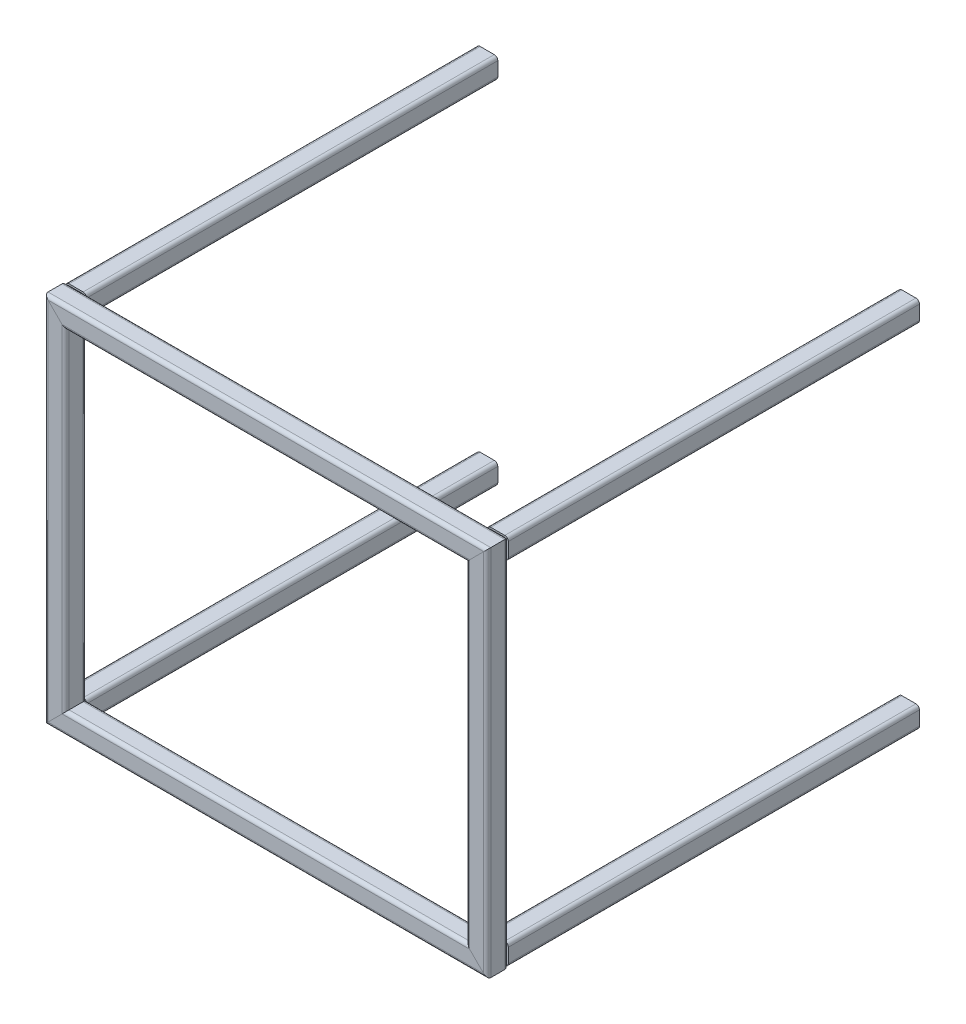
ISO-10303-21;
HEADER;
FILE_DESCRIPTION(('STEP AP214'),'2;1');
FILE_NAME('part.step','',(''),(''),'','','');
FILE_SCHEMA(('AUTOMOTIVE_DESIGN { 1 0 10303 214 1 1 1 1 }'));
ENDSEC;
DATA;
#1=APPLICATION_CONTEXT('core data for automotive mechanical design processes');
#2=APPLICATION_PROTOCOL_DEFINITION('international standard','automotive_design',2000,#1);
#3=PRODUCT_CONTEXT('',#1,'mechanical');
#4=PRODUCT('Part','Part','',(#3));
#5=PRODUCT_RELATED_PRODUCT_CATEGORY('part','',(#4));
#6=PRODUCT_DEFINITION_FORMATION('','',#4);
#7=PRODUCT_DEFINITION_CONTEXT('part definition',#1,'design');
#8=PRODUCT_DEFINITION('design','',#6,#7);
#9=PRODUCT_DEFINITION_SHAPE('','',#8);
#10=(LENGTH_UNIT() NAMED_UNIT(*) SI_UNIT(.MILLI.,.METRE.));
#11=(NAMED_UNIT(*) PLANE_ANGLE_UNIT() SI_UNIT($,.RADIAN.));
#12=(NAMED_UNIT(*) SI_UNIT($,.STERADIAN.) SOLID_ANGLE_UNIT());
#13=UNCERTAINTY_MEASURE_WITH_UNIT(LENGTH_MEASURE(1.E-05),#10,'distance_accuracy_value','');
#14=(GEOMETRIC_REPRESENTATION_CONTEXT(3) GLOBAL_UNCERTAINTY_ASSIGNED_CONTEXT((#13)) GLOBAL_UNIT_ASSIGNED_CONTEXT((#10,
#11,#12)) REPRESENTATION_CONTEXT('',''));
#15=CARTESIAN_POINT('',(0.,0.,0.));
#16=DIRECTION('',(0.,0.,1.));
#17=DIRECTION('',(1.,0.,0.));
#18=AXIS2_PLACEMENT_3D('',#15,#16,#17);
#19=CARTESIAN_POINT('',(787.4,660.4,-1524.));
#20=DIRECTION('',(0.,0.,1.));
#21=DIRECTION('',(1.,0.,0.));
#22=AXIS2_PLACEMENT_3D('',#19,#20,#21);
#23=CYLINDRICAL_SURFACE('',#22,6.35000000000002);
#24=CARTESIAN_POINT('',(787.4,660.4,-38.1));
#25=DIRECTION('',(0.,0.,-1.));
#26=DIRECTION('',(-1.,0.,0.));
#27=AXIS2_PLACEMENT_3D('',#24,#25,#26);
#28=CIRCLE('',#27,6.35000000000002);
#29=CARTESIAN_POINT('',(787.4,666.75,-38.1));
#30=VERTEX_POINT('',#29);
#31=CARTESIAN_POINT('',(793.75,660.4,-38.1));
#32=VERTEX_POINT('',#31);
#33=EDGE_CURVE('E13',#30,#32,#28,.T.);
#34=ORIENTED_EDGE('',*,*,#33,.F.);
#35=DIRECTION('',(0.,0.,1.));
#36=VECTOR('',#35,1.);
#37=CARTESIAN_POINT('',(787.4,666.75,-1524.));
#38=LINE('',#37,#36);
#39=CARTESIAN_POINT('',(787.4,666.75,-1524.));
#40=VERTEX_POINT('',#39);
#41=EDGE_CURVE('E166',#40,#30,#38,.T.);
#42=ORIENTED_EDGE('',*,*,#41,.F.);
#43=CARTESIAN_POINT('',(787.4,660.4,-1524.));
#44=DIRECTION('',(0.,0.,-1.));
#45=DIRECTION('',(-1.,0.,0.));
#46=AXIS2_PLACEMENT_3D('',#43,#44,#45);
#47=CIRCLE('',#46,6.35000000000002);
#48=CARTESIAN_POINT('',(793.75,660.4,-1524.));
#49=VERTEX_POINT('',#48);
#50=EDGE_CURVE('E169',#40,#49,#47,.T.);
#51=ORIENTED_EDGE('',*,*,#50,.T.);
#52=DIRECTION('',(0.,0.,1.));
#53=VECTOR('',#52,1.);
#54=CARTESIAN_POINT('',(793.75,660.4,-1524.));
#55=LINE('',#54,#53);
#56=EDGE_CURVE('E224',#49,#32,#55,.T.);
#57=ORIENTED_EDGE('',*,*,#56,.T.);
#58=EDGE_LOOP('',(#34,#42,#51,#57));
#59=FACE_BOUND('',#58,.T.);
#60=ADVANCED_FACE('F57',(#59),#23,.F.);
#61=CARTESIAN_POINT('',(736.6,666.75,-1524.));
#62=DIRECTION('',(0.,-1.,0.));
#63=DIRECTION('',(0.,0.,-1.));
#64=AXIS2_PLACEMENT_3D('',#61,#62,#63);
#65=PLANE('',#64);
#66=DIRECTION('',(1.,0.,0.));
#67=VECTOR('',#66,1.);
#68=CARTESIAN_POINT('',(736.6,666.75,-38.1));
#69=LINE('',#68,#67);
#70=CARTESIAN_POINT('',(736.6,666.75,-38.1));
#71=VERTEX_POINT('',#70);
#72=EDGE_CURVE('E300',#71,#30,#69,.T.);
#73=ORIENTED_EDGE('',*,*,#72,.F.);
#74=DIRECTION('',(0.,0.,1.));
#75=VECTOR('',#74,1.);
#76=CARTESIAN_POINT('',(736.6,666.75,-1524.));
#77=LINE('',#76,#75);
#78=CARTESIAN_POINT('',(736.6,666.75,-1524.));
#79=VERTEX_POINT('',#78);
#80=EDGE_CURVE('E175',#79,#71,#77,.T.);
#81=ORIENTED_EDGE('',*,*,#80,.F.);
#82=DIRECTION('',(1.,0.,0.));
#83=VECTOR('',#82,1.);
#84=CARTESIAN_POINT('',(736.6,666.75,-1524.));
#85=LINE('',#84,#83);
#86=EDGE_CURVE('E181',#79,#40,#85,.T.);
#87=ORIENTED_EDGE('',*,*,#86,.T.);
#88=ORIENTED_EDGE('',*,*,#41,.T.);
#89=EDGE_LOOP('',(#73,#81,#87,#88));
#90=FACE_BOUND('',#89,.T.);
#91=ADVANCED_FACE('F187',(#90),#65,.T.);
#92=CARTESIAN_POINT('',(736.6,660.4,-1524.));
#93=DIRECTION('',(0.,0.,1.));
#94=DIRECTION('',(1.,0.,0.));
#95=AXIS2_PLACEMENT_3D('',#92,#93,#94);
#96=CYLINDRICAL_SURFACE('',#95,6.35000000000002);
#97=CARTESIAN_POINT('',(736.6,660.4,-38.1));
#98=DIRECTION('',(0.,0.,-1.));
#99=DIRECTION('',(-1.,0.,0.));
#100=AXIS2_PLACEMENT_3D('',#97,#98,#99);
#101=CIRCLE('',#100,6.35000000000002);
#102=CARTESIAN_POINT('',(730.25,660.4,-38.1));
#103=VERTEX_POINT('',#102);
#104=EDGE_CURVE('E266',#103,#71,#101,.T.);
#105=ORIENTED_EDGE('',*,*,#104,.F.);
#106=DIRECTION('',(0.,0.,1.));
#107=VECTOR('',#106,1.);
#108=CARTESIAN_POINT('',(730.25,660.4,-1524.));
#109=LINE('',#108,#107);
#110=CARTESIAN_POINT('',(730.25,660.4,-1524.));
#111=VERTEX_POINT('',#110);
#112=EDGE_CURVE('E260',#111,#103,#109,.T.);
#113=ORIENTED_EDGE('',*,*,#112,.F.);
#114=CARTESIAN_POINT('',(736.6,660.4,-1524.));
#115=DIRECTION('',(0.,0.,-1.));
#116=DIRECTION('',(-1.,0.,0.));
#117=AXIS2_PLACEMENT_3D('',#114,#115,#116);
#118=CIRCLE('',#117,6.35000000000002);
#119=EDGE_CURVE('E189',#111,#79,#118,.T.);
#120=ORIENTED_EDGE('',*,*,#119,.T.);
#121=ORIENTED_EDGE('',*,*,#80,.T.);
#122=EDGE_LOOP('',(#105,#113,#120,#121));
#123=FACE_BOUND('',#122,.T.);
#124=ADVANCED_FACE('F265',(#123),#96,.F.);
#125=CARTESIAN_POINT('',(730.25,660.4,-1524.));
#126=DIRECTION('',(1.,0.,0.));
#127=DIRECTION('',(0.,0.,-1.));
#128=AXIS2_PLACEMENT_3D('',#125,#126,#127);
#129=PLANE('',#128);
#130=DIRECTION('',(0.,1.,0.));
#131=VECTOR('',#130,1.);
#132=CARTESIAN_POINT('',(730.25,660.4,-38.1));
#133=LINE('',#132,#131);
#134=CARTESIAN_POINT('',(730.25,609.6,-38.1));
#135=VERTEX_POINT('',#134);
#136=EDGE_CURVE('E272',#135,#103,#133,.T.);
#137=ORIENTED_EDGE('',*,*,#136,.F.);
#138=DIRECTION('',(0.,0.,1.));
#139=VECTOR('',#138,1.);
#140=CARTESIAN_POINT('',(730.25,609.6,-1524.));
#141=LINE('',#140,#139);
#142=CARTESIAN_POINT('',(730.25,609.6,-1524.));
#143=VERTEX_POINT('',#142);
#144=EDGE_CURVE('E257',#143,#135,#141,.T.);
#145=ORIENTED_EDGE('',*,*,#144,.F.);
#146=DIRECTION('',(0.,1.,0.));
#147=VECTOR('',#146,1.);
#148=CARTESIAN_POINT('',(730.25,660.4,-1524.));
#149=LINE('',#148,#147);
#150=EDGE_CURVE('E191',#143,#111,#149,.T.);
#151=ORIENTED_EDGE('',*,*,#150,.T.);
#152=ORIENTED_EDGE('',*,*,#112,.T.);
#153=EDGE_LOOP('',(#137,#145,#151,#152));
#154=FACE_BOUND('',#153,.T.);
#155=ADVANCED_FACE('F271',(#154),#129,.T.);
#156=CARTESIAN_POINT('',(736.6,609.6,-1524.));
#157=DIRECTION('',(0.,0.,1.));
#158=DIRECTION('',(1.,0.,0.));
#159=AXIS2_PLACEMENT_3D('',#156,#157,#158);
#160=CYLINDRICAL_SURFACE('',#159,6.35000000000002);
#161=CARTESIAN_POINT('',(736.6,609.6,-38.1));
#162=DIRECTION('',(0.,0.,-1.));
#163=DIRECTION('',(-1.,0.,0.));
#164=AXIS2_PLACEMENT_3D('',#161,#162,#163);
#165=CIRCLE('',#164,6.35000000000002);
#166=CARTESIAN_POINT('',(736.6,603.25,-38.1));
#167=VERTEX_POINT('',#166);
#168=EDGE_CURVE('E276',#167,#135,#165,.T.);
#169=ORIENTED_EDGE('',*,*,#168,.F.);
#170=DIRECTION('',(0.,0.,1.));
#171=VECTOR('',#170,1.);
#172=CARTESIAN_POINT('',(736.6,603.25,-1524.));
#173=LINE('',#172,#171);
#174=CARTESIAN_POINT('',(736.6,603.25,-1524.));
#175=VERTEX_POINT('',#174);
#176=EDGE_CURVE('E254',#175,#167,#173,.T.);
#177=ORIENTED_EDGE('',*,*,#176,.F.);
#178=CARTESIAN_POINT('',(736.6,609.6,-1524.));
#179=DIRECTION('',(0.,0.,-1.));
#180=DIRECTION('',(-1.,0.,0.));
#181=AXIS2_PLACEMENT_3D('',#178,#179,#180);
#182=CIRCLE('',#181,6.35000000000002);
#183=EDGE_CURVE('E197',#175,#143,#182,.T.);
#184=ORIENTED_EDGE('',*,*,#183,.T.);
#185=ORIENTED_EDGE('',*,*,#144,.T.);
#186=EDGE_LOOP('',(#169,#177,#184,#185));
#187=FACE_BOUND('',#186,.T.);
#188=ADVANCED_FACE('F275',(#187),#160,.F.);
#189=CARTESIAN_POINT('',(787.4,603.25,-1524.));
#190=DIRECTION('',(0.,1.,0.));
#191=DIRECTION('',(0.,0.,1.));
#192=AXIS2_PLACEMENT_3D('',#189,#190,#191);
#193=PLANE('',#192);
#194=DIRECTION('',(-1.,0.,0.));
#195=VECTOR('',#194,1.);
#196=CARTESIAN_POINT('',(787.4,603.25,-38.1));
#197=LINE('',#196,#195);
#198=CARTESIAN_POINT('',(787.4,603.25,-38.1));
#199=VERTEX_POINT('',#198);
#200=EDGE_CURVE('E281',#199,#167,#197,.T.);
#201=ORIENTED_EDGE('',*,*,#200,.F.);
#202=DIRECTION('',(0.,0.,1.));
#203=VECTOR('',#202,1.);
#204=CARTESIAN_POINT('',(787.4,603.25,-1524.));
#205=LINE('',#204,#203);
#206=CARTESIAN_POINT('',(787.4,603.25,-1524.));
#207=VERTEX_POINT('',#206);
#208=EDGE_CURVE('E251',#207,#199,#205,.T.);
#209=ORIENTED_EDGE('',*,*,#208,.F.);
#210=DIRECTION('',(-1.,0.,0.));
#211=VECTOR('',#210,1.);
#212=CARTESIAN_POINT('',(787.4,603.25,-1524.));
#213=LINE('',#212,#211);
#214=EDGE_CURVE('E200',#207,#175,#213,.T.);
#215=ORIENTED_EDGE('',*,*,#214,.T.);
#216=ORIENTED_EDGE('',*,*,#176,.T.);
#217=EDGE_LOOP('',(#201,#209,#215,#216));
#218=FACE_BOUND('',#217,.T.);
#219=ADVANCED_FACE('F280',(#218),#193,.T.);
#220=CARTESIAN_POINT('',(787.4,609.6,-1524.));
#221=DIRECTION('',(0.,0.,1.));
#222=DIRECTION('',(1.,0.,0.));
#223=AXIS2_PLACEMENT_3D('',#220,#221,#222);
#224=CYLINDRICAL_SURFACE('',#223,6.35000000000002);
#225=CARTESIAN_POINT('',(787.4,609.6,-38.1));
#226=DIRECTION('',(0.,0.,-1.));
#227=DIRECTION('',(-1.,0.,0.));
#228=AXIS2_PLACEMENT_3D('',#225,#226,#227);
#229=CIRCLE('',#228,6.35000000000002);
#230=CARTESIAN_POINT('',(793.75,609.6,-38.1));
#231=VERTEX_POINT('',#230);
#232=EDGE_CURVE('E285',#231,#199,#229,.T.);
#233=ORIENTED_EDGE('',*,*,#232,.F.);
#234=DIRECTION('',(0.,0.,1.));
#235=VECTOR('',#234,1.);
#236=CARTESIAN_POINT('',(793.75,609.6,-1524.));
#237=LINE('',#236,#235);
#238=CARTESIAN_POINT('',(793.75,609.6,-1524.));
#239=VERTEX_POINT('',#238);
#240=EDGE_CURVE('E248',#239,#231,#237,.T.);
#241=ORIENTED_EDGE('',*,*,#240,.F.);
#242=CARTESIAN_POINT('',(787.4,609.6,-1524.));
#243=DIRECTION('',(0.,0.,-1.));
#244=DIRECTION('',(-1.,0.,0.));
#245=AXIS2_PLACEMENT_3D('',#242,#243,#244);
#246=CIRCLE('',#245,6.35000000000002);
#247=EDGE_CURVE('E203',#239,#207,#246,.T.);
#248=ORIENTED_EDGE('',*,*,#247,.T.);
#249=ORIENTED_EDGE('',*,*,#208,.T.);
#250=EDGE_LOOP('',(#233,#241,#248,#249));
#251=FACE_BOUND('',#250,.T.);
#252=ADVANCED_FACE('F284',(#251),#224,.F.);
#253=CARTESIAN_POINT('',(793.75,609.6,-1524.));
#254=DIRECTION('',(-1.,0.,0.));
#255=DIRECTION('',(0.,0.,1.));
#256=AXIS2_PLACEMENT_3D('',#253,#254,#255);
#257=PLANE('',#256);
#258=DIRECTION('',(0.,-1.,0.));
#259=VECTOR('',#258,1.);
#260=CARTESIAN_POINT('',(793.75,609.6,-38.1));
#261=LINE('',#260,#259);
#262=EDGE_CURVE('E289',#32,#231,#261,.T.);
#263=ORIENTED_EDGE('',*,*,#262,.F.);
#264=ORIENTED_EDGE('',*,*,#56,.F.);
#265=DIRECTION('',(0.,-1.,0.));
#266=VECTOR('',#265,1.);
#267=CARTESIAN_POINT('',(793.75,609.6,-1524.));
#268=LINE('',#267,#266);
#269=EDGE_CURVE('E185',#49,#239,#268,.T.);
#270=ORIENTED_EDGE('',*,*,#269,.T.);
#271=ORIENTED_EDGE('',*,*,#240,.T.);
#272=EDGE_LOOP('',(#263,#264,#270,#271));
#273=FACE_BOUND('',#272,.T.);
#274=ADVANCED_FACE('F288',(#273),#257,.T.);
#275=CARTESIAN_POINT('',(736.6,660.4,-1524.));
#276=DIRECTION('',(0.,0.,-1.));
#277=DIRECTION('',(-1.,0.,0.));
#278=AXIS2_PLACEMENT_3D('',#275,#276,#277);
#279=PLANE('',#278);
#280=ORIENTED_EDGE('',*,*,#50,.F.);
#281=ORIENTED_EDGE('',*,*,#86,.F.);
#282=ORIENTED_EDGE('',*,*,#119,.F.);
#283=ORIENTED_EDGE('',*,*,#150,.F.);
#284=ORIENTED_EDGE('',*,*,#183,.F.);
#285=ORIENTED_EDGE('',*,*,#214,.F.);
#286=ORIENTED_EDGE('',*,*,#247,.F.);
#287=ORIENTED_EDGE('',*,*,#269,.F.);
#288=EDGE_LOOP('',(#280,#281,#282,#283,#284,#285,#286,#287));
#289=FACE_BOUND('',#288,.T.);
#290=CARTESIAN_POINT('',(736.6,660.4,-1524.));
#291=DIRECTION('',(0.,0.,-1.));
#292=DIRECTION('',(-1.,0.,0.));
#293=AXIS2_PLACEMENT_3D('',#290,#291,#292);
#294=CIRCLE('',#293,12.7);
#295=CARTESIAN_POINT('',(723.9,660.4,-1524.));
#296=VERTEX_POINT('',#295);
#297=CARTESIAN_POINT('',(736.6,673.1,-1524.));
#298=VERTEX_POINT('',#297);
#299=EDGE_CURVE('E207',#296,#298,#294,.T.);
#300=ORIENTED_EDGE('',*,*,#299,.T.);
#301=DIRECTION('',(1.,0.,0.));
#302=VECTOR('',#301,1.);
#303=CARTESIAN_POINT('',(736.6,673.1,-1524.));
#304=LINE('',#303,#302);
#305=CARTESIAN_POINT('',(787.4,673.1,-1524.));
#306=VERTEX_POINT('',#305);
#307=EDGE_CURVE('E210',#298,#306,#304,.T.);
#308=ORIENTED_EDGE('',*,*,#307,.T.);
#309=CARTESIAN_POINT('',(787.4,660.4,-1524.));
#310=DIRECTION('',(0.,0.,-1.));
#311=DIRECTION('',(-1.,0.,0.));
#312=AXIS2_PLACEMENT_3D('',#309,#310,#311);
#313=CIRCLE('',#312,12.7);
#314=CARTESIAN_POINT('',(800.1,660.4,-1524.));
#315=VERTEX_POINT('',#314);
#316=EDGE_CURVE('E212',#306,#315,#313,.T.);
#317=ORIENTED_EDGE('',*,*,#316,.T.);
#318=DIRECTION('',(0.,-1.,0.));
#319=VECTOR('',#318,1.);
#320=CARTESIAN_POINT('',(800.1,609.6,-1524.));
#321=LINE('',#320,#319);
#322=CARTESIAN_POINT('',(800.1,609.6,-1524.));
#323=VERTEX_POINT('',#322);
#324=EDGE_CURVE('E214',#315,#323,#321,.T.);
#325=ORIENTED_EDGE('',*,*,#324,.T.);
#326=CARTESIAN_POINT('',(787.4,609.6,-1524.));
#327=DIRECTION('',(0.,0.,-1.));
#328=DIRECTION('',(-1.,0.,0.));
#329=AXIS2_PLACEMENT_3D('',#326,#327,#328);
#330=CIRCLE('',#329,12.7);
#331=CARTESIAN_POINT('',(787.4,596.9,-1524.));
#332=VERTEX_POINT('',#331);
#333=EDGE_CURVE('E216',#323,#332,#330,.T.);
#334=ORIENTED_EDGE('',*,*,#333,.T.);
#335=DIRECTION('',(-1.,0.,0.));
#336=VECTOR('',#335,1.);
#337=CARTESIAN_POINT('',(787.4,596.9,-1524.));
#338=LINE('',#337,#336);
#339=CARTESIAN_POINT('',(736.6,596.9,-1524.));
#340=VERTEX_POINT('',#339);
#341=EDGE_CURVE('E218',#332,#340,#338,.T.);
#342=ORIENTED_EDGE('',*,*,#341,.T.);
#343=CARTESIAN_POINT('',(736.6,609.6,-1524.));
#344=DIRECTION('',(0.,0.,-1.));
#345=DIRECTION('',(-1.,0.,0.));
#346=AXIS2_PLACEMENT_3D('',#343,#344,#345);
#347=CIRCLE('',#346,12.7);
#348=CARTESIAN_POINT('',(723.9,609.6,-1524.));
#349=VERTEX_POINT('',#348);
#350=EDGE_CURVE('E220',#340,#349,#347,.T.);
#351=ORIENTED_EDGE('',*,*,#350,.T.);
#352=DIRECTION('',(0.,1.,0.));
#353=VECTOR('',#352,1.);
#354=CARTESIAN_POINT('',(723.9,660.4,-1524.));
#355=LINE('',#354,#353);
#356=EDGE_CURVE('E222',#349,#296,#355,.T.);
#357=ORIENTED_EDGE('',*,*,#356,.T.);
#358=EDGE_LOOP('',(#300,#308,#317,#325,#334,#342,#351,#357));
#359=FACE_BOUND('',#358,.T.);
#360=ADVANCED_FACE('F178',(#289,#359),#279,.T.);
#361=CARTESIAN_POINT('',(736.6,660.4,-1524.));
#362=DIRECTION('',(0.,0.,1.));
#363=DIRECTION('',(1.,0.,0.));
#364=AXIS2_PLACEMENT_3D('',#361,#362,#363);
#365=CYLINDRICAL_SURFACE('',#364,12.7);
#366=DIRECTION('',(0.,0.,1.));
#367=VECTOR('',#366,1.);
#368=CARTESIAN_POINT('',(723.9,660.4,-1524.));
#369=LINE('',#368,#367);
#370=CARTESIAN_POINT('',(723.9,660.4,-38.1));
#371=VERTEX_POINT('',#370);
#372=EDGE_CURVE('E174',#296,#371,#369,.T.);
#373=ORIENTED_EDGE('',*,*,#372,.T.);
#374=CARTESIAN_POINT('',(736.6,660.4,-38.1));
#375=DIRECTION('',(0.,0.,-1.));
#376=DIRECTION('',(-1.,0.,0.));
#377=AXIS2_PLACEMENT_3D('',#374,#375,#376);
#378=CIRCLE('',#377,12.7);
#379=CARTESIAN_POINT('',(736.6,673.1,-38.1));
#380=VERTEX_POINT('',#379);
#381=EDGE_CURVE('E60',#371,#380,#378,.T.);
#382=ORIENTED_EDGE('',*,*,#381,.T.);
#383=DIRECTION('',(0.,0.,1.));
#384=VECTOR('',#383,1.);
#385=CARTESIAN_POINT('',(736.6,673.1,-1524.));
#386=LINE('',#385,#384);
#387=EDGE_CURVE('E244',#298,#380,#386,.T.);
#388=ORIENTED_EDGE('',*,*,#387,.F.);
#389=ORIENTED_EDGE('',*,*,#299,.F.);
#390=EDGE_LOOP('',(#373,#382,#388,#389));
#391=FACE_BOUND('',#390,.T.);
#392=ADVANCED_FACE('F335',(#391),#365,.T.);
#393=CARTESIAN_POINT('',(736.6,673.1,-1524.));
#394=DIRECTION('',(0.,-1.,0.));
#395=DIRECTION('',(0.,0.,-1.));
#396=AXIS2_PLACEMENT_3D('',#393,#394,#395);
#397=PLANE('',#396);
#398=ORIENTED_EDGE('',*,*,#387,.T.);
#399=DIRECTION('',(1.,0.,0.));
#400=VECTOR('',#399,1.);
#401=CARTESIAN_POINT('',(736.6,673.1,-38.1));
#402=LINE('',#401,#400);
#403=CARTESIAN_POINT('',(787.4,673.1,-38.1));
#404=VERTEX_POINT('',#403);
#405=EDGE_CURVE('E291',#380,#404,#402,.T.);
#406=ORIENTED_EDGE('',*,*,#405,.T.);
#407=DIRECTION('',(0.,0.,1.));
#408=VECTOR('',#407,1.);
#409=CARTESIAN_POINT('',(787.4,673.1,-1524.));
#410=LINE('',#409,#408);
#411=EDGE_CURVE('E242',#306,#404,#410,.T.);
#412=ORIENTED_EDGE('',*,*,#411,.F.);
#413=ORIENTED_EDGE('',*,*,#307,.F.);
#414=EDGE_LOOP('',(#398,#406,#412,#413));
#415=FACE_BOUND('',#414,.T.);
#416=ADVANCED_FACE('F323',(#415),#397,.F.);
#417=CARTESIAN_POINT('',(787.4,660.4,-1524.));
#418=DIRECTION('',(0.,0.,1.));
#419=DIRECTION('',(1.,0.,0.));
#420=AXIS2_PLACEMENT_3D('',#417,#418,#419);
#421=CYLINDRICAL_SURFACE('',#420,12.7);
#422=ORIENTED_EDGE('',*,*,#411,.T.);
#423=CARTESIAN_POINT('',(787.4,660.4,-38.1));
#424=DIRECTION('',(0.,0.,-1.));
#425=DIRECTION('',(-1.,0.,0.));
#426=AXIS2_PLACEMENT_3D('',#423,#424,#425);
#427=CIRCLE('',#426,12.7);
#428=CARTESIAN_POINT('',(800.1,660.4,-38.1));
#429=VERTEX_POINT('',#428);
#430=EDGE_CURVE('E74',#404,#429,#427,.T.);
#431=ORIENTED_EDGE('',*,*,#430,.T.);
#432=DIRECTION('',(0.,0.,1.));
#433=VECTOR('',#432,1.);
#434=CARTESIAN_POINT('',(800.1,660.4,-1524.));
#435=LINE('',#434,#433);
#436=EDGE_CURVE('E239',#315,#429,#435,.T.);
#437=ORIENTED_EDGE('',*,*,#436,.F.);
#438=ORIENTED_EDGE('',*,*,#316,.F.);
#439=EDGE_LOOP('',(#422,#431,#437,#438));
#440=FACE_BOUND('',#439,.T.);
#441=ADVANCED_FACE('F318',(#440),#421,.T.);
#442=CARTESIAN_POINT('',(800.1,609.6,-1524.));
#443=DIRECTION('',(-1.,0.,0.));
#444=DIRECTION('',(0.,0.,1.));
#445=AXIS2_PLACEMENT_3D('',#442,#443,#444);
#446=PLANE('',#445);
#447=ORIENTED_EDGE('',*,*,#436,.T.);
#448=DIRECTION('',(0.,-1.,0.));
#449=VECTOR('',#448,1.);
#450=CARTESIAN_POINT('',(800.1,609.6,-38.1));
#451=LINE('',#450,#449);
#452=CARTESIAN_POINT('',(800.1,609.6,-38.1));
#453=VERTEX_POINT('',#452);
#454=EDGE_CURVE('E313',#429,#453,#451,.T.);
#455=ORIENTED_EDGE('',*,*,#454,.T.);
#456=DIRECTION('',(0.,0.,1.));
#457=VECTOR('',#456,1.);
#458=CARTESIAN_POINT('',(800.1,609.6,-1524.));
#459=LINE('',#458,#457);
#460=EDGE_CURVE('E236',#323,#453,#459,.T.);
#461=ORIENTED_EDGE('',*,*,#460,.F.);
#462=ORIENTED_EDGE('',*,*,#324,.F.);
#463=EDGE_LOOP('',(#447,#455,#461,#462));
#464=FACE_BOUND('',#463,.T.);
#465=ADVANCED_FACE('F349',(#464),#446,.F.);
#466=CARTESIAN_POINT('',(787.4,609.6,-1524.));
#467=DIRECTION('',(0.,0.,1.));
#468=DIRECTION('',(1.,0.,0.));
#469=AXIS2_PLACEMENT_3D('',#466,#467,#468);
#470=CYLINDRICAL_SURFACE('',#469,12.7);
#471=ORIENTED_EDGE('',*,*,#460,.T.);
#472=CARTESIAN_POINT('',(787.4,609.6,-38.1));
#473=DIRECTION('',(0.,0.,-1.));
#474=DIRECTION('',(-1.,0.,0.));
#475=AXIS2_PLACEMENT_3D('',#472,#473,#474);
#476=CIRCLE('',#475,12.7);
#477=CARTESIAN_POINT('',(787.4,596.9,-38.1));
#478=VERTEX_POINT('',#477);
#479=EDGE_CURVE('E310',#453,#478,#476,.T.);
#480=ORIENTED_EDGE('',*,*,#479,.T.);
#481=DIRECTION('',(0.,0.,1.));
#482=VECTOR('',#481,1.);
#483=CARTESIAN_POINT('',(787.4,596.9,-1524.));
#484=LINE('',#483,#482);
#485=EDGE_CURVE('E233',#332,#478,#484,.T.);
#486=ORIENTED_EDGE('',*,*,#485,.F.);
#487=ORIENTED_EDGE('',*,*,#333,.F.);
#488=EDGE_LOOP('',(#471,#480,#486,#487));
#489=FACE_BOUND('',#488,.T.);
#490=ADVANCED_FACE('F346',(#489),#470,.T.);
#491=CARTESIAN_POINT('',(787.4,596.9,-1524.));
#492=DIRECTION('',(0.,1.,0.));
#493=DIRECTION('',(0.,0.,1.));
#494=AXIS2_PLACEMENT_3D('',#491,#492,#493);
#495=PLANE('',#494);
#496=ORIENTED_EDGE('',*,*,#485,.T.);
#497=DIRECTION('',(-1.,0.,0.));
#498=VECTOR('',#497,1.);
#499=CARTESIAN_POINT('',(787.4,596.9,-38.1));
#500=LINE('',#499,#498);
#501=CARTESIAN_POINT('',(736.6,596.9,-38.1));
#502=VERTEX_POINT('',#501);
#503=EDGE_CURVE('E307',#478,#502,#500,.T.);
#504=ORIENTED_EDGE('',*,*,#503,.T.);
#505=DIRECTION('',(0.,0.,1.));
#506=VECTOR('',#505,1.);
#507=CARTESIAN_POINT('',(736.6,596.9,-1524.));
#508=LINE('',#507,#506);
#509=EDGE_CURVE('E230',#340,#502,#508,.T.);
#510=ORIENTED_EDGE('',*,*,#509,.F.);
#511=ORIENTED_EDGE('',*,*,#341,.F.);
#512=EDGE_LOOP('',(#496,#504,#510,#511));
#513=FACE_BOUND('',#512,.T.);
#514=ADVANCED_FACE('F343',(#513),#495,.F.);
#515=CARTESIAN_POINT('',(736.6,609.6,-1524.));
#516=DIRECTION('',(0.,0.,1.));
#517=DIRECTION('',(1.,0.,0.));
#518=AXIS2_PLACEMENT_3D('',#515,#516,#517);
#519=CYLINDRICAL_SURFACE('',#518,12.7);
#520=ORIENTED_EDGE('',*,*,#509,.T.);
#521=CARTESIAN_POINT('',(736.6,609.6,-38.1));
#522=DIRECTION('',(0.,0.,-1.));
#523=DIRECTION('',(-1.,0.,0.));
#524=AXIS2_PLACEMENT_3D('',#521,#522,#523);
#525=CIRCLE('',#524,12.7);
#526=CARTESIAN_POINT('',(723.9,609.6,-38.1));
#527=VERTEX_POINT('',#526);
#528=EDGE_CURVE('E304',#502,#527,#525,.T.);
#529=ORIENTED_EDGE('',*,*,#528,.T.);
#530=DIRECTION('',(0.,0.,1.));
#531=VECTOR('',#530,1.);
#532=CARTESIAN_POINT('',(723.9,609.6,-1524.));
#533=LINE('',#532,#531);
#534=EDGE_CURVE('E227',#349,#527,#533,.T.);
#535=ORIENTED_EDGE('',*,*,#534,.F.);
#536=ORIENTED_EDGE('',*,*,#350,.F.);
#537=EDGE_LOOP('',(#520,#529,#535,#536));
#538=FACE_BOUND('',#537,.T.);
#539=ADVANCED_FACE('F340',(#538),#519,.T.);
#540=CARTESIAN_POINT('',(723.9,660.4,-1524.));
#541=DIRECTION('',(1.,0.,0.));
#542=DIRECTION('',(0.,0.,-1.));
#543=AXIS2_PLACEMENT_3D('',#540,#541,#542);
#544=PLANE('',#543);
#545=ORIENTED_EDGE('',*,*,#534,.T.);
#546=DIRECTION('',(0.,1.,0.));
#547=VECTOR('',#546,1.);
#548=CARTESIAN_POINT('',(723.9,660.4,-38.1));
#549=LINE('',#548,#547);
#550=EDGE_CURVE('E66',#527,#371,#549,.T.);
#551=ORIENTED_EDGE('',*,*,#550,.T.);
#552=ORIENTED_EDGE('',*,*,#372,.F.);
#553=ORIENTED_EDGE('',*,*,#356,.F.);
#554=EDGE_LOOP('',(#545,#551,#552,#553));
#555=FACE_BOUND('',#554,.T.);
#556=ADVANCED_FACE('F331',(#555),#544,.F.);
#557=CARTESIAN_POINT('',(-749.3,647.7,-38.1));
#558=DIRECTION('',(0.,0.,-1.));
#559=DIRECTION('',(-1.,0.,0.));
#560=AXIS2_PLACEMENT_3D('',#557,#558,#559);
#561=PLANE('',#560);
#562=ORIENTED_EDGE('',*,*,#262,.T.);
#563=ORIENTED_EDGE('',*,*,#232,.T.);
#564=ORIENTED_EDGE('',*,*,#200,.T.);
#565=ORIENTED_EDGE('',*,*,#168,.T.);
#566=ORIENTED_EDGE('',*,*,#136,.T.);
#567=ORIENTED_EDGE('',*,*,#104,.T.);
#568=ORIENTED_EDGE('',*,*,#72,.T.);
#569=ORIENTED_EDGE('',*,*,#33,.T.);
#570=EDGE_LOOP('',(#562,#563,#564,#565,#566,#567,#568,#569));
#571=FACE_BOUND('',#570,.T.);
#572=ORIENTED_EDGE('',*,*,#528,.F.);
#573=ORIENTED_EDGE('',*,*,#503,.F.);
#574=ORIENTED_EDGE('',*,*,#479,.F.);
#575=ORIENTED_EDGE('',*,*,#454,.F.);
#576=ORIENTED_EDGE('',*,*,#430,.F.);
#577=ORIENTED_EDGE('',*,*,#405,.F.);
#578=ORIENTED_EDGE('',*,*,#381,.F.);
#579=ORIENTED_EDGE('',*,*,#550,.F.);
#580=EDGE_LOOP('',(#572,#573,#574,#575,#576,#577,#578,#579));
#581=FACE_BOUND('',#580,.T.);
#582=ADVANCED_FACE('F327',(#571,#581),#561,.F.);
#583=CLOSED_SHELL('',(#60,#91,#124,#155,#188,#219,#252,#274,#360,#392,#416,#441,#465,#490,#514,
#539,#556,#582));
#584=MANIFOLD_SOLID_BREP('B2',#583);
#585=CARTESIAN_POINT('',(-736.6,660.4,-1524.));
#586=DIRECTION('',(0.,0.,1.));
#587=DIRECTION('',(1.,0.,0.));
#588=AXIS2_PLACEMENT_3D('',#585,#586,#587);
#589=CYLINDRICAL_SURFACE('',#588,6.35000000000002);
#590=CARTESIAN_POINT('',(-736.6,660.4,-38.1));
#591=DIRECTION('',(0.,0.,-1.));
#592=DIRECTION('',(-1.,0.,0.));
#593=AXIS2_PLACEMENT_3D('',#590,#591,#592);
#594=CIRCLE('',#593,6.35000000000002);
#595=CARTESIAN_POINT('',(-736.6,666.75,-38.1));
#596=VERTEX_POINT('',#595);
#597=CARTESIAN_POINT('',(-730.25,660.4,-38.1));
#598=VERTEX_POINT('',#597);
#599=EDGE_CURVE('E55',#596,#598,#594,.T.);
#600=ORIENTED_EDGE('',*,*,#599,.F.);
#601=DIRECTION('',(0.,0.,1.));
#602=VECTOR('',#601,1.);
#603=CARTESIAN_POINT('',(-736.6,666.75,-1524.));
#604=LINE('',#603,#602);
#605=CARTESIAN_POINT('',(-736.6,666.75,-1524.));
#606=VERTEX_POINT('',#605);
#607=EDGE_CURVE('E613',#606,#596,#604,.T.);
#608=ORIENTED_EDGE('',*,*,#607,.F.);
#609=CARTESIAN_POINT('',(-736.6,660.4,-1524.));
#610=DIRECTION('',(0.,0.,-1.));
#611=DIRECTION('',(-1.,0.,0.));
#612=AXIS2_PLACEMENT_3D('',#609,#610,#611);
#613=CIRCLE('',#612,6.35000000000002);
#614=CARTESIAN_POINT('',(-730.25,660.4,-1524.));
#615=VERTEX_POINT('',#614);
#616=EDGE_CURVE('E616',#606,#615,#613,.T.);
#617=ORIENTED_EDGE('',*,*,#616,.T.);
#618=DIRECTION('',(0.,0.,1.));
#619=VECTOR('',#618,1.);
#620=CARTESIAN_POINT('',(-730.25,660.4,-1524.));
#621=LINE('',#620,#619);
#622=EDGE_CURVE('E671',#615,#598,#621,.T.);
#623=ORIENTED_EDGE('',*,*,#622,.T.);
#624=EDGE_LOOP('',(#600,#608,#617,#623));
#625=FACE_BOUND('',#624,.T.);
#626=ADVANCED_FACE('F504',(#625),#589,.F.);
#627=CARTESIAN_POINT('',(-787.4,666.75,-1524.));
#628=DIRECTION('',(0.,-1.,0.));
#629=DIRECTION('',(0.,0.,-1.));
#630=AXIS2_PLACEMENT_3D('',#627,#628,#629);
#631=PLANE('',#630);
#632=DIRECTION('',(1.,0.,0.));
#633=VECTOR('',#632,1.);
#634=CARTESIAN_POINT('',(-787.4,666.75,-38.1));
#635=LINE('',#634,#633);
#636=CARTESIAN_POINT('',(-787.4,666.75,-38.1));
#637=VERTEX_POINT('',#636);
#638=EDGE_CURVE('E747',#637,#596,#635,.T.);
#639=ORIENTED_EDGE('',*,*,#638,.F.);
#640=DIRECTION('',(0.,0.,1.));
#641=VECTOR('',#640,1.);
#642=CARTESIAN_POINT('',(-787.4,666.75,-1524.));
#643=LINE('',#642,#641);
#644=CARTESIAN_POINT('',(-787.4,666.75,-1524.));
#645=VERTEX_POINT('',#644);
#646=EDGE_CURVE('E622',#645,#637,#643,.T.);
#647=ORIENTED_EDGE('',*,*,#646,.F.);
#648=DIRECTION('',(1.,0.,0.));
#649=VECTOR('',#648,1.);
#650=CARTESIAN_POINT('',(-787.4,666.75,-1524.));
#651=LINE('',#650,#649);
#652=EDGE_CURVE('E628',#645,#606,#651,.T.);
#653=ORIENTED_EDGE('',*,*,#652,.T.);
#654=ORIENTED_EDGE('',*,*,#607,.T.);
#655=EDGE_LOOP('',(#639,#647,#653,#654));
#656=FACE_BOUND('',#655,.T.);
#657=ADVANCED_FACE('F634',(#656),#631,.T.);
#658=CARTESIAN_POINT('',(-787.4,660.4,-1524.));
#659=DIRECTION('',(0.,0.,1.));
#660=DIRECTION('',(1.,0.,0.));
#661=AXIS2_PLACEMENT_3D('',#658,#659,#660);
#662=CYLINDRICAL_SURFACE('',#661,6.35000000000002);
#663=CARTESIAN_POINT('',(-787.4,660.4,-38.1));
#664=DIRECTION('',(0.,0.,-1.));
#665=DIRECTION('',(-1.,0.,0.));
#666=AXIS2_PLACEMENT_3D('',#663,#664,#665);
#667=CIRCLE('',#666,6.35000000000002);
#668=CARTESIAN_POINT('',(-793.75,660.4,-38.1));
#669=VERTEX_POINT('',#668);
#670=EDGE_CURVE('E713',#669,#637,#667,.T.);
#671=ORIENTED_EDGE('',*,*,#670,.F.);
#672=DIRECTION('',(0.,0.,1.));
#673=VECTOR('',#672,1.);
#674=CARTESIAN_POINT('',(-793.75,660.4,-1524.));
#675=LINE('',#674,#673);
#676=CARTESIAN_POINT('',(-793.75,660.4,-1524.));
#677=VERTEX_POINT('',#676);
#678=EDGE_CURVE('E707',#677,#669,#675,.T.);
#679=ORIENTED_EDGE('',*,*,#678,.F.);
#680=CARTESIAN_POINT('',(-787.4,660.4,-1524.));
#681=DIRECTION('',(0.,0.,-1.));
#682=DIRECTION('',(-1.,0.,0.));
#683=AXIS2_PLACEMENT_3D('',#680,#681,#682);
#684=CIRCLE('',#683,6.35000000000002);
#685=EDGE_CURVE('E636',#677,#645,#684,.T.);
#686=ORIENTED_EDGE('',*,*,#685,.T.);
#687=ORIENTED_EDGE('',*,*,#646,.T.);
#688=EDGE_LOOP('',(#671,#679,#686,#687));
#689=FACE_BOUND('',#688,.T.);
#690=ADVANCED_FACE('F712',(#689),#662,.F.);
#691=CARTESIAN_POINT('',(-793.75,660.4,-1524.));
#692=DIRECTION('',(1.,0.,0.));
#693=DIRECTION('',(0.,0.,-1.));
#694=AXIS2_PLACEMENT_3D('',#691,#692,#693);
#695=PLANE('',#694);
#696=DIRECTION('',(0.,1.,0.));
#697=VECTOR('',#696,1.);
#698=CARTESIAN_POINT('',(-793.75,660.4,-38.1));
#699=LINE('',#698,#697);
#700=CARTESIAN_POINT('',(-793.75,609.6,-38.1));
#701=VERTEX_POINT('',#700);
#702=EDGE_CURVE('E719',#701,#669,#699,.T.);
#703=ORIENTED_EDGE('',*,*,#702,.F.);
#704=DIRECTION('',(0.,0.,1.));
#705=VECTOR('',#704,1.);
#706=CARTESIAN_POINT('',(-793.75,609.6,-1524.));
#707=LINE('',#706,#705);
#708=CARTESIAN_POINT('',(-793.75,609.6,-1524.));
#709=VERTEX_POINT('',#708);
#710=EDGE_CURVE('E704',#709,#701,#707,.T.);
#711=ORIENTED_EDGE('',*,*,#710,.F.);
#712=DIRECTION('',(0.,1.,0.));
#713=VECTOR('',#712,1.);
#714=CARTESIAN_POINT('',(-793.75,660.4,-1524.));
#715=LINE('',#714,#713);
#716=EDGE_CURVE('E638',#709,#677,#715,.T.);
#717=ORIENTED_EDGE('',*,*,#716,.T.);
#718=ORIENTED_EDGE('',*,*,#678,.T.);
#719=EDGE_LOOP('',(#703,#711,#717,#718));
#720=FACE_BOUND('',#719,.T.);
#721=ADVANCED_FACE('F718',(#720),#695,.T.);
#722=CARTESIAN_POINT('',(-787.4,609.6,-1524.));
#723=DIRECTION('',(0.,0.,1.));
#724=DIRECTION('',(1.,0.,0.));
#725=AXIS2_PLACEMENT_3D('',#722,#723,#724);
#726=CYLINDRICAL_SURFACE('',#725,6.35000000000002);
#727=CARTESIAN_POINT('',(-787.4,609.6,-38.1));
#728=DIRECTION('',(0.,0.,-1.));
#729=DIRECTION('',(-1.,0.,0.));
#730=AXIS2_PLACEMENT_3D('',#727,#728,#729);
#731=CIRCLE('',#730,6.35000000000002);
#732=CARTESIAN_POINT('',(-787.4,603.25,-38.1));
#733=VERTEX_POINT('',#732);
#734=EDGE_CURVE('E723',#733,#701,#731,.T.);
#735=ORIENTED_EDGE('',*,*,#734,.F.);
#736=DIRECTION('',(0.,0.,1.));
#737=VECTOR('',#736,1.);
#738=CARTESIAN_POINT('',(-787.4,603.25,-1524.));
#739=LINE('',#738,#737);
#740=CARTESIAN_POINT('',(-787.4,603.25,-1524.));
#741=VERTEX_POINT('',#740);
#742=EDGE_CURVE('E701',#741,#733,#739,.T.);
#743=ORIENTED_EDGE('',*,*,#742,.F.);
#744=CARTESIAN_POINT('',(-787.4,609.6,-1524.));
#745=DIRECTION('',(0.,0.,-1.));
#746=DIRECTION('',(-1.,0.,0.));
#747=AXIS2_PLACEMENT_3D('',#744,#745,#746);
#748=CIRCLE('',#747,6.35000000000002);
#749=EDGE_CURVE('E644',#741,#709,#748,.T.);
#750=ORIENTED_EDGE('',*,*,#749,.T.);
#751=ORIENTED_EDGE('',*,*,#710,.T.);
#752=EDGE_LOOP('',(#735,#743,#750,#751));
#753=FACE_BOUND('',#752,.T.);
#754=ADVANCED_FACE('F722',(#753),#726,.F.);
#755=CARTESIAN_POINT('',(-736.6,603.25,-1524.));
#756=DIRECTION('',(0.,1.,0.));
#757=DIRECTION('',(0.,0.,1.));
#758=AXIS2_PLACEMENT_3D('',#755,#756,#757);
#759=PLANE('',#758);
#760=DIRECTION('',(-1.,0.,0.));
#761=VECTOR('',#760,1.);
#762=CARTESIAN_POINT('',(-736.6,603.25,-38.1));
#763=LINE('',#762,#761);
#764=CARTESIAN_POINT('',(-736.599999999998,603.25,-38.1));
#765=VERTEX_POINT('',#764);
#766=EDGE_CURVE('E728',#765,#733,#763,.T.);
#767=ORIENTED_EDGE('',*,*,#766,.F.);
#768=DIRECTION('',(0.,0.,1.));
#769=VECTOR('',#768,1.);
#770=CARTESIAN_POINT('',(-736.6,603.25,-1524.));
#771=LINE('',#770,#769);
#772=CARTESIAN_POINT('',(-736.6,603.25,-1524.));
#773=VERTEX_POINT('',#772);
#774=EDGE_CURVE('E698',#773,#765,#771,.T.);
#775=ORIENTED_EDGE('',*,*,#774,.F.);
#776=DIRECTION('',(-1.,0.,0.));
#777=VECTOR('',#776,1.);
#778=CARTESIAN_POINT('',(-736.6,603.25,-1524.));
#779=LINE('',#778,#777);
#780=EDGE_CURVE('E647',#773,#741,#779,.T.);
#781=ORIENTED_EDGE('',*,*,#780,.T.);
#782=ORIENTED_EDGE('',*,*,#742,.T.);
#783=EDGE_LOOP('',(#767,#775,#781,#782));
#784=FACE_BOUND('',#783,.T.);
#785=ADVANCED_FACE('F727',(#784),#759,.T.);
#786=CARTESIAN_POINT('',(-736.6,609.6,-1524.));
#787=DIRECTION('',(0.,0.,1.));
#788=DIRECTION('',(1.,0.,0.));
#789=AXIS2_PLACEMENT_3D('',#786,#787,#788);
#790=CYLINDRICAL_SURFACE('',#789,6.35000000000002);
#791=CARTESIAN_POINT('',(-736.6,609.6,-38.1));
#792=DIRECTION('',(0.,0.,-1.));
#793=DIRECTION('',(-1.,0.,0.));
#794=AXIS2_PLACEMENT_3D('',#791,#792,#793);
#795=CIRCLE('',#794,6.35000000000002);
#796=CARTESIAN_POINT('',(-730.25,609.6,-38.1));
#797=VERTEX_POINT('',#796);
#798=EDGE_CURVE('E732',#797,#765,#795,.T.);
#799=ORIENTED_EDGE('',*,*,#798,.F.);
#800=DIRECTION('',(0.,0.,1.));
#801=VECTOR('',#800,1.);
#802=CARTESIAN_POINT('',(-730.25,609.6,-1524.));
#803=LINE('',#802,#801);
#804=CARTESIAN_POINT('',(-730.25,609.6,-1524.));
#805=VERTEX_POINT('',#804);
#806=EDGE_CURVE('E695',#805,#797,#803,.T.);
#807=ORIENTED_EDGE('',*,*,#806,.F.);
#808=CARTESIAN_POINT('',(-736.6,609.6,-1524.));
#809=DIRECTION('',(0.,0.,-1.));
#810=DIRECTION('',(-1.,0.,0.));
#811=AXIS2_PLACEMENT_3D('',#808,#809,#810);
#812=CIRCLE('',#811,6.35000000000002);
#813=EDGE_CURVE('E650',#805,#773,#812,.T.);
#814=ORIENTED_EDGE('',*,*,#813,.T.);
#815=ORIENTED_EDGE('',*,*,#774,.T.);
#816=EDGE_LOOP('',(#799,#807,#814,#815));
#817=FACE_BOUND('',#816,.T.);
#818=ADVANCED_FACE('F731',(#817),#790,.F.);
#819=CARTESIAN_POINT('',(-730.25,609.6,-1524.));
#820=DIRECTION('',(-1.,0.,0.));
#821=DIRECTION('',(0.,0.,1.));
#822=AXIS2_PLACEMENT_3D('',#819,#820,#821);
#823=PLANE('',#822);
#824=DIRECTION('',(0.,-1.,0.));
#825=VECTOR('',#824,1.);
#826=CARTESIAN_POINT('',(-730.25,609.6,-38.1));
#827=LINE('',#826,#825);
#828=EDGE_CURVE('E736',#598,#797,#827,.T.);
#829=ORIENTED_EDGE('',*,*,#828,.F.);
#830=ORIENTED_EDGE('',*,*,#622,.F.);
#831=DIRECTION('',(0.,-1.,0.));
#832=VECTOR('',#831,1.);
#833=CARTESIAN_POINT('',(-730.25,609.6,-1524.));
#834=LINE('',#833,#832);
#835=EDGE_CURVE('E632',#615,#805,#834,.T.);
#836=ORIENTED_EDGE('',*,*,#835,.T.);
#837=ORIENTED_EDGE('',*,*,#806,.T.);
#838=EDGE_LOOP('',(#829,#830,#836,#837));
#839=FACE_BOUND('',#838,.T.);
#840=ADVANCED_FACE('F735',(#839),#823,.T.);
#841=CARTESIAN_POINT('',(-787.4,660.4,-1524.));
#842=DIRECTION('',(0.,0.,-1.));
#843=DIRECTION('',(-1.,0.,0.));
#844=AXIS2_PLACEMENT_3D('',#841,#842,#843);
#845=PLANE('',#844);
#846=ORIENTED_EDGE('',*,*,#616,.F.);
#847=ORIENTED_EDGE('',*,*,#652,.F.);
#848=ORIENTED_EDGE('',*,*,#685,.F.);
#849=ORIENTED_EDGE('',*,*,#716,.F.);
#850=ORIENTED_EDGE('',*,*,#749,.F.);
#851=ORIENTED_EDGE('',*,*,#780,.F.);
#852=ORIENTED_EDGE('',*,*,#813,.F.);
#853=ORIENTED_EDGE('',*,*,#835,.F.);
#854=EDGE_LOOP('',(#846,#847,#848,#849,#850,#851,#852,#853));
#855=FACE_BOUND('',#854,.T.);
#856=CARTESIAN_POINT('',(-787.4,660.4,-1524.));
#857=DIRECTION('',(0.,0.,-1.));
#858=DIRECTION('',(-1.,0.,0.));
#859=AXIS2_PLACEMENT_3D('',#856,#857,#858);
#860=CIRCLE('',#859,12.7);
#861=CARTESIAN_POINT('',(-800.1,660.4,-1524.));
#862=VERTEX_POINT('',#861);
#863=CARTESIAN_POINT('',(-787.4,673.1,-1524.));
#864=VERTEX_POINT('',#863);
#865=EDGE_CURVE('E654',#862,#864,#860,.T.);
#866=ORIENTED_EDGE('',*,*,#865,.T.);
#867=DIRECTION('',(1.,0.,0.));
#868=VECTOR('',#867,1.);
#869=CARTESIAN_POINT('',(-787.4,673.1,-1524.));
#870=LINE('',#869,#868);
#871=CARTESIAN_POINT('',(-736.6,673.1,-1524.));
#872=VERTEX_POINT('',#871);
#873=EDGE_CURVE('E657',#864,#872,#870,.T.);
#874=ORIENTED_EDGE('',*,*,#873,.T.);
#875=CARTESIAN_POINT('',(-736.6,660.4,-1524.));
#876=DIRECTION('',(0.,0.,-1.));
#877=DIRECTION('',(-1.,0.,0.));
#878=AXIS2_PLACEMENT_3D('',#875,#876,#877);
#879=CIRCLE('',#878,12.7);
#880=CARTESIAN_POINT('',(-723.9,660.4,-1524.));
#881=VERTEX_POINT('',#880);
#882=EDGE_CURVE('E659',#872,#881,#879,.T.);
#883=ORIENTED_EDGE('',*,*,#882,.T.);
#884=DIRECTION('',(0.,-1.,0.));
#885=VECTOR('',#884,1.);
#886=CARTESIAN_POINT('',(-723.9,609.6,-1524.));
#887=LINE('',#886,#885);
#888=CARTESIAN_POINT('',(-723.9,609.6,-1524.));
#889=VERTEX_POINT('',#888);
#890=EDGE_CURVE('E661',#881,#889,#887,.T.);
#891=ORIENTED_EDGE('',*,*,#890,.T.);
#892=CARTESIAN_POINT('',(-736.6,609.6,-1524.));
#893=DIRECTION('',(0.,0.,-1.));
#894=DIRECTION('',(-1.,0.,0.));
#895=AXIS2_PLACEMENT_3D('',#892,#893,#894);
#896=CIRCLE('',#895,12.7);
#897=CARTESIAN_POINT('',(-736.6,596.9,-1524.));
#898=VERTEX_POINT('',#897);
#899=EDGE_CURVE('E663',#889,#898,#896,.T.);
#900=ORIENTED_EDGE('',*,*,#899,.T.);
#901=DIRECTION('',(-1.,0.,0.));
#902=VECTOR('',#901,1.);
#903=CARTESIAN_POINT('',(-736.6,596.9,-1524.));
#904=LINE('',#903,#902);
#905=CARTESIAN_POINT('',(-787.4,596.9,-1524.));
#906=VERTEX_POINT('',#905);
#907=EDGE_CURVE('E665',#898,#906,#904,.T.);
#908=ORIENTED_EDGE('',*,*,#907,.T.);
#909=CARTESIAN_POINT('',(-787.4,609.6,-1524.));
#910=DIRECTION('',(0.,0.,-1.));
#911=DIRECTION('',(-1.,0.,0.));
#912=AXIS2_PLACEMENT_3D('',#909,#910,#911);
#913=CIRCLE('',#912,12.7);
#914=CARTESIAN_POINT('',(-800.1,609.6,-1524.));
#915=VERTEX_POINT('',#914);
#916=EDGE_CURVE('E667',#906,#915,#913,.T.);
#917=ORIENTED_EDGE('',*,*,#916,.T.);
#918=DIRECTION('',(0.,1.,0.));
#919=VECTOR('',#918,1.);
#920=CARTESIAN_POINT('',(-800.1,660.4,-1524.));
#921=LINE('',#920,#919);
#922=EDGE_CURVE('E669',#915,#862,#921,.T.);
#923=ORIENTED_EDGE('',*,*,#922,.T.);
#924=EDGE_LOOP('',(#866,#874,#883,#891,#900,#908,#917,#923));
#925=FACE_BOUND('',#924,.T.);
#926=ADVANCED_FACE('F625',(#855,#925),#845,.T.);
#927=CARTESIAN_POINT('',(-787.4,660.4,-1524.));
#928=DIRECTION('',(0.,0.,1.));
#929=DIRECTION('',(1.,0.,0.));
#930=AXIS2_PLACEMENT_3D('',#927,#928,#929);
#931=CYLINDRICAL_SURFACE('',#930,12.7);
#932=DIRECTION('',(0.,0.,1.));
#933=VECTOR('',#932,1.);
#934=CARTESIAN_POINT('',(-800.1,660.4,-1524.));
#935=LINE('',#934,#933);
#936=CARTESIAN_POINT('',(-800.1,660.4,-38.1));
#937=VERTEX_POINT('',#936);
#938=EDGE_CURVE('E621',#862,#937,#935,.T.);
#939=ORIENTED_EDGE('',*,*,#938,.T.);
#940=CARTESIAN_POINT('',(-787.4,660.4,-38.1));
#941=DIRECTION('',(0.,0.,-1.));
#942=DIRECTION('',(-1.,0.,0.));
#943=AXIS2_PLACEMENT_3D('',#940,#941,#942);
#944=CIRCLE('',#943,12.7);
#945=CARTESIAN_POINT('',(-787.4,673.1,-38.1));
#946=VERTEX_POINT('',#945);
#947=EDGE_CURVE('E507',#937,#946,#944,.T.);
#948=ORIENTED_EDGE('',*,*,#947,.T.);
#949=DIRECTION('',(0.,0.,1.));
#950=VECTOR('',#949,1.);
#951=CARTESIAN_POINT('',(-787.4,673.1,-1524.));
#952=LINE('',#951,#950);
#953=EDGE_CURVE('E691',#864,#946,#952,.T.);
#954=ORIENTED_EDGE('',*,*,#953,.F.);
#955=ORIENTED_EDGE('',*,*,#865,.F.);
#956=EDGE_LOOP('',(#939,#948,#954,#955));
#957=FACE_BOUND('',#956,.T.);
#958=ADVANCED_FACE('F782',(#957),#931,.T.);
#959=CARTESIAN_POINT('',(-787.4,673.1,-1524.));
#960=DIRECTION('',(0.,-1.,0.));
#961=DIRECTION('',(0.,0.,-1.));
#962=AXIS2_PLACEMENT_3D('',#959,#960,#961);
#963=PLANE('',#962);
#964=ORIENTED_EDGE('',*,*,#953,.T.);
#965=DIRECTION('',(1.,0.,0.));
#966=VECTOR('',#965,1.);
#967=CARTESIAN_POINT('',(-787.4,673.1,-38.1));
#968=LINE('',#967,#966);
#969=CARTESIAN_POINT('',(-736.599999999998,673.1,-38.1));
#970=VERTEX_POINT('',#969);
#971=EDGE_CURVE('E738',#946,#970,#968,.T.);
#972=ORIENTED_EDGE('',*,*,#971,.T.);
#973=DIRECTION('',(0.,0.,1.));
#974=VECTOR('',#973,1.);
#975=CARTESIAN_POINT('',(-736.6,673.1,-1524.));
#976=LINE('',#975,#974);
#977=EDGE_CURVE('E689',#872,#970,#976,.T.);
#978=ORIENTED_EDGE('',*,*,#977,.F.);
#979=ORIENTED_EDGE('',*,*,#873,.F.);
#980=EDGE_LOOP('',(#964,#972,#978,#979));
#981=FACE_BOUND('',#980,.T.);
#982=ADVANCED_FACE('F770',(#981),#963,.F.);
#983=CARTESIAN_POINT('',(-736.6,660.4,-1524.));
#984=DIRECTION('',(0.,0.,1.));
#985=DIRECTION('',(1.,0.,0.));
#986=AXIS2_PLACEMENT_3D('',#983,#984,#985);
#987=CYLINDRICAL_SURFACE('',#986,12.7);
#988=ORIENTED_EDGE('',*,*,#977,.T.);
#989=CARTESIAN_POINT('',(-736.6,660.4,-38.1));
#990=DIRECTION('',(0.,0.,-1.));
#991=DIRECTION('',(-1.,0.,0.));
#992=AXIS2_PLACEMENT_3D('',#989,#990,#991);
#993=CIRCLE('',#992,12.7);
#994=CARTESIAN_POINT('',(-723.9,660.4,-38.1));
#995=VERTEX_POINT('',#994);
#996=EDGE_CURVE('E521',#970,#995,#993,.T.);
#997=ORIENTED_EDGE('',*,*,#996,.T.);
#998=DIRECTION('',(0.,0.,1.));
#999=VECTOR('',#998,1.);
#1000=CARTESIAN_POINT('',(-723.9,660.4,-1524.));
#1001=LINE('',#1000,#999);
#1002=EDGE_CURVE('E686',#881,#995,#1001,.T.);
#1003=ORIENTED_EDGE('',*,*,#1002,.F.);
#1004=ORIENTED_EDGE('',*,*,#882,.F.);
#1005=EDGE_LOOP('',(#988,#997,#1003,#1004));
#1006=FACE_BOUND('',#1005,.T.);
#1007=ADVANCED_FACE('F765',(#1006),#987,.T.);
#1008=CARTESIAN_POINT('',(-723.9,609.6,-1524.));
#1009=DIRECTION('',(-1.,0.,0.));
#1010=DIRECTION('',(0.,0.,1.));
#1011=AXIS2_PLACEMENT_3D('',#1008,#1009,#1010);
#1012=PLANE('',#1011);
#1013=ORIENTED_EDGE('',*,*,#1002,.T.);
#1014=DIRECTION('',(0.,-1.,0.));
#1015=VECTOR('',#1014,1.);
#1016=CARTESIAN_POINT('',(-723.9,609.6,-38.1));
#1017=LINE('',#1016,#1015);
#1018=CARTESIAN_POINT('',(-723.9,609.6,-38.1));
#1019=VERTEX_POINT('',#1018);
#1020=EDGE_CURVE('E760',#995,#1019,#1017,.T.);
#1021=ORIENTED_EDGE('',*,*,#1020,.T.);
#1022=DIRECTION('',(0.,0.,1.));
#1023=VECTOR('',#1022,1.);
#1024=CARTESIAN_POINT('',(-723.9,609.6,-1524.));
#1025=LINE('',#1024,#1023);
#1026=EDGE_CURVE('E683',#889,#1019,#1025,.T.);
#1027=ORIENTED_EDGE('',*,*,#1026,.F.);
#1028=ORIENTED_EDGE('',*,*,#890,.F.);
#1029=EDGE_LOOP('',(#1013,#1021,#1027,#1028));
#1030=FACE_BOUND('',#1029,.T.);
#1031=ADVANCED_FACE('F796',(#1030),#1012,.F.);
#1032=CARTESIAN_POINT('',(-736.6,609.6,-1524.));
#1033=DIRECTION('',(0.,0.,1.));
#1034=DIRECTION('',(1.,0.,0.));
#1035=AXIS2_PLACEMENT_3D('',#1032,#1033,#1034);
#1036=CYLINDRICAL_SURFACE('',#1035,12.7);
#1037=ORIENTED_EDGE('',*,*,#1026,.T.);
#1038=CARTESIAN_POINT('',(-736.6,609.6,-38.1));
#1039=DIRECTION('',(0.,0.,-1.));
#1040=DIRECTION('',(-1.,0.,0.));
#1041=AXIS2_PLACEMENT_3D('',#1038,#1039,#1040);
#1042=CIRCLE('',#1041,12.7);
#1043=CARTESIAN_POINT('',(-736.599999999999,596.9,-38.1));
#1044=VERTEX_POINT('',#1043);
#1045=EDGE_CURVE('E757',#1019,#1044,#1042,.T.);
#1046=ORIENTED_EDGE('',*,*,#1045,.T.);
#1047=DIRECTION('',(0.,0.,1.));
#1048=VECTOR('',#1047,1.);
#1049=CARTESIAN_POINT('',(-736.6,596.9,-1524.));
#1050=LINE('',#1049,#1048);
#1051=EDGE_CURVE('E680',#898,#1044,#1050,.T.);
#1052=ORIENTED_EDGE('',*,*,#1051,.F.);
#1053=ORIENTED_EDGE('',*,*,#899,.F.);
#1054=EDGE_LOOP('',(#1037,#1046,#1052,#1053));
#1055=FACE_BOUND('',#1054,.T.);
#1056=ADVANCED_FACE('F793',(#1055),#1036,.T.);
#1057=CARTESIAN_POINT('',(-736.6,596.9,-1524.));
#1058=DIRECTION('',(0.,1.,0.));
#1059=DIRECTION('',(0.,0.,1.));
#1060=AXIS2_PLACEMENT_3D('',#1057,#1058,#1059);
#1061=PLANE('',#1060);
#1062=ORIENTED_EDGE('',*,*,#1051,.T.);
#1063=DIRECTION('',(-1.,0.,0.));
#1064=VECTOR('',#1063,1.);
#1065=CARTESIAN_POINT('',(-736.6,596.9,-38.1));
#1066=LINE('',#1065,#1064);
#1067=CARTESIAN_POINT('',(-787.4,596.9,-38.1));
#1068=VERTEX_POINT('',#1067);
#1069=EDGE_CURVE('E754',#1044,#1068,#1066,.T.);
#1070=ORIENTED_EDGE('',*,*,#1069,.T.);
#1071=DIRECTION('',(0.,0.,1.));
#1072=VECTOR('',#1071,1.);
#1073=CARTESIAN_POINT('',(-787.4,596.9,-1524.));
#1074=LINE('',#1073,#1072);
#1075=EDGE_CURVE('E677',#906,#1068,#1074,.T.);
#1076=ORIENTED_EDGE('',*,*,#1075,.F.);
#1077=ORIENTED_EDGE('',*,*,#907,.F.);
#1078=EDGE_LOOP('',(#1062,#1070,#1076,#1077));
#1079=FACE_BOUND('',#1078,.T.);
#1080=ADVANCED_FACE('F790',(#1079),#1061,.F.);
#1081=CARTESIAN_POINT('',(-787.4,609.6,-1524.));
#1082=DIRECTION('',(0.,0.,1.));
#1083=DIRECTION('',(1.,0.,0.));
#1084=AXIS2_PLACEMENT_3D('',#1081,#1082,#1083);
#1085=CYLINDRICAL_SURFACE('',#1084,12.7);
#1086=ORIENTED_EDGE('',*,*,#1075,.T.);
#1087=CARTESIAN_POINT('',(-787.4,609.6,-38.1));
#1088=DIRECTION('',(0.,0.,-1.));
#1089=DIRECTION('',(-1.,0.,0.));
#1090=AXIS2_PLACEMENT_3D('',#1087,#1088,#1089);
#1091=CIRCLE('',#1090,12.7);
#1092=CARTESIAN_POINT('',(-800.1,609.6,-38.1));
#1093=VERTEX_POINT('',#1092);
#1094=EDGE_CURVE('E751',#1068,#1093,#1091,.T.);
#1095=ORIENTED_EDGE('',*,*,#1094,.T.);
#1096=DIRECTION('',(0.,0.,1.));
#1097=VECTOR('',#1096,1.);
#1098=CARTESIAN_POINT('',(-800.1,609.6,-1524.));
#1099=LINE('',#1098,#1097);
#1100=EDGE_CURVE('E674',#915,#1093,#1099,.T.);
#1101=ORIENTED_EDGE('',*,*,#1100,.F.);
#1102=ORIENTED_EDGE('',*,*,#916,.F.);
#1103=EDGE_LOOP('',(#1086,#1095,#1101,#1102));
#1104=FACE_BOUND('',#1103,.T.);
#1105=ADVANCED_FACE('F787',(#1104),#1085,.T.);
#1106=CARTESIAN_POINT('',(-800.1,660.4,-1524.));
#1107=DIRECTION('',(1.,0.,0.));
#1108=DIRECTION('',(0.,0.,-1.));
#1109=AXIS2_PLACEMENT_3D('',#1106,#1107,#1108);
#1110=PLANE('',#1109);
#1111=ORIENTED_EDGE('',*,*,#1100,.T.);
#1112=DIRECTION('',(0.,1.,0.));
#1113=VECTOR('',#1112,1.);
#1114=CARTESIAN_POINT('',(-800.1,660.4,-38.1));
#1115=LINE('',#1114,#1113);
#1116=EDGE_CURVE('E513',#1093,#937,#1115,.T.);
#1117=ORIENTED_EDGE('',*,*,#1116,.T.);
#1118=ORIENTED_EDGE('',*,*,#938,.F.);
#1119=ORIENTED_EDGE('',*,*,#922,.F.);
#1120=EDGE_LOOP('',(#1111,#1117,#1118,#1119));
#1121=FACE_BOUND('',#1120,.T.);
#1122=ADVANCED_FACE('F778',(#1121),#1110,.F.);
#1123=CARTESIAN_POINT('',(-749.3,647.7,-38.1));
#1124=DIRECTION('',(0.,0.,-1.));
#1125=DIRECTION('',(-1.,0.,0.));
#1126=AXIS2_PLACEMENT_3D('',#1123,#1124,#1125);
#1127=PLANE('',#1126);
#1128=ORIENTED_EDGE('',*,*,#828,.T.);
#1129=ORIENTED_EDGE('',*,*,#798,.T.);
#1130=ORIENTED_EDGE('',*,*,#766,.T.);
#1131=ORIENTED_EDGE('',*,*,#734,.T.);
#1132=ORIENTED_EDGE('',*,*,#702,.T.);
#1133=ORIENTED_EDGE('',*,*,#670,.T.);
#1134=ORIENTED_EDGE('',*,*,#638,.T.);
#1135=ORIENTED_EDGE('',*,*,#599,.T.);
#1136=EDGE_LOOP('',(#1128,#1129,#1130,#1131,#1132,#1133,#1134,#1135));
#1137=FACE_BOUND('',#1136,.T.);
#1138=ORIENTED_EDGE('',*,*,#1094,.F.);
#1139=ORIENTED_EDGE('',*,*,#1069,.F.);
#1140=ORIENTED_EDGE('',*,*,#1045,.F.);
#1141=ORIENTED_EDGE('',*,*,#1020,.F.);
#1142=ORIENTED_EDGE('',*,*,#996,.F.);
#1143=ORIENTED_EDGE('',*,*,#971,.F.);
#1144=ORIENTED_EDGE('',*,*,#947,.F.);
#1145=ORIENTED_EDGE('',*,*,#1116,.F.);
#1146=EDGE_LOOP('',(#1138,#1139,#1140,#1141,#1142,#1143,#1144,#1145));
#1147=FACE_BOUND('',#1146,.T.);
#1148=ADVANCED_FACE('F774',(#1137,#1147),#1127,.F.);
#1149=CLOSED_SHELL('',(#626,#657,#690,#721,#754,#785,#818,#840,#926,#958,#982,#1007,#1031,#1056,
#1080,#1105,#1122,#1148));
#1150=MANIFOLD_SOLID_BREP('B7',#1149);
#1151=CARTESIAN_POINT('',(-736.6,-609.6,-1524.));
#1152=DIRECTION('',(0.,0.,1.));
#1153=DIRECTION('',(1.,0.,0.));
#1154=AXIS2_PLACEMENT_3D('',#1151,#1152,#1153);
#1155=CYLINDRICAL_SURFACE('',#1154,6.34999999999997);
#1156=CARTESIAN_POINT('',(-736.6,-609.6,-38.1));
#1157=DIRECTION('',(0.,0.,-1.));
#1158=DIRECTION('',(-1.,0.,0.));
#1159=AXIS2_PLACEMENT_3D('',#1156,#1157,#1158);
#1160=CIRCLE('',#1159,6.34999999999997);
#1161=CARTESIAN_POINT('',(-736.6,-603.25,-38.1));
#1162=VERTEX_POINT('',#1161);
#1163=CARTESIAN_POINT('',(-730.25,-609.6,-38.1));
#1164=VERTEX_POINT('',#1163);
#1165=EDGE_CURVE('E502',#1162,#1164,#1160,.T.);
#1166=ORIENTED_EDGE('',*,*,#1165,.F.);
#1167=DIRECTION('',(0.,0.,1.));
#1168=VECTOR('',#1167,1.);
#1169=CARTESIAN_POINT('',(-736.6,-603.25,-1524.));
#1170=LINE('',#1169,#1168);
#1171=CARTESIAN_POINT('',(-736.6,-603.25,-1524.));
#1172=VERTEX_POINT('',#1171);
#1173=EDGE_CURVE('E1060',#1172,#1162,#1170,.T.);
#1174=ORIENTED_EDGE('',*,*,#1173,.F.);
#1175=CARTESIAN_POINT('',(-736.6,-609.6,-1524.));
#1176=DIRECTION('',(0.,0.,-1.));
#1177=DIRECTION('',(-1.,0.,0.));
#1178=AXIS2_PLACEMENT_3D('',#1175,#1176,#1177);
#1179=CIRCLE('',#1178,6.34999999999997);
#1180=CARTESIAN_POINT('',(-730.25,-609.6,-1524.));
#1181=VERTEX_POINT('',#1180);
#1182=EDGE_CURVE('E1063',#1172,#1181,#1179,.T.);
#1183=ORIENTED_EDGE('',*,*,#1182,.T.);
#1184=DIRECTION('',(0.,0.,1.));
#1185=VECTOR('',#1184,1.);
#1186=CARTESIAN_POINT('',(-730.25,-609.6,-1524.));
#1187=LINE('',#1186,#1185);
#1188=EDGE_CURVE('E1118',#1181,#1164,#1187,.T.);
#1189=ORIENTED_EDGE('',*,*,#1188,.T.);
#1190=EDGE_LOOP('',(#1166,#1174,#1183,#1189));
#1191=FACE_BOUND('',#1190,.T.);
#1192=ADVANCED_FACE('F951',(#1191),#1155,.F.);
#1193=CARTESIAN_POINT('',(-787.4,-603.25,-1524.));
#1194=DIRECTION('',(0.,-1.,0.));
#1195=DIRECTION('',(0.,0.,-1.));
#1196=AXIS2_PLACEMENT_3D('',#1193,#1194,#1195);
#1197=PLANE('',#1196);
#1198=DIRECTION('',(1.,0.,0.));
#1199=VECTOR('',#1198,1.);
#1200=CARTESIAN_POINT('',(-787.4,-603.25,-38.1));
#1201=LINE('',#1200,#1199);
#1202=CARTESIAN_POINT('',(-787.4,-603.25,-38.1));
#1203=VERTEX_POINT('',#1202);
#1204=EDGE_CURVE('E1194',#1203,#1162,#1201,.T.);
#1205=ORIENTED_EDGE('',*,*,#1204,.F.);
#1206=DIRECTION('',(0.,0.,1.));
#1207=VECTOR('',#1206,1.);
#1208=CARTESIAN_POINT('',(-787.4,-603.25,-1524.));
#1209=LINE('',#1208,#1207);
#1210=CARTESIAN_POINT('',(-787.4,-603.25,-1524.));
#1211=VERTEX_POINT('',#1210);
#1212=EDGE_CURVE('E1069',#1211,#1203,#1209,.T.);
#1213=ORIENTED_EDGE('',*,*,#1212,.F.);
#1214=DIRECTION('',(1.,0.,0.));
#1215=VECTOR('',#1214,1.);
#1216=CARTESIAN_POINT('',(-787.4,-603.25,-1524.));
#1217=LINE('',#1216,#1215);
#1218=EDGE_CURVE('E1075',#1211,#1172,#1217,.T.);
#1219=ORIENTED_EDGE('',*,*,#1218,.T.);
#1220=ORIENTED_EDGE('',*,*,#1173,.T.);
#1221=EDGE_LOOP('',(#1205,#1213,#1219,#1220));
#1222=FACE_BOUND('',#1221,.T.);
#1223=ADVANCED_FACE('F1081',(#1222),#1197,.T.);
#1224=CARTESIAN_POINT('',(-787.4,-609.6,-1524.));
#1225=DIRECTION('',(0.,0.,1.));
#1226=DIRECTION('',(1.,0.,0.));
#1227=AXIS2_PLACEMENT_3D('',#1224,#1225,#1226);
#1228=CYLINDRICAL_SURFACE('',#1227,6.34999999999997);
#1229=CARTESIAN_POINT('',(-787.4,-609.6,-38.1));
#1230=DIRECTION('',(0.,0.,-1.));
#1231=DIRECTION('',(-1.,0.,0.));
#1232=AXIS2_PLACEMENT_3D('',#1229,#1230,#1231);
#1233=CIRCLE('',#1232,6.34999999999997);
#1234=CARTESIAN_POINT('',(-793.75,-609.6,-38.1));
#1235=VERTEX_POINT('',#1234);
#1236=EDGE_CURVE('E1160',#1235,#1203,#1233,.T.);
#1237=ORIENTED_EDGE('',*,*,#1236,.F.);
#1238=DIRECTION('',(0.,0.,1.));
#1239=VECTOR('',#1238,1.);
#1240=CARTESIAN_POINT('',(-793.75,-609.6,-1524.));
#1241=LINE('',#1240,#1239);
#1242=CARTESIAN_POINT('',(-793.75,-609.6,-1524.));
#1243=VERTEX_POINT('',#1242);
#1244=EDGE_CURVE('E1154',#1243,#1235,#1241,.T.);
#1245=ORIENTED_EDGE('',*,*,#1244,.F.);
#1246=CARTESIAN_POINT('',(-787.4,-609.6,-1524.));
#1247=DIRECTION('',(0.,0.,-1.));
#1248=DIRECTION('',(-1.,0.,0.));
#1249=AXIS2_PLACEMENT_3D('',#1246,#1247,#1248);
#1250=CIRCLE('',#1249,6.34999999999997);
#1251=EDGE_CURVE('E1083',#1243,#1211,#1250,.T.);
#1252=ORIENTED_EDGE('',*,*,#1251,.T.);
#1253=ORIENTED_EDGE('',*,*,#1212,.T.);
#1254=EDGE_LOOP('',(#1237,#1245,#1252,#1253));
#1255=FACE_BOUND('',#1254,.T.);
#1256=ADVANCED_FACE('F1159',(#1255),#1228,.F.);
#1257=CARTESIAN_POINT('',(-793.75,-609.6,-1524.));
#1258=DIRECTION('',(1.,0.,0.));
#1259=DIRECTION('',(0.,0.,-1.));
#1260=AXIS2_PLACEMENT_3D('',#1257,#1258,#1259);
#1261=PLANE('',#1260);
#1262=DIRECTION('',(0.,1.,0.));
#1263=VECTOR('',#1262,1.);
#1264=CARTESIAN_POINT('',(-793.75,-609.6,-38.1));
#1265=LINE('',#1264,#1263);
#1266=CARTESIAN_POINT('',(-793.75,-660.4,-38.1));
#1267=VERTEX_POINT('',#1266);
#1268=EDGE_CURVE('E1166',#1267,#1235,#1265,.T.);
#1269=ORIENTED_EDGE('',*,*,#1268,.F.);
#1270=DIRECTION('',(0.,0.,1.));
#1271=VECTOR('',#1270,1.);
#1272=CARTESIAN_POINT('',(-793.75,-660.4,-1524.));
#1273=LINE('',#1272,#1271);
#1274=CARTESIAN_POINT('',(-793.75,-660.4,-1524.));
#1275=VERTEX_POINT('',#1274);
#1276=EDGE_CURVE('E1151',#1275,#1267,#1273,.T.);
#1277=ORIENTED_EDGE('',*,*,#1276,.F.);
#1278=DIRECTION('',(0.,1.,0.));
#1279=VECTOR('',#1278,1.);
#1280=CARTESIAN_POINT('',(-793.75,-609.6,-1524.));
#1281=LINE('',#1280,#1279);
#1282=EDGE_CURVE('E1085',#1275,#1243,#1281,.T.);
#1283=ORIENTED_EDGE('',*,*,#1282,.T.);
#1284=ORIENTED_EDGE('',*,*,#1244,.T.);
#1285=EDGE_LOOP('',(#1269,#1277,#1283,#1284));
#1286=FACE_BOUND('',#1285,.T.);
#1287=ADVANCED_FACE('F1165',(#1286),#1261,.T.);
#1288=CARTESIAN_POINT('',(-787.4,-660.4,-1524.));
#1289=DIRECTION('',(0.,0.,1.));
#1290=DIRECTION('',(1.,0.,0.));
#1291=AXIS2_PLACEMENT_3D('',#1288,#1289,#1290);
#1292=CYLINDRICAL_SURFACE('',#1291,6.34999999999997);
#1293=CARTESIAN_POINT('',(-787.4,-660.4,-38.1));
#1294=DIRECTION('',(0.,0.,-1.));
#1295=DIRECTION('',(-1.,0.,0.));
#1296=AXIS2_PLACEMENT_3D('',#1293,#1294,#1295);
#1297=CIRCLE('',#1296,6.34999999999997);
#1298=CARTESIAN_POINT('',(-787.399999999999,-666.75,-38.1));
#1299=VERTEX_POINT('',#1298);
#1300=EDGE_CURVE('E1170',#1299,#1267,#1297,.T.);
#1301=ORIENTED_EDGE('',*,*,#1300,.F.);
#1302=DIRECTION('',(0.,0.,1.));
#1303=VECTOR('',#1302,1.);
#1304=CARTESIAN_POINT('',(-787.4,-666.75,-1524.));
#1305=LINE('',#1304,#1303);
#1306=CARTESIAN_POINT('',(-787.4,-666.75,-1524.));
#1307=VERTEX_POINT('',#1306);
#1308=EDGE_CURVE('E1148',#1307,#1299,#1305,.T.);
#1309=ORIENTED_EDGE('',*,*,#1308,.F.);
#1310=CARTESIAN_POINT('',(-787.4,-660.4,-1524.));
#1311=DIRECTION('',(0.,0.,-1.));
#1312=DIRECTION('',(-1.,0.,0.));
#1313=AXIS2_PLACEMENT_3D('',#1310,#1311,#1312);
#1314=CIRCLE('',#1313,6.34999999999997);
#1315=EDGE_CURVE('E1091',#1307,#1275,#1314,.T.);
#1316=ORIENTED_EDGE('',*,*,#1315,.T.);
#1317=ORIENTED_EDGE('',*,*,#1276,.T.);
#1318=EDGE_LOOP('',(#1301,#1309,#1316,#1317));
#1319=FACE_BOUND('',#1318,.T.);
#1320=ADVANCED_FACE('F1169',(#1319),#1292,.F.);
#1321=CARTESIAN_POINT('',(-736.6,-666.75,-1524.));
#1322=DIRECTION('',(0.,1.,0.));
#1323=DIRECTION('',(0.,0.,1.));
#1324=AXIS2_PLACEMENT_3D('',#1321,#1322,#1323);
#1325=PLANE('',#1324);
#1326=DIRECTION('',(-1.,0.,0.));
#1327=VECTOR('',#1326,1.);
#1328=CARTESIAN_POINT('',(-736.6,-666.75,-38.1));
#1329=LINE('',#1328,#1327);
#1330=CARTESIAN_POINT('',(-736.599999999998,-666.75,-38.1));
#1331=VERTEX_POINT('',#1330);
#1332=EDGE_CURVE('E1175',#1331,#1299,#1329,.T.);
#1333=ORIENTED_EDGE('',*,*,#1332,.F.);
#1334=DIRECTION('',(0.,0.,1.));
#1335=VECTOR('',#1334,1.);
#1336=CARTESIAN_POINT('',(-736.6,-666.75,-1524.));
#1337=LINE('',#1336,#1335);
#1338=CARTESIAN_POINT('',(-736.6,-666.75,-1524.));
#1339=VERTEX_POINT('',#1338);
#1340=EDGE_CURVE('E1145',#1339,#1331,#1337,.T.);
#1341=ORIENTED_EDGE('',*,*,#1340,.F.);
#1342=DIRECTION('',(-1.,0.,0.));
#1343=VECTOR('',#1342,1.);
#1344=CARTESIAN_POINT('',(-736.6,-666.75,-1524.));
#1345=LINE('',#1344,#1343);
#1346=EDGE_CURVE('E1094',#1339,#1307,#1345,.T.);
#1347=ORIENTED_EDGE('',*,*,#1346,.T.);
#1348=ORIENTED_EDGE('',*,*,#1308,.T.);
#1349=EDGE_LOOP('',(#1333,#1341,#1347,#1348));
#1350=FACE_BOUND('',#1349,.T.);
#1351=ADVANCED_FACE('F1174',(#1350),#1325,.T.);
#1352=CARTESIAN_POINT('',(-736.6,-660.4,-1524.));
#1353=DIRECTION('',(0.,0.,1.));
#1354=DIRECTION('',(1.,0.,0.));
#1355=AXIS2_PLACEMENT_3D('',#1352,#1353,#1354);
#1356=CYLINDRICAL_SURFACE('',#1355,6.34999999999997);
#1357=CARTESIAN_POINT('',(-736.6,-660.4,-38.1));
#1358=DIRECTION('',(0.,0.,-1.));
#1359=DIRECTION('',(-1.,0.,0.));
#1360=AXIS2_PLACEMENT_3D('',#1357,#1358,#1359);
#1361=CIRCLE('',#1360,6.34999999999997);
#1362=CARTESIAN_POINT('',(-730.25,-660.4,-38.1));
#1363=VERTEX_POINT('',#1362);
#1364=EDGE_CURVE('E1179',#1363,#1331,#1361,.T.);
#1365=ORIENTED_EDGE('',*,*,#1364,.F.);
#1366=DIRECTION('',(0.,0.,1.));
#1367=VECTOR('',#1366,1.);
#1368=CARTESIAN_POINT('',(-730.25,-660.4,-1524.));
#1369=LINE('',#1368,#1367);
#1370=CARTESIAN_POINT('',(-730.25,-660.4,-1524.));
#1371=VERTEX_POINT('',#1370);
#1372=EDGE_CURVE('E1142',#1371,#1363,#1369,.T.);
#1373=ORIENTED_EDGE('',*,*,#1372,.F.);
#1374=CARTESIAN_POINT('',(-736.6,-660.4,-1524.));
#1375=DIRECTION('',(0.,0.,-1.));
#1376=DIRECTION('',(-1.,0.,0.));
#1377=AXIS2_PLACEMENT_3D('',#1374,#1375,#1376);
#1378=CIRCLE('',#1377,6.34999999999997);
#1379=EDGE_CURVE('E1097',#1371,#1339,#1378,.T.);
#1380=ORIENTED_EDGE('',*,*,#1379,.T.);
#1381=ORIENTED_EDGE('',*,*,#1340,.T.);
#1382=EDGE_LOOP('',(#1365,#1373,#1380,#1381));
#1383=FACE_BOUND('',#1382,.T.);
#1384=ADVANCED_FACE('F1178',(#1383),#1356,.F.);
#1385=CARTESIAN_POINT('',(-730.25,-660.4,-1524.));
#1386=DIRECTION('',(-1.,0.,0.));
#1387=DIRECTION('',(0.,0.,1.));
#1388=AXIS2_PLACEMENT_3D('',#1385,#1386,#1387);
#1389=PLANE('',#1388);
#1390=DIRECTION('',(0.,-1.,0.));
#1391=VECTOR('',#1390,1.);
#1392=CARTESIAN_POINT('',(-730.25,-660.4,-38.1));
#1393=LINE('',#1392,#1391);
#1394=EDGE_CURVE('E1183',#1164,#1363,#1393,.T.);
#1395=ORIENTED_EDGE('',*,*,#1394,.F.);
#1396=ORIENTED_EDGE('',*,*,#1188,.F.);
#1397=DIRECTION('',(0.,-1.,0.));
#1398=VECTOR('',#1397,1.);
#1399=CARTESIAN_POINT('',(-730.25,-660.4,-1524.));
#1400=LINE('',#1399,#1398);
#1401=EDGE_CURVE('E1079',#1181,#1371,#1400,.T.);
#1402=ORIENTED_EDGE('',*,*,#1401,.T.);
#1403=ORIENTED_EDGE('',*,*,#1372,.T.);
#1404=EDGE_LOOP('',(#1395,#1396,#1402,#1403));
#1405=FACE_BOUND('',#1404,.T.);
#1406=ADVANCED_FACE('F1182',(#1405),#1389,.T.);
#1407=CARTESIAN_POINT('',(-787.4,-609.6,-1524.));
#1408=DIRECTION('',(0.,0.,-1.));
#1409=DIRECTION('',(-1.,0.,0.));
#1410=AXIS2_PLACEMENT_3D('',#1407,#1408,#1409);
#1411=PLANE('',#1410);
#1412=ORIENTED_EDGE('',*,*,#1182,.F.);
#1413=ORIENTED_EDGE('',*,*,#1218,.F.);
#1414=ORIENTED_EDGE('',*,*,#1251,.F.);
#1415=ORIENTED_EDGE('',*,*,#1282,.F.);
#1416=ORIENTED_EDGE('',*,*,#1315,.F.);
#1417=ORIENTED_EDGE('',*,*,#1346,.F.);
#1418=ORIENTED_EDGE('',*,*,#1379,.F.);
#1419=ORIENTED_EDGE('',*,*,#1401,.F.);
#1420=EDGE_LOOP('',(#1412,#1413,#1414,#1415,#1416,#1417,#1418,#1419));
#1421=FACE_BOUND('',#1420,.T.);
#1422=CARTESIAN_POINT('',(-787.4,-609.6,-1524.));
#1423=DIRECTION('',(0.,0.,-1.));
#1424=DIRECTION('',(-1.,0.,0.));
#1425=AXIS2_PLACEMENT_3D('',#1422,#1423,#1424);
#1426=CIRCLE('',#1425,12.7);
#1427=CARTESIAN_POINT('',(-800.1,-609.6,-1524.));
#1428=VERTEX_POINT('',#1427);
#1429=CARTESIAN_POINT('',(-787.4,-596.9,-1524.));
#1430=VERTEX_POINT('',#1429);
#1431=EDGE_CURVE('E1101',#1428,#1430,#1426,.T.);
#1432=ORIENTED_EDGE('',*,*,#1431,.T.);
#1433=DIRECTION('',(1.,0.,0.));
#1434=VECTOR('',#1433,1.);
#1435=CARTESIAN_POINT('',(-787.4,-596.9,-1524.));
#1436=LINE('',#1435,#1434);
#1437=CARTESIAN_POINT('',(-736.6,-596.9,-1524.));
#1438=VERTEX_POINT('',#1437);
#1439=EDGE_CURVE('E1104',#1430,#1438,#1436,.T.);
#1440=ORIENTED_EDGE('',*,*,#1439,.T.);
#1441=CARTESIAN_POINT('',(-736.6,-609.6,-1524.));
#1442=DIRECTION('',(0.,0.,-1.));
#1443=DIRECTION('',(-1.,0.,0.));
#1444=AXIS2_PLACEMENT_3D('',#1441,#1442,#1443);
#1445=CIRCLE('',#1444,12.7);
#1446=CARTESIAN_POINT('',(-723.9,-609.6,-1524.));
#1447=VERTEX_POINT('',#1446);
#1448=EDGE_CURVE('E1106',#1438,#1447,#1445,.T.);
#1449=ORIENTED_EDGE('',*,*,#1448,.T.);
#1450=DIRECTION('',(0.,-1.,0.));
#1451=VECTOR('',#1450,1.);
#1452=CARTESIAN_POINT('',(-723.9,-660.4,-1524.));
#1453=LINE('',#1452,#1451);
#1454=CARTESIAN_POINT('',(-723.9,-660.4,-1524.));
#1455=VERTEX_POINT('',#1454);
#1456=EDGE_CURVE('E1108',#1447,#1455,#1453,.T.);
#1457=ORIENTED_EDGE('',*,*,#1456,.T.);
#1458=CARTESIAN_POINT('',(-736.6,-660.4,-1524.));
#1459=DIRECTION('',(0.,0.,-1.));
#1460=DIRECTION('',(-1.,0.,0.));
#1461=AXIS2_PLACEMENT_3D('',#1458,#1459,#1460);
#1462=CIRCLE('',#1461,12.7);
#1463=CARTESIAN_POINT('',(-736.6,-673.1,-1524.));
#1464=VERTEX_POINT('',#1463);
#1465=EDGE_CURVE('E1110',#1455,#1464,#1462,.T.);
#1466=ORIENTED_EDGE('',*,*,#1465,.T.);
#1467=DIRECTION('',(-1.,0.,0.));
#1468=VECTOR('',#1467,1.);
#1469=CARTESIAN_POINT('',(-736.6,-673.1,-1524.));
#1470=LINE('',#1469,#1468);
#1471=CARTESIAN_POINT('',(-787.4,-673.1,-1524.));
#1472=VERTEX_POINT('',#1471);
#1473=EDGE_CURVE('E1112',#1464,#1472,#1470,.T.);
#1474=ORIENTED_EDGE('',*,*,#1473,.T.);
#1475=CARTESIAN_POINT('',(-787.4,-660.4,-1524.));
#1476=DIRECTION('',(0.,0.,-1.));
#1477=DIRECTION('',(-1.,0.,0.));
#1478=AXIS2_PLACEMENT_3D('',#1475,#1476,#1477);
#1479=CIRCLE('',#1478,12.7);
#1480=CARTESIAN_POINT('',(-800.1,-660.4,-1524.));
#1481=VERTEX_POINT('',#1480);
#1482=EDGE_CURVE('E1114',#1472,#1481,#1479,.T.);
#1483=ORIENTED_EDGE('',*,*,#1482,.T.);
#1484=DIRECTION('',(0.,1.,0.));
#1485=VECTOR('',#1484,1.);
#1486=CARTESIAN_POINT('',(-800.1,-609.6,-1524.));
#1487=LINE('',#1486,#1485);
#1488=EDGE_CURVE('E1116',#1481,#1428,#1487,.T.);
#1489=ORIENTED_EDGE('',*,*,#1488,.T.);
#1490=EDGE_LOOP('',(#1432,#1440,#1449,#1457,#1466,#1474,#1483,#1489));
#1491=FACE_BOUND('',#1490,.T.);
#1492=ADVANCED_FACE('F1072',(#1421,#1491),#1411,.T.);
#1493=CARTESIAN_POINT('',(-787.4,-609.6,-1524.));
#1494=DIRECTION('',(0.,0.,1.));
#1495=DIRECTION('',(1.,0.,0.));
#1496=AXIS2_PLACEMENT_3D('',#1493,#1494,#1495);
#1497=CYLINDRICAL_SURFACE('',#1496,12.7);
#1498=DIRECTION('',(0.,0.,1.));
#1499=VECTOR('',#1498,1.);
#1500=CARTESIAN_POINT('',(-800.1,-609.6,-1524.));
#1501=LINE('',#1500,#1499);
#1502=CARTESIAN_POINT('',(-800.1,-609.6,-38.1));
#1503=VERTEX_POINT('',#1502);
#1504=EDGE_CURVE('E1068',#1428,#1503,#1501,.T.);
#1505=ORIENTED_EDGE('',*,*,#1504,.T.);
#1506=CARTESIAN_POINT('',(-787.4,-609.6,-38.1));
#1507=DIRECTION('',(0.,0.,-1.));
#1508=DIRECTION('',(-1.,0.,0.));
#1509=AXIS2_PLACEMENT_3D('',#1506,#1507,#1508);
#1510=CIRCLE('',#1509,12.7);
#1511=CARTESIAN_POINT('',(-787.4,-596.9,-38.1));
#1512=VERTEX_POINT('',#1511);
#1513=EDGE_CURVE('E954',#1503,#1512,#1510,.T.);
#1514=ORIENTED_EDGE('',*,*,#1513,.T.);
#1515=DIRECTION('',(0.,0.,1.));
#1516=VECTOR('',#1515,1.);
#1517=CARTESIAN_POINT('',(-787.4,-596.9,-1524.));
#1518=LINE('',#1517,#1516);
#1519=EDGE_CURVE('E1138',#1430,#1512,#1518,.T.);
#1520=ORIENTED_EDGE('',*,*,#1519,.F.);
#1521=ORIENTED_EDGE('',*,*,#1431,.F.);
#1522=EDGE_LOOP('',(#1505,#1514,#1520,#1521));
#1523=FACE_BOUND('',#1522,.T.);
#1524=ADVANCED_FACE('F1229',(#1523),#1497,.T.);
#1525=CARTESIAN_POINT('',(-787.4,-596.9,-1524.));
#1526=DIRECTION('',(0.,-1.,0.));
#1527=DIRECTION('',(0.,0.,-1.));
#1528=AXIS2_PLACEMENT_3D('',#1525,#1526,#1527);
#1529=PLANE('',#1528);
#1530=ORIENTED_EDGE('',*,*,#1519,.T.);
#1531=DIRECTION('',(1.,0.,0.));
#1532=VECTOR('',#1531,1.);
#1533=CARTESIAN_POINT('',(-787.4,-596.9,-38.1));
#1534=LINE('',#1533,#1532);
#1535=CARTESIAN_POINT('',(-736.599999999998,-596.9,-38.1));
#1536=VERTEX_POINT('',#1535);
#1537=EDGE_CURVE('E1185',#1512,#1536,#1534,.T.);
#1538=ORIENTED_EDGE('',*,*,#1537,.T.);
#1539=DIRECTION('',(0.,0.,1.));
#1540=VECTOR('',#1539,1.);
#1541=CARTESIAN_POINT('',(-736.6,-596.9,-1524.));
#1542=LINE('',#1541,#1540);
#1543=EDGE_CURVE('E1136',#1438,#1536,#1542,.T.);
#1544=ORIENTED_EDGE('',*,*,#1543,.F.);
#1545=ORIENTED_EDGE('',*,*,#1439,.F.);
#1546=EDGE_LOOP('',(#1530,#1538,#1544,#1545));
#1547=FACE_BOUND('',#1546,.T.);
#1548=ADVANCED_FACE('F1217',(#1547),#1529,.F.);
#1549=CARTESIAN_POINT('',(-736.6,-609.6,-1524.));
#1550=DIRECTION('',(0.,0.,1.));
#1551=DIRECTION('',(1.,0.,0.));
#1552=AXIS2_PLACEMENT_3D('',#1549,#1550,#1551);
#1553=CYLINDRICAL_SURFACE('',#1552,12.7);
#1554=ORIENTED_EDGE('',*,*,#1543,.T.);
#1555=CARTESIAN_POINT('',(-736.6,-609.6,-38.1));
#1556=DIRECTION('',(0.,0.,-1.));
#1557=DIRECTION('',(-1.,0.,0.));
#1558=AXIS2_PLACEMENT_3D('',#1555,#1556,#1557);
#1559=CIRCLE('',#1558,12.7);
#1560=CARTESIAN_POINT('',(-723.9,-609.6,-38.1));
#1561=VERTEX_POINT('',#1560);
#1562=EDGE_CURVE('E968',#1536,#1561,#1559,.T.);
#1563=ORIENTED_EDGE('',*,*,#1562,.T.);
#1564=DIRECTION('',(0.,0.,1.));
#1565=VECTOR('',#1564,1.);
#1566=CARTESIAN_POINT('',(-723.9,-609.6,-1524.));
#1567=LINE('',#1566,#1565);
#1568=EDGE_CURVE('E1133',#1447,#1561,#1567,.T.);
#1569=ORIENTED_EDGE('',*,*,#1568,.F.);
#1570=ORIENTED_EDGE('',*,*,#1448,.F.);
#1571=EDGE_LOOP('',(#1554,#1563,#1569,#1570));
#1572=FACE_BOUND('',#1571,.T.);
#1573=ADVANCED_FACE('F1212',(#1572),#1553,.T.);
#1574=CARTESIAN_POINT('',(-723.9,-660.4,-1524.));
#1575=DIRECTION('',(-1.,0.,0.));
#1576=DIRECTION('',(0.,0.,1.));
#1577=AXIS2_PLACEMENT_3D('',#1574,#1575,#1576);
#1578=PLANE('',#1577);
#1579=ORIENTED_EDGE('',*,*,#1568,.T.);
#1580=DIRECTION('',(0.,-1.,0.));
#1581=VECTOR('',#1580,1.);
#1582=CARTESIAN_POINT('',(-723.9,-660.4,-38.1));
#1583=LINE('',#1582,#1581);
#1584=CARTESIAN_POINT('',(-723.9,-660.4,-38.1));
#1585=VERTEX_POINT('',#1584);
#1586=EDGE_CURVE('E1207',#1561,#1585,#1583,.T.);
#1587=ORIENTED_EDGE('',*,*,#1586,.T.);
#1588=DIRECTION('',(0.,0.,1.));
#1589=VECTOR('',#1588,1.);
#1590=CARTESIAN_POINT('',(-723.9,-660.4,-1524.));
#1591=LINE('',#1590,#1589);
#1592=EDGE_CURVE('E1130',#1455,#1585,#1591,.T.);
#1593=ORIENTED_EDGE('',*,*,#1592,.F.);
#1594=ORIENTED_EDGE('',*,*,#1456,.F.);
#1595=EDGE_LOOP('',(#1579,#1587,#1593,#1594));
#1596=FACE_BOUND('',#1595,.T.);
#1597=ADVANCED_FACE('F1243',(#1596),#1578,.F.);
#1598=CARTESIAN_POINT('',(-736.6,-660.4,-1524.));
#1599=DIRECTION('',(0.,0.,1.));
#1600=DIRECTION('',(1.,0.,0.));
#1601=AXIS2_PLACEMENT_3D('',#1598,#1599,#1600);
#1602=CYLINDRICAL_SURFACE('',#1601,12.7);
#1603=ORIENTED_EDGE('',*,*,#1592,.T.);
#1604=CARTESIAN_POINT('',(-736.6,-660.4,-38.1));
#1605=DIRECTION('',(0.,0.,-1.));
#1606=DIRECTION('',(-1.,0.,0.));
#1607=AXIS2_PLACEMENT_3D('',#1604,#1605,#1606);
#1608=CIRCLE('',#1607,12.7);
#1609=CARTESIAN_POINT('',(-736.599999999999,-673.1,-38.1));
#1610=VERTEX_POINT('',#1609);
#1611=EDGE_CURVE('E1204',#1585,#1610,#1608,.T.);
#1612=ORIENTED_EDGE('',*,*,#1611,.T.);
#1613=DIRECTION('',(0.,0.,1.));
#1614=VECTOR('',#1613,1.);
#1615=CARTESIAN_POINT('',(-736.6,-673.1,-1524.));
#1616=LINE('',#1615,#1614);
#1617=EDGE_CURVE('E1127',#1464,#1610,#1616,.T.);
#1618=ORIENTED_EDGE('',*,*,#1617,.F.);
#1619=ORIENTED_EDGE('',*,*,#1465,.F.);
#1620=EDGE_LOOP('',(#1603,#1612,#1618,#1619));
#1621=FACE_BOUND('',#1620,.T.);
#1622=ADVANCED_FACE('F1240',(#1621),#1602,.T.);
#1623=CARTESIAN_POINT('',(-736.6,-673.1,-1524.));
#1624=DIRECTION('',(0.,1.,0.));
#1625=DIRECTION('',(0.,0.,1.));
#1626=AXIS2_PLACEMENT_3D('',#1623,#1624,#1625);
#1627=PLANE('',#1626);
#1628=ORIENTED_EDGE('',*,*,#1617,.T.);
#1629=DIRECTION('',(-1.,0.,0.));
#1630=VECTOR('',#1629,1.);
#1631=CARTESIAN_POINT('',(-736.6,-673.1,-38.1));
#1632=LINE('',#1631,#1630);
#1633=CARTESIAN_POINT('',(-787.4,-673.1,-38.1));
#1634=VERTEX_POINT('',#1633);
#1635=EDGE_CURVE('E1201',#1610,#1634,#1632,.T.);
#1636=ORIENTED_EDGE('',*,*,#1635,.T.);
#1637=DIRECTION('',(0.,0.,1.));
#1638=VECTOR('',#1637,1.);
#1639=CARTESIAN_POINT('',(-787.4,-673.1,-1524.));
#1640=LINE('',#1639,#1638);
#1641=EDGE_CURVE('E1124',#1472,#1634,#1640,.T.);
#1642=ORIENTED_EDGE('',*,*,#1641,.F.);
#1643=ORIENTED_EDGE('',*,*,#1473,.F.);
#1644=EDGE_LOOP('',(#1628,#1636,#1642,#1643));
#1645=FACE_BOUND('',#1644,.T.);
#1646=ADVANCED_FACE('F1237',(#1645),#1627,.F.);
#1647=CARTESIAN_POINT('',(-787.4,-660.4,-1524.));
#1648=DIRECTION('',(0.,0.,1.));
#1649=DIRECTION('',(1.,0.,0.));
#1650=AXIS2_PLACEMENT_3D('',#1647,#1648,#1649);
#1651=CYLINDRICAL_SURFACE('',#1650,12.7);
#1652=ORIENTED_EDGE('',*,*,#1641,.T.);
#1653=CARTESIAN_POINT('',(-787.4,-660.4,-38.1));
#1654=DIRECTION('',(0.,0.,-1.));
#1655=DIRECTION('',(-1.,0.,0.));
#1656=AXIS2_PLACEMENT_3D('',#1653,#1654,#1655);
#1657=CIRCLE('',#1656,12.7);
#1658=CARTESIAN_POINT('',(-800.1,-660.4,-38.1));
#1659=VERTEX_POINT('',#1658);
#1660=EDGE_CURVE('E1198',#1634,#1659,#1657,.T.);
#1661=ORIENTED_EDGE('',*,*,#1660,.T.);
#1662=DIRECTION('',(0.,0.,1.));
#1663=VECTOR('',#1662,1.);
#1664=CARTESIAN_POINT('',(-800.1,-660.4,-1524.));
#1665=LINE('',#1664,#1663);
#1666=EDGE_CURVE('E1121',#1481,#1659,#1665,.T.);
#1667=ORIENTED_EDGE('',*,*,#1666,.F.);
#1668=ORIENTED_EDGE('',*,*,#1482,.F.);
#1669=EDGE_LOOP('',(#1652,#1661,#1667,#1668));
#1670=FACE_BOUND('',#1669,.T.);
#1671=ADVANCED_FACE('F1234',(#1670),#1651,.T.);
#1672=CARTESIAN_POINT('',(-800.1,-609.6,-1524.));
#1673=DIRECTION('',(1.,0.,0.));
#1674=DIRECTION('',(0.,0.,-1.));
#1675=AXIS2_PLACEMENT_3D('',#1672,#1673,#1674);
#1676=PLANE('',#1675);
#1677=ORIENTED_EDGE('',*,*,#1666,.T.);
#1678=DIRECTION('',(0.,1.,0.));
#1679=VECTOR('',#1678,1.);
#1680=CARTESIAN_POINT('',(-800.1,-609.6,-38.1));
#1681=LINE('',#1680,#1679);
#1682=EDGE_CURVE('E960',#1659,#1503,#1681,.T.);
#1683=ORIENTED_EDGE('',*,*,#1682,.T.);
#1684=ORIENTED_EDGE('',*,*,#1504,.F.);
#1685=ORIENTED_EDGE('',*,*,#1488,.F.);
#1686=EDGE_LOOP('',(#1677,#1683,#1684,#1685));
#1687=FACE_BOUND('',#1686,.T.);
#1688=ADVANCED_FACE('F1225',(#1687),#1676,.F.);
#1689=CARTESIAN_POINT('',(-762.,0.,-38.1));
#1690=DIRECTION('',(0.,0.,-1.));
#1691=DIRECTION('',(-1.,0.,0.));
#1692=AXIS2_PLACEMENT_3D('',#1689,#1690,#1691);
#1693=PLANE('',#1692);
#1694=ORIENTED_EDGE('',*,*,#1394,.T.);
#1695=ORIENTED_EDGE('',*,*,#1364,.T.);
#1696=ORIENTED_EDGE('',*,*,#1332,.T.);
#1697=ORIENTED_EDGE('',*,*,#1300,.T.);
#1698=ORIENTED_EDGE('',*,*,#1268,.T.);
#1699=ORIENTED_EDGE('',*,*,#1236,.T.);
#1700=ORIENTED_EDGE('',*,*,#1204,.T.);
#1701=ORIENTED_EDGE('',*,*,#1165,.T.);
#1702=EDGE_LOOP('',(#1694,#1695,#1696,#1697,#1698,#1699,#1700,#1701));
#1703=FACE_BOUND('',#1702,.T.);
#1704=ORIENTED_EDGE('',*,*,#1660,.F.);
#1705=ORIENTED_EDGE('',*,*,#1635,.F.);
#1706=ORIENTED_EDGE('',*,*,#1611,.F.);
#1707=ORIENTED_EDGE('',*,*,#1586,.F.);
#1708=ORIENTED_EDGE('',*,*,#1562,.F.);
#1709=ORIENTED_EDGE('',*,*,#1537,.F.);
#1710=ORIENTED_EDGE('',*,*,#1513,.F.);
#1711=ORIENTED_EDGE('',*,*,#1682,.F.);
#1712=EDGE_LOOP('',(#1704,#1705,#1706,#1707,#1708,#1709,#1710,#1711));
#1713=FACE_BOUND('',#1712,.T.);
#1714=ADVANCED_FACE('F1221',(#1703,#1713),#1693,.F.);
#1715=CLOSED_SHELL('',(#1192,#1223,#1256,#1287,#1320,#1351,#1384,#1406,#1492,#1524,#1548,#1573,
#1597,#1622,#1646,#1671,#1688,#1714));
#1716=MANIFOLD_SOLID_BREP('B49',#1715);
#1717=CARTESIAN_POINT('',(787.4,-609.6,-1524.));
#1718=DIRECTION('',(0.,0.,1.));
#1719=DIRECTION('',(1.,0.,0.));
#1720=AXIS2_PLACEMENT_3D('',#1717,#1718,#1719);
#1721=CYLINDRICAL_SURFACE('',#1720,6.34999999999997);
#1722=CARTESIAN_POINT('',(787.4,-609.6,-38.1));
#1723=DIRECTION('',(0.,0.,-1.));
#1724=DIRECTION('',(-1.,0.,0.));
#1725=AXIS2_PLACEMENT_3D('',#1722,#1723,#1724);
#1726=CIRCLE('',#1725,6.34999999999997);
#1727=CARTESIAN_POINT('',(787.4,-603.25,-38.1));
#1728=VERTEX_POINT('',#1727);
#1729=CARTESIAN_POINT('',(793.75,-609.6,-38.1));
#1730=VERTEX_POINT('',#1729);
#1731=EDGE_CURVE('E949',#1728,#1730,#1726,.T.);
#1732=ORIENTED_EDGE('',*,*,#1731,.F.);
#1733=DIRECTION('',(0.,0.,1.));
#1734=VECTOR('',#1733,1.);
#1735=CARTESIAN_POINT('',(787.4,-603.25,-1524.));
#1736=LINE('',#1735,#1734);
#1737=CARTESIAN_POINT('',(787.4,-603.25,-1524.));
#1738=VERTEX_POINT('',#1737);
#1739=EDGE_CURVE('E1507',#1738,#1728,#1736,.T.);
#1740=ORIENTED_EDGE('',*,*,#1739,.F.);
#1741=CARTESIAN_POINT('',(787.4,-609.6,-1524.));
#1742=DIRECTION('',(0.,0.,-1.));
#1743=DIRECTION('',(-1.,0.,0.));
#1744=AXIS2_PLACEMENT_3D('',#1741,#1742,#1743);
#1745=CIRCLE('',#1744,6.34999999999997);
#1746=CARTESIAN_POINT('',(793.75,-609.6,-1524.));
#1747=VERTEX_POINT('',#1746);
#1748=EDGE_CURVE('E1510',#1738,#1747,#1745,.T.);
#1749=ORIENTED_EDGE('',*,*,#1748,.T.);
#1750=DIRECTION('',(0.,0.,1.));
#1751=VECTOR('',#1750,1.);
#1752=CARTESIAN_POINT('',(793.75,-609.6,-1524.));
#1753=LINE('',#1752,#1751);
#1754=EDGE_CURVE('E1565',#1747,#1730,#1753,.T.);
#1755=ORIENTED_EDGE('',*,*,#1754,.T.);
#1756=EDGE_LOOP('',(#1732,#1740,#1749,#1755));
#1757=FACE_BOUND('',#1756,.T.);
#1758=ADVANCED_FACE('F1398',(#1757),#1721,.F.);
#1759=CARTESIAN_POINT('',(736.6,-603.25,-1524.));
#1760=DIRECTION('',(0.,-1.,0.));
#1761=DIRECTION('',(0.,0.,-1.));
#1762=AXIS2_PLACEMENT_3D('',#1759,#1760,#1761);
#1763=PLANE('',#1762);
#1764=DIRECTION('',(1.,0.,0.));
#1765=VECTOR('',#1764,1.);
#1766=CARTESIAN_POINT('',(736.6,-603.25,-38.1));
#1767=LINE('',#1766,#1765);
#1768=CARTESIAN_POINT('',(736.6,-603.25,-38.1));
#1769=VERTEX_POINT('',#1768);
#1770=EDGE_CURVE('E1641',#1769,#1728,#1767,.T.);
#1771=ORIENTED_EDGE('',*,*,#1770,.F.);
#1772=DIRECTION('',(0.,0.,1.));
#1773=VECTOR('',#1772,1.);
#1774=CARTESIAN_POINT('',(736.6,-603.25,-1524.));
#1775=LINE('',#1774,#1773);
#1776=CARTESIAN_POINT('',(736.6,-603.25,-1524.));
#1777=VERTEX_POINT('',#1776);
#1778=EDGE_CURVE('E1516',#1777,#1769,#1775,.T.);
#1779=ORIENTED_EDGE('',*,*,#1778,.F.);
#1780=DIRECTION('',(1.,0.,0.));
#1781=VECTOR('',#1780,1.);
#1782=CARTESIAN_POINT('',(736.6,-603.25,-1524.));
#1783=LINE('',#1782,#1781);
#1784=EDGE_CURVE('E1522',#1777,#1738,#1783,.T.);
#1785=ORIENTED_EDGE('',*,*,#1784,.T.);
#1786=ORIENTED_EDGE('',*,*,#1739,.T.);
#1787=EDGE_LOOP('',(#1771,#1779,#1785,#1786));
#1788=FACE_BOUND('',#1787,.T.);
#1789=ADVANCED_FACE('F1528',(#1788),#1763,.T.);
#1790=CARTESIAN_POINT('',(736.6,-609.6,-1524.));
#1791=DIRECTION('',(0.,0.,1.));
#1792=DIRECTION('',(1.,0.,0.));
#1793=AXIS2_PLACEMENT_3D('',#1790,#1791,#1792);
#1794=CYLINDRICAL_SURFACE('',#1793,6.34999999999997);
#1795=CARTESIAN_POINT('',(736.6,-609.6,-38.1));
#1796=DIRECTION('',(0.,0.,-1.));
#1797=DIRECTION('',(-1.,0.,0.));
#1798=AXIS2_PLACEMENT_3D('',#1795,#1796,#1797);
#1799=CIRCLE('',#1798,6.34999999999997);
#1800=CARTESIAN_POINT('',(730.25,-609.6,-38.1));
#1801=VERTEX_POINT('',#1800);
#1802=EDGE_CURVE('E1607',#1801,#1769,#1799,.T.);
#1803=ORIENTED_EDGE('',*,*,#1802,.F.);
#1804=DIRECTION('',(0.,0.,1.));
#1805=VECTOR('',#1804,1.);
#1806=CARTESIAN_POINT('',(730.25,-609.6,-1524.));
#1807=LINE('',#1806,#1805);
#1808=CARTESIAN_POINT('',(730.25,-609.6,-1524.));
#1809=VERTEX_POINT('',#1808);
#1810=EDGE_CURVE('E1601',#1809,#1801,#1807,.T.);
#1811=ORIENTED_EDGE('',*,*,#1810,.F.);
#1812=CARTESIAN_POINT('',(736.6,-609.6,-1524.));
#1813=DIRECTION('',(0.,0.,-1.));
#1814=DIRECTION('',(-1.,0.,0.));
#1815=AXIS2_PLACEMENT_3D('',#1812,#1813,#1814);
#1816=CIRCLE('',#1815,6.34999999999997);
#1817=EDGE_CURVE('E1530',#1809,#1777,#1816,.T.);
#1818=ORIENTED_EDGE('',*,*,#1817,.T.);
#1819=ORIENTED_EDGE('',*,*,#1778,.T.);
#1820=EDGE_LOOP('',(#1803,#1811,#1818,#1819));
#1821=FACE_BOUND('',#1820,.T.);
#1822=ADVANCED_FACE('F1606',(#1821),#1794,.F.);
#1823=CARTESIAN_POINT('',(730.25,-609.6,-1524.));
#1824=DIRECTION('',(1.,0.,0.));
#1825=DIRECTION('',(0.,0.,-1.));
#1826=AXIS2_PLACEMENT_3D('',#1823,#1824,#1825);
#1827=PLANE('',#1826);
#1828=DIRECTION('',(0.,1.,0.));
#1829=VECTOR('',#1828,1.);
#1830=CARTESIAN_POINT('',(730.25,-609.6,-38.1));
#1831=LINE('',#1830,#1829);
#1832=CARTESIAN_POINT('',(730.25,-660.4,-38.1));
#1833=VERTEX_POINT('',#1832);
#1834=EDGE_CURVE('E1613',#1833,#1801,#1831,.T.);
#1835=ORIENTED_EDGE('',*,*,#1834,.F.);
#1836=DIRECTION('',(0.,0.,1.));
#1837=VECTOR('',#1836,1.);
#1838=CARTESIAN_POINT('',(730.25,-660.4,-1524.));
#1839=LINE('',#1838,#1837);
#1840=CARTESIAN_POINT('',(730.25,-660.4,-1524.));
#1841=VERTEX_POINT('',#1840);
#1842=EDGE_CURVE('E1598',#1841,#1833,#1839,.T.);
#1843=ORIENTED_EDGE('',*,*,#1842,.F.);
#1844=DIRECTION('',(0.,1.,0.));
#1845=VECTOR('',#1844,1.);
#1846=CARTESIAN_POINT('',(730.25,-609.6,-1524.));
#1847=LINE('',#1846,#1845);
#1848=EDGE_CURVE('E1532',#1841,#1809,#1847,.T.);
#1849=ORIENTED_EDGE('',*,*,#1848,.T.);
#1850=ORIENTED_EDGE('',*,*,#1810,.T.);
#1851=EDGE_LOOP('',(#1835,#1843,#1849,#1850));
#1852=FACE_BOUND('',#1851,.T.);
#1853=ADVANCED_FACE('F1612',(#1852),#1827,.T.);
#1854=CARTESIAN_POINT('',(736.6,-660.4,-1524.));
#1855=DIRECTION('',(0.,0.,1.));
#1856=DIRECTION('',(1.,0.,0.));
#1857=AXIS2_PLACEMENT_3D('',#1854,#1855,#1856);
#1858=CYLINDRICAL_SURFACE('',#1857,6.34999999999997);
#1859=CARTESIAN_POINT('',(736.6,-660.4,-38.1));
#1860=DIRECTION('',(0.,0.,-1.));
#1861=DIRECTION('',(-1.,0.,0.));
#1862=AXIS2_PLACEMENT_3D('',#1859,#1860,#1861);
#1863=CIRCLE('',#1862,6.34999999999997);
#1864=CARTESIAN_POINT('',(736.6,-666.75,-38.1));
#1865=VERTEX_POINT('',#1864);
#1866=EDGE_CURVE('E1617',#1865,#1833,#1863,.T.);
#1867=ORIENTED_EDGE('',*,*,#1866,.F.);
#1868=DIRECTION('',(0.,0.,1.));
#1869=VECTOR('',#1868,1.);
#1870=CARTESIAN_POINT('',(736.6,-666.75,-1524.));
#1871=LINE('',#1870,#1869);
#1872=CARTESIAN_POINT('',(736.6,-666.75,-1524.));
#1873=VERTEX_POINT('',#1872);
#1874=EDGE_CURVE('E1595',#1873,#1865,#1871,.T.);
#1875=ORIENTED_EDGE('',*,*,#1874,.F.);
#1876=CARTESIAN_POINT('',(736.6,-660.4,-1524.));
#1877=DIRECTION('',(0.,0.,-1.));
#1878=DIRECTION('',(-1.,0.,0.));
#1879=AXIS2_PLACEMENT_3D('',#1876,#1877,#1878);
#1880=CIRCLE('',#1879,6.34999999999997);
#1881=EDGE_CURVE('E1538',#1873,#1841,#1880,.T.);
#1882=ORIENTED_EDGE('',*,*,#1881,.T.);
#1883=ORIENTED_EDGE('',*,*,#1842,.T.);
#1884=EDGE_LOOP('',(#1867,#1875,#1882,#1883));
#1885=FACE_BOUND('',#1884,.T.);
#1886=ADVANCED_FACE('F1616',(#1885),#1858,.F.);
#1887=CARTESIAN_POINT('',(787.4,-666.75,-1524.));
#1888=DIRECTION('',(0.,1.,0.));
#1889=DIRECTION('',(0.,0.,1.));
#1890=AXIS2_PLACEMENT_3D('',#1887,#1888,#1889);
#1891=PLANE('',#1890);
#1892=DIRECTION('',(-1.,0.,0.));
#1893=VECTOR('',#1892,1.);
#1894=CARTESIAN_POINT('',(787.4,-666.75,-38.1));
#1895=LINE('',#1894,#1893);
#1896=CARTESIAN_POINT('',(787.400000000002,-666.75,-38.1));
#1897=VERTEX_POINT('',#1896);
#1898=EDGE_CURVE('E1622',#1897,#1865,#1895,.T.);
#1899=ORIENTED_EDGE('',*,*,#1898,.F.);
#1900=DIRECTION('',(0.,0.,1.));
#1901=VECTOR('',#1900,1.);
#1902=CARTESIAN_POINT('',(787.4,-666.75,-1524.));
#1903=LINE('',#1902,#1901);
#1904=CARTESIAN_POINT('',(787.4,-666.75,-1524.));
#1905=VERTEX_POINT('',#1904);
#1906=EDGE_CURVE('E1592',#1905,#1897,#1903,.T.);
#1907=ORIENTED_EDGE('',*,*,#1906,.F.);
#1908=DIRECTION('',(-1.,0.,0.));
#1909=VECTOR('',#1908,1.);
#1910=CARTESIAN_POINT('',(787.4,-666.75,-1524.));
#1911=LINE('',#1910,#1909);
#1912=EDGE_CURVE('E1541',#1905,#1873,#1911,.T.);
#1913=ORIENTED_EDGE('',*,*,#1912,.T.);
#1914=ORIENTED_EDGE('',*,*,#1874,.T.);
#1915=EDGE_LOOP('',(#1899,#1907,#1913,#1914));
#1916=FACE_BOUND('',#1915,.T.);
#1917=ADVANCED_FACE('F1621',(#1916),#1891,.T.);
#1918=CARTESIAN_POINT('',(787.4,-660.4,-1524.));
#1919=DIRECTION('',(0.,0.,1.));
#1920=DIRECTION('',(1.,0.,0.));
#1921=AXIS2_PLACEMENT_3D('',#1918,#1919,#1920);
#1922=CYLINDRICAL_SURFACE('',#1921,6.34999999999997);
#1923=CARTESIAN_POINT('',(787.4,-660.4,-38.1));
#1924=DIRECTION('',(0.,0.,-1.));
#1925=DIRECTION('',(-1.,0.,0.));
#1926=AXIS2_PLACEMENT_3D('',#1923,#1924,#1925);
#1927=CIRCLE('',#1926,6.34999999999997);
#1928=CARTESIAN_POINT('',(793.75,-660.4,-38.1));
#1929=VERTEX_POINT('',#1928);
#1930=EDGE_CURVE('E1626',#1929,#1897,#1927,.T.);
#1931=ORIENTED_EDGE('',*,*,#1930,.F.);
#1932=DIRECTION('',(0.,0.,1.));
#1933=VECTOR('',#1932,1.);
#1934=CARTESIAN_POINT('',(793.75,-660.4,-1524.));
#1935=LINE('',#1934,#1933);
#1936=CARTESIAN_POINT('',(793.75,-660.4,-1524.));
#1937=VERTEX_POINT('',#1936);
#1938=EDGE_CURVE('E1589',#1937,#1929,#1935,.T.);
#1939=ORIENTED_EDGE('',*,*,#1938,.F.);
#1940=CARTESIAN_POINT('',(787.4,-660.4,-1524.));
#1941=DIRECTION('',(0.,0.,-1.));
#1942=DIRECTION('',(-1.,0.,0.));
#1943=AXIS2_PLACEMENT_3D('',#1940,#1941,#1942);
#1944=CIRCLE('',#1943,6.34999999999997);
#1945=EDGE_CURVE('E1544',#1937,#1905,#1944,.T.);
#1946=ORIENTED_EDGE('',*,*,#1945,.T.);
#1947=ORIENTED_EDGE('',*,*,#1906,.T.);
#1948=EDGE_LOOP('',(#1931,#1939,#1946,#1947));
#1949=FACE_BOUND('',#1948,.T.);
#1950=ADVANCED_FACE('F1625',(#1949),#1922,.F.);
#1951=CARTESIAN_POINT('',(793.75,-660.4,-1524.));
#1952=DIRECTION('',(-1.,0.,0.));
#1953=DIRECTION('',(0.,0.,1.));
#1954=AXIS2_PLACEMENT_3D('',#1951,#1952,#1953);
#1955=PLANE('',#1954);
#1956=DIRECTION('',(0.,-1.,0.));
#1957=VECTOR('',#1956,1.);
#1958=CARTESIAN_POINT('',(793.75,-660.4,-38.1));
#1959=LINE('',#1958,#1957);
#1960=EDGE_CURVE('E1630',#1730,#1929,#1959,.T.);
#1961=ORIENTED_EDGE('',*,*,#1960,.F.);
#1962=ORIENTED_EDGE('',*,*,#1754,.F.);
#1963=DIRECTION('',(0.,-1.,0.));
#1964=VECTOR('',#1963,1.);
#1965=CARTESIAN_POINT('',(793.75,-660.4,-1524.));
#1966=LINE('',#1965,#1964);
#1967=EDGE_CURVE('E1526',#1747,#1937,#1966,.T.);
#1968=ORIENTED_EDGE('',*,*,#1967,.T.);
#1969=ORIENTED_EDGE('',*,*,#1938,.T.);
#1970=EDGE_LOOP('',(#1961,#1962,#1968,#1969));
#1971=FACE_BOUND('',#1970,.T.);
#1972=ADVANCED_FACE('F1629',(#1971),#1955,.T.);
#1973=CARTESIAN_POINT('',(736.6,-609.6,-1524.));
#1974=DIRECTION('',(0.,0.,-1.));
#1975=DIRECTION('',(-1.,0.,0.));
#1976=AXIS2_PLACEMENT_3D('',#1973,#1974,#1975);
#1977=PLANE('',#1976);
#1978=ORIENTED_EDGE('',*,*,#1748,.F.);
#1979=ORIENTED_EDGE('',*,*,#1784,.F.);
#1980=ORIENTED_EDGE('',*,*,#1817,.F.);
#1981=ORIENTED_EDGE('',*,*,#1848,.F.);
#1982=ORIENTED_EDGE('',*,*,#1881,.F.);
#1983=ORIENTED_EDGE('',*,*,#1912,.F.);
#1984=ORIENTED_EDGE('',*,*,#1945,.F.);
#1985=ORIENTED_EDGE('',*,*,#1967,.F.);
#1986=EDGE_LOOP('',(#1978,#1979,#1980,#1981,#1982,#1983,#1984,#1985));
#1987=FACE_BOUND('',#1986,.T.);
#1988=CARTESIAN_POINT('',(736.6,-609.6,-1524.));
#1989=DIRECTION('',(0.,0.,-1.));
#1990=DIRECTION('',(-1.,0.,0.));
#1991=AXIS2_PLACEMENT_3D('',#1988,#1989,#1990);
#1992=CIRCLE('',#1991,12.7);
#1993=CARTESIAN_POINT('',(723.9,-609.6,-1524.));
#1994=VERTEX_POINT('',#1993);
#1995=CARTESIAN_POINT('',(736.6,-596.9,-1524.));
#1996=VERTEX_POINT('',#1995);
#1997=EDGE_CURVE('E1548',#1994,#1996,#1992,.T.);
#1998=ORIENTED_EDGE('',*,*,#1997,.T.);
#1999=DIRECTION('',(1.,0.,0.));
#2000=VECTOR('',#1999,1.);
#2001=CARTESIAN_POINT('',(736.6,-596.9,-1524.));
#2002=LINE('',#2001,#2000);
#2003=CARTESIAN_POINT('',(787.4,-596.9,-1524.));
#2004=VERTEX_POINT('',#2003);
#2005=EDGE_CURVE('E1551',#1996,#2004,#2002,.T.);
#2006=ORIENTED_EDGE('',*,*,#2005,.T.);
#2007=CARTESIAN_POINT('',(787.4,-609.6,-1524.));
#2008=DIRECTION('',(0.,0.,-1.));
#2009=DIRECTION('',(-1.,0.,0.));
#2010=AXIS2_PLACEMENT_3D('',#2007,#2008,#2009);
#2011=CIRCLE('',#2010,12.7);
#2012=CARTESIAN_POINT('',(800.1,-609.6,-1524.));
#2013=VERTEX_POINT('',#2012);
#2014=EDGE_CURVE('E1553',#2004,#2013,#2011,.T.);
#2015=ORIENTED_EDGE('',*,*,#2014,.T.);
#2016=DIRECTION('',(0.,-1.,0.));
#2017=VECTOR('',#2016,1.);
#2018=CARTESIAN_POINT('',(800.1,-660.4,-1524.));
#2019=LINE('',#2018,#2017);
#2020=CARTESIAN_POINT('',(800.1,-660.4,-1524.));
#2021=VERTEX_POINT('',#2020);
#2022=EDGE_CURVE('E1555',#2013,#2021,#2019,.T.);
#2023=ORIENTED_EDGE('',*,*,#2022,.T.);
#2024=CARTESIAN_POINT('',(787.4,-660.4,-1524.));
#2025=DIRECTION('',(0.,0.,-1.));
#2026=DIRECTION('',(-1.,0.,0.));
#2027=AXIS2_PLACEMENT_3D('',#2024,#2025,#2026);
#2028=CIRCLE('',#2027,12.7);
#2029=CARTESIAN_POINT('',(787.4,-673.1,-1524.));
#2030=VERTEX_POINT('',#2029);
#2031=EDGE_CURVE('E1557',#2021,#2030,#2028,.T.);
#2032=ORIENTED_EDGE('',*,*,#2031,.T.);
#2033=DIRECTION('',(-1.,0.,0.));
#2034=VECTOR('',#2033,1.);
#2035=CARTESIAN_POINT('',(787.4,-673.1,-1524.));
#2036=LINE('',#2035,#2034);
#2037=CARTESIAN_POINT('',(736.6,-673.1,-1524.));
#2038=VERTEX_POINT('',#2037);
#2039=EDGE_CURVE('E1559',#2030,#2038,#2036,.T.);
#2040=ORIENTED_EDGE('',*,*,#2039,.T.);
#2041=CARTESIAN_POINT('',(736.6,-660.4,-1524.));
#2042=DIRECTION('',(0.,0.,-1.));
#2043=DIRECTION('',(-1.,0.,0.));
#2044=AXIS2_PLACEMENT_3D('',#2041,#2042,#2043);
#2045=CIRCLE('',#2044,12.7);
#2046=CARTESIAN_POINT('',(723.9,-660.4,-1524.));
#2047=VERTEX_POINT('',#2046);
#2048=EDGE_CURVE('E1561',#2038,#2047,#2045,.T.);
#2049=ORIENTED_EDGE('',*,*,#2048,.T.);
#2050=DIRECTION('',(0.,1.,0.));
#2051=VECTOR('',#2050,1.);
#2052=CARTESIAN_POINT('',(723.9,-609.6,-1524.));
#2053=LINE('',#2052,#2051);
#2054=EDGE_CURVE('E1563',#2047,#1994,#2053,.T.);
#2055=ORIENTED_EDGE('',*,*,#2054,.T.);
#2056=EDGE_LOOP('',(#1998,#2006,#2015,#2023,#2032,#2040,#2049,#2055));
#2057=FACE_BOUND('',#2056,.T.);
#2058=ADVANCED_FACE('F1519',(#1987,#2057),#1977,.T.);
#2059=CARTESIAN_POINT('',(736.6,-609.6,-1524.));
#2060=DIRECTION('',(0.,0.,1.));
#2061=DIRECTION('',(1.,0.,0.));
#2062=AXIS2_PLACEMENT_3D('',#2059,#2060,#2061);
#2063=CYLINDRICAL_SURFACE('',#2062,12.7);
#2064=DIRECTION('',(0.,0.,1.));
#2065=VECTOR('',#2064,1.);
#2066=CARTESIAN_POINT('',(723.9,-609.6,-1524.));
#2067=LINE('',#2066,#2065);
#2068=CARTESIAN_POINT('',(723.9,-609.6,-38.1));
#2069=VERTEX_POINT('',#2068);
#2070=EDGE_CURVE('E1515',#1994,#2069,#2067,.T.);
#2071=ORIENTED_EDGE('',*,*,#2070,.T.);
#2072=CARTESIAN_POINT('',(736.6,-609.6,-38.1));
#2073=DIRECTION('',(0.,0.,-1.));
#2074=DIRECTION('',(-1.,0.,0.));
#2075=AXIS2_PLACEMENT_3D('',#2072,#2073,#2074);
#2076=CIRCLE('',#2075,12.7);
#2077=CARTESIAN_POINT('',(736.6,-596.9,-38.1));
#2078=VERTEX_POINT('',#2077);
#2079=EDGE_CURVE('E1401',#2069,#2078,#2076,.T.);
#2080=ORIENTED_EDGE('',*,*,#2079,.T.);
#2081=DIRECTION('',(0.,0.,1.));
#2082=VECTOR('',#2081,1.);
#2083=CARTESIAN_POINT('',(736.6,-596.9,-1524.));
#2084=LINE('',#2083,#2082);
#2085=EDGE_CURVE('E1585',#1996,#2078,#2084,.T.);
#2086=ORIENTED_EDGE('',*,*,#2085,.F.);
#2087=ORIENTED_EDGE('',*,*,#1997,.F.);
#2088=EDGE_LOOP('',(#2071,#2080,#2086,#2087));
#2089=FACE_BOUND('',#2088,.T.);
#2090=ADVANCED_FACE('F1676',(#2089),#2063,.T.);
#2091=CARTESIAN_POINT('',(736.6,-596.9,-1524.));
#2092=DIRECTION('',(0.,-1.,0.));
#2093=DIRECTION('',(0.,0.,-1.));
#2094=AXIS2_PLACEMENT_3D('',#2091,#2092,#2093);
#2095=PLANE('',#2094);
#2096=ORIENTED_EDGE('',*,*,#2085,.T.);
#2097=DIRECTION('',(1.,0.,0.));
#2098=VECTOR('',#2097,1.);
#2099=CARTESIAN_POINT('',(736.6,-596.9,-38.1));
#2100=LINE('',#2099,#2098);
#2101=CARTESIAN_POINT('',(787.400000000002,-596.9,-38.1));
#2102=VERTEX_POINT('',#2101);
#2103=EDGE_CURVE('E1632',#2078,#2102,#2100,.T.);
#2104=ORIENTED_EDGE('',*,*,#2103,.T.);
#2105=DIRECTION('',(0.,0.,1.));
#2106=VECTOR('',#2105,1.);
#2107=CARTESIAN_POINT('',(787.4,-596.9,-1524.));
#2108=LINE('',#2107,#2106);
#2109=EDGE_CURVE('E1583',#2004,#2102,#2108,.T.);
#2110=ORIENTED_EDGE('',*,*,#2109,.F.);
#2111=ORIENTED_EDGE('',*,*,#2005,.F.);
#2112=EDGE_LOOP('',(#2096,#2104,#2110,#2111));
#2113=FACE_BOUND('',#2112,.T.);
#2114=ADVANCED_FACE('F1664',(#2113),#2095,.F.);
#2115=CARTESIAN_POINT('',(787.4,-609.6,-1524.));
#2116=DIRECTION('',(0.,0.,1.));
#2117=DIRECTION('',(1.,0.,0.));
#2118=AXIS2_PLACEMENT_3D('',#2115,#2116,#2117);
#2119=CYLINDRICAL_SURFACE('',#2118,12.7);
#2120=ORIENTED_EDGE('',*,*,#2109,.T.);
#2121=CARTESIAN_POINT('',(787.4,-609.6,-38.1));
#2122=DIRECTION('',(0.,0.,-1.));
#2123=DIRECTION('',(-1.,0.,0.));
#2124=AXIS2_PLACEMENT_3D('',#2121,#2122,#2123);
#2125=CIRCLE('',#2124,12.7);
#2126=CARTESIAN_POINT('',(800.1,-609.6,-38.1));
#2127=VERTEX_POINT('',#2126);
#2128=EDGE_CURVE('E1415',#2102,#2127,#2125,.T.);
#2129=ORIENTED_EDGE('',*,*,#2128,.T.);
#2130=DIRECTION('',(0.,0.,1.));
#2131=VECTOR('',#2130,1.);
#2132=CARTESIAN_POINT('',(800.1,-609.6,-1524.));
#2133=LINE('',#2132,#2131);
#2134=EDGE_CURVE('E1580',#2013,#2127,#2133,.T.);
#2135=ORIENTED_EDGE('',*,*,#2134,.F.);
#2136=ORIENTED_EDGE('',*,*,#2014,.F.);
#2137=EDGE_LOOP('',(#2120,#2129,#2135,#2136));
#2138=FACE_BOUND('',#2137,.T.);
#2139=ADVANCED_FACE('F1659',(#2138),#2119,.T.);
#2140=CARTESIAN_POINT('',(800.1,-660.4,-1524.));
#2141=DIRECTION('',(-1.,0.,0.));
#2142=DIRECTION('',(0.,0.,1.));
#2143=AXIS2_PLACEMENT_3D('',#2140,#2141,#2142);
#2144=PLANE('',#2143);
#2145=ORIENTED_EDGE('',*,*,#2134,.T.);
#2146=DIRECTION('',(0.,-1.,0.));
#2147=VECTOR('',#2146,1.);
#2148=CARTESIAN_POINT('',(800.1,-660.4,-38.1));
#2149=LINE('',#2148,#2147);
#2150=CARTESIAN_POINT('',(800.1,-660.4,-38.1));
#2151=VERTEX_POINT('',#2150);
#2152=EDGE_CURVE('E1654',#2127,#2151,#2149,.T.);
#2153=ORIENTED_EDGE('',*,*,#2152,.T.);
#2154=DIRECTION('',(0.,0.,1.));
#2155=VECTOR('',#2154,1.);
#2156=CARTESIAN_POINT('',(800.1,-660.4,-1524.));
#2157=LINE('',#2156,#2155);
#2158=EDGE_CURVE('E1577',#2021,#2151,#2157,.T.);
#2159=ORIENTED_EDGE('',*,*,#2158,.F.);
#2160=ORIENTED_EDGE('',*,*,#2022,.F.);
#2161=EDGE_LOOP('',(#2145,#2153,#2159,#2160));
#2162=FACE_BOUND('',#2161,.T.);
#2163=ADVANCED_FACE('F1690',(#2162),#2144,.F.);
#2164=CARTESIAN_POINT('',(787.4,-660.4,-1524.));
#2165=DIRECTION('',(0.,0.,1.));
#2166=DIRECTION('',(1.,0.,0.));
#2167=AXIS2_PLACEMENT_3D('',#2164,#2165,#2166);
#2168=CYLINDRICAL_SURFACE('',#2167,12.7);
#2169=ORIENTED_EDGE('',*,*,#2158,.T.);
#2170=CARTESIAN_POINT('',(787.4,-660.4,-38.1));
#2171=DIRECTION('',(0.,0.,-1.));
#2172=DIRECTION('',(-1.,0.,0.));
#2173=AXIS2_PLACEMENT_3D('',#2170,#2171,#2172);
#2174=CIRCLE('',#2173,12.7);
#2175=CARTESIAN_POINT('',(787.400000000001,-673.1,-38.1));
#2176=VERTEX_POINT('',#2175);
#2177=EDGE_CURVE('E1651',#2151,#2176,#2174,.T.);
#2178=ORIENTED_EDGE('',*,*,#2177,.T.);
#2179=DIRECTION('',(0.,0.,1.));
#2180=VECTOR('',#2179,1.);
#2181=CARTESIAN_POINT('',(787.4,-673.1,-1524.));
#2182=LINE('',#2181,#2180);
#2183=EDGE_CURVE('E1574',#2030,#2176,#2182,.T.);
#2184=ORIENTED_EDGE('',*,*,#2183,.F.);
#2185=ORIENTED_EDGE('',*,*,#2031,.F.);
#2186=EDGE_LOOP('',(#2169,#2178,#2184,#2185));
#2187=FACE_BOUND('',#2186,.T.);
#2188=ADVANCED_FACE('F1687',(#2187),#2168,.T.);
#2189=CARTESIAN_POINT('',(787.4,-673.1,-1524.));
#2190=DIRECTION('',(0.,1.,0.));
#2191=DIRECTION('',(0.,0.,1.));
#2192=AXIS2_PLACEMENT_3D('',#2189,#2190,#2191);
#2193=PLANE('',#2192);
#2194=ORIENTED_EDGE('',*,*,#2183,.T.);
#2195=DIRECTION('',(-1.,0.,0.));
#2196=VECTOR('',#2195,1.);
#2197=CARTESIAN_POINT('',(787.4,-673.1,-38.1));
#2198=LINE('',#2197,#2196);
#2199=CARTESIAN_POINT('',(736.6,-673.1,-38.1));
#2200=VERTEX_POINT('',#2199);
#2201=EDGE_CURVE('E1648',#2176,#2200,#2198,.T.);
#2202=ORIENTED_EDGE('',*,*,#2201,.T.);
#2203=DIRECTION('',(0.,0.,1.));
#2204=VECTOR('',#2203,1.);
#2205=CARTESIAN_POINT('',(736.6,-673.1,-1524.));
#2206=LINE('',#2205,#2204);
#2207=EDGE_CURVE('E1571',#2038,#2200,#2206,.T.);
#2208=ORIENTED_EDGE('',*,*,#2207,.F.);
#2209=ORIENTED_EDGE('',*,*,#2039,.F.);
#2210=EDGE_LOOP('',(#2194,#2202,#2208,#2209));
#2211=FACE_BOUND('',#2210,.T.);
#2212=ADVANCED_FACE('F1684',(#2211),#2193,.F.);
#2213=CARTESIAN_POINT('',(736.6,-660.4,-1524.));
#2214=DIRECTION('',(0.,0.,1.));
#2215=DIRECTION('',(1.,0.,0.));
#2216=AXIS2_PLACEMENT_3D('',#2213,#2214,#2215);
#2217=CYLINDRICAL_SURFACE('',#2216,12.7);
#2218=ORIENTED_EDGE('',*,*,#2207,.T.);
#2219=CARTESIAN_POINT('',(736.6,-660.4,-38.1));
#2220=DIRECTION('',(0.,0.,-1.));
#2221=DIRECTION('',(-1.,0.,0.));
#2222=AXIS2_PLACEMENT_3D('',#2219,#2220,#2221);
#2223=CIRCLE('',#2222,12.7);
#2224=CARTESIAN_POINT('',(723.9,-660.4,-38.1));
#2225=VERTEX_POINT('',#2224);
#2226=EDGE_CURVE('E1645',#2200,#2225,#2223,.T.);
#2227=ORIENTED_EDGE('',*,*,#2226,.T.);
#2228=DIRECTION('',(0.,0.,1.));
#2229=VECTOR('',#2228,1.);
#2230=CARTESIAN_POINT('',(723.9,-660.4,-1524.));
#2231=LINE('',#2230,#2229);
#2232=EDGE_CURVE('E1568',#2047,#2225,#2231,.T.);
#2233=ORIENTED_EDGE('',*,*,#2232,.F.);
#2234=ORIENTED_EDGE('',*,*,#2048,.F.);
#2235=EDGE_LOOP('',(#2218,#2227,#2233,#2234));
#2236=FACE_BOUND('',#2235,.T.);
#2237=ADVANCED_FACE('F1681',(#2236),#2217,.T.);
#2238=CARTESIAN_POINT('',(723.9,-609.6,-1524.));
#2239=DIRECTION('',(1.,0.,0.));
#2240=DIRECTION('',(0.,0.,-1.));
#2241=AXIS2_PLACEMENT_3D('',#2238,#2239,#2240);
#2242=PLANE('',#2241);
#2243=ORIENTED_EDGE('',*,*,#2232,.T.);
#2244=DIRECTION('',(0.,1.,0.));
#2245=VECTOR('',#2244,1.);
#2246=CARTESIAN_POINT('',(723.9,-609.6,-38.1));
#2247=LINE('',#2246,#2245);
#2248=EDGE_CURVE('E1407',#2225,#2069,#2247,.T.);
#2249=ORIENTED_EDGE('',*,*,#2248,.T.);
#2250=ORIENTED_EDGE('',*,*,#2070,.F.);
#2251=ORIENTED_EDGE('',*,*,#2054,.F.);
#2252=EDGE_LOOP('',(#2243,#2249,#2250,#2251));
#2253=FACE_BOUND('',#2252,.T.);
#2254=ADVANCED_FACE('F1672',(#2253),#2242,.F.);
#2255=CARTESIAN_POINT('',(749.3,-647.7,-38.1));
#2256=DIRECTION('',(0.,0.,-1.));
#2257=DIRECTION('',(-1.,0.,0.));
#2258=AXIS2_PLACEMENT_3D('',#2255,#2256,#2257);
#2259=PLANE('',#2258);
#2260=ORIENTED_EDGE('',*,*,#1960,.T.);
#2261=ORIENTED_EDGE('',*,*,#1930,.T.);
#2262=ORIENTED_EDGE('',*,*,#1898,.T.);
#2263=ORIENTED_EDGE('',*,*,#1866,.T.);
#2264=ORIENTED_EDGE('',*,*,#1834,.T.);
#2265=ORIENTED_EDGE('',*,*,#1802,.T.);
#2266=ORIENTED_EDGE('',*,*,#1770,.T.);
#2267=ORIENTED_EDGE('',*,*,#1731,.T.);
#2268=EDGE_LOOP('',(#2260,#2261,#2262,#2263,#2264,#2265,#2266,#2267));
#2269=FACE_BOUND('',#2268,.T.);
#2270=ORIENTED_EDGE('',*,*,#2226,.F.);
#2271=ORIENTED_EDGE('',*,*,#2201,.F.);
#2272=ORIENTED_EDGE('',*,*,#2177,.F.);
#2273=ORIENTED_EDGE('',*,*,#2152,.F.);
#2274=ORIENTED_EDGE('',*,*,#2128,.F.);
#2275=ORIENTED_EDGE('',*,*,#2103,.F.);
#2276=ORIENTED_EDGE('',*,*,#2079,.F.);
#2277=ORIENTED_EDGE('',*,*,#2248,.F.);
#2278=EDGE_LOOP('',(#2270,#2271,#2272,#2273,#2274,#2275,#2276,#2277));
#2279=FACE_BOUND('',#2278,.T.);
#2280=ADVANCED_FACE('F1668',(#2269,#2279),#2259,.F.);
#2281=CLOSED_SHELL('',(#1758,#1789,#1822,#1853,#1886,#1917,#1950,#1972,#2058,#2090,#2114,#2139,
#2163,#2188,#2212,#2237,#2254,#2280));
#2282=MANIFOLD_SOLID_BREP('B496',#2281);
#2283=CARTESIAN_POINT('',(-762.,666.75,-25.4));
#2284=DIRECTION('',(0.,-1.,0.));
#2285=DIRECTION('',(0.,0.,-1.));
#2286=AXIS2_PLACEMENT_3D('',#2283,#2284,#2285);
#2287=PLANE('',#2286);
#2288=DIRECTION('',(1.,0.,0.));
#2289=VECTOR('',#2288,1.);
#2290=CARTESIAN_POINT('',(-762.,666.75,25.4));
#2291=LINE('',#2290,#2289);
#2292=CARTESIAN_POINT('',(-793.75,666.75,25.4));
#2293=VERTEX_POINT('',#2292);
#2294=CARTESIAN_POINT('',(793.75,666.75,25.4));
#2295=VERTEX_POINT('',#2294);
#2296=EDGE_CURVE('E1849',#2293,#2295,#2291,.T.);
#2297=ORIENTED_EDGE('',*,*,#2296,.F.);
#2298=DIRECTION('',(0.,0.,-1.));
#2299=VECTOR('',#2298,1.);
#2300=CARTESIAN_POINT('',(-793.75,666.75,-25.4));
#2301=LINE('',#2300,#2299);
#2302=CARTESIAN_POINT('',(-793.75,666.75,-25.4));
#2303=VERTEX_POINT('',#2302);
#2304=EDGE_CURVE('E1890',#2293,#2303,#2301,.T.);
#2305=ORIENTED_EDGE('',*,*,#2304,.T.);
#2306=DIRECTION('',(1.,0.,0.));
#2307=VECTOR('',#2306,1.);
#2308=CARTESIAN_POINT('',(-762.,666.75,-25.4));
#2309=LINE('',#2308,#2307);
#2310=CARTESIAN_POINT('',(793.75,666.75,-25.4));
#2311=VERTEX_POINT('',#2310);
#2312=EDGE_CURVE('E1980',#2303,#2311,#2309,.T.);
#2313=ORIENTED_EDGE('',*,*,#2312,.T.);
#2314=DIRECTION('',(0.,0.,-1.));
#2315=VECTOR('',#2314,1.);
#2316=CARTESIAN_POINT('',(793.75,666.75,-25.4));
#2317=LINE('',#2316,#2315);
#2318=EDGE_CURVE('E1973',#2295,#2311,#2317,.T.);
#2319=ORIENTED_EDGE('',*,*,#2318,.F.);
#2320=EDGE_LOOP('',(#2297,#2305,#2313,#2319));
#2321=FACE_BOUND('',#2320,.T.);
#2322=ADVANCED_FACE('F1845',(#2321),#2287,.T.);
#2323=CARTESIAN_POINT('',(-762.,660.4,-25.4));
#2324=DIRECTION('',(1.,0.,0.));
#2325=DIRECTION('',(0.,0.,-1.));
#2326=AXIS2_PLACEMENT_3D('',#2323,#2324,#2325);
#2327=CYLINDRICAL_SURFACE('',#2326,6.35000000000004);
#2328=ORIENTED_EDGE('',*,*,#2312,.F.);
#2329=CARTESIAN_POINT('',(-787.4,660.4,-25.4));
#2330=DIRECTION('',(-0.707106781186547,-0.707106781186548,0.));
#2331=DIRECTION('',(0.707106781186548,-0.707106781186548,0.));
#2332=AXIS2_PLACEMENT_3D('',#2329,#2330,#2331);
#2333=ELLIPSE('',#2332,8.98025612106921,6.35000000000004);
#2334=CARTESIAN_POINT('',(-787.4,660.4,-31.75));
#2335=VERTEX_POINT('',#2334);
#2336=EDGE_CURVE('E1864',#2303,#2335,#2333,.T.);
#2337=ORIENTED_EDGE('',*,*,#2336,.T.);
#2338=DIRECTION('',(1.,0.,0.));
#2339=VECTOR('',#2338,1.);
#2340=CARTESIAN_POINT('',(-762.,660.4,-31.75));
#2341=LINE('',#2340,#2339);
#2342=CARTESIAN_POINT('',(787.4,660.4,-31.75));
#2343=VERTEX_POINT('',#2342);
#2344=EDGE_CURVE('E2036',#2335,#2343,#2341,.T.);
#2345=ORIENTED_EDGE('',*,*,#2344,.T.);
#2346=CARTESIAN_POINT('',(787.4,660.4,-25.4));
#2347=DIRECTION('',(-0.707106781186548,0.707106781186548,0.));
#2348=DIRECTION('',(0.707106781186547,0.707106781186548,0.));
#2349=AXIS2_PLACEMENT_3D('',#2346,#2347,#2348);
#2350=ELLIPSE('',#2349,8.98025612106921,6.35000000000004);
#2351=EDGE_CURVE('E1981',#2311,#2343,#2350,.T.);
#2352=ORIENTED_EDGE('',*,*,#2351,.F.);
#2353=EDGE_LOOP('',(#2328,#2337,#2345,#2352));
#2354=FACE_BOUND('',#2353,.T.);
#2355=ADVANCED_FACE('F2074',(#2354),#2327,.F.);
#2356=CARTESIAN_POINT('',(-762.,660.4,-31.75));
#2357=DIRECTION('',(0.,0.,1.));
#2358=DIRECTION('',(1.,0.,0.));
#2359=AXIS2_PLACEMENT_3D('',#2356,#2357,#2358);
#2360=PLANE('',#2359);
#2361=ORIENTED_EDGE('',*,*,#2344,.F.);
#2362=DIRECTION('',(0.707106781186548,-0.707106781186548,0.));
#2363=VECTOR('',#2362,1.);
#2364=CARTESIAN_POINT('',(-774.7,647.7,-31.75));
#2365=LINE('',#2364,#2363);
#2366=CARTESIAN_POINT('',(-736.6,609.6,-31.75));
#2367=VERTEX_POINT('',#2366);
#2368=EDGE_CURVE('E2037',#2335,#2367,#2365,.T.);
#2369=ORIENTED_EDGE('',*,*,#2368,.T.);
#2370=DIRECTION('',(1.,0.,0.));
#2371=VECTOR('',#2370,1.);
#2372=CARTESIAN_POINT('',(-762.,609.6,-31.75));
#2373=LINE('',#2372,#2371);
#2374=CARTESIAN_POINT('',(736.6,609.6,-31.75));
#2375=VERTEX_POINT('',#2374);
#2376=EDGE_CURVE('E2040',#2367,#2375,#2373,.T.);
#2377=ORIENTED_EDGE('',*,*,#2376,.T.);
#2378=DIRECTION('',(-0.707106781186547,-0.707106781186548,0.));
#2379=VECTOR('',#2378,1.);
#2380=CARTESIAN_POINT('',(12.6999999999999,-114.3,-31.75));
#2381=LINE('',#2380,#2379);
#2382=EDGE_CURVE('E1983',#2343,#2375,#2381,.T.);
#2383=ORIENTED_EDGE('',*,*,#2382,.F.);
#2384=EDGE_LOOP('',(#2361,#2369,#2377,#2383));
#2385=FACE_BOUND('',#2384,.T.);
#2386=ADVANCED_FACE('F2080',(#2385),#2360,.T.);
#2387=CARTESIAN_POINT('',(-762.,609.6,-25.4));
#2388=DIRECTION('',(1.,0.,0.));
#2389=DIRECTION('',(0.,0.,-1.));
#2390=AXIS2_PLACEMENT_3D('',#2387,#2388,#2389);
#2391=CYLINDRICAL_SURFACE('',#2390,6.35000000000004);
#2392=ORIENTED_EDGE('',*,*,#2376,.F.);
#2393=CARTESIAN_POINT('',(-736.6,609.6,-25.4));
#2394=DIRECTION('',(-0.707106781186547,-0.707106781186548,0.));
#2395=DIRECTION('',(0.707106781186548,-0.707106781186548,0.));
#2396=AXIS2_PLACEMENT_3D('',#2393,#2394,#2395);
#2397=ELLIPSE('',#2396,8.98025612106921,6.35000000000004);
#2398=CARTESIAN_POINT('',(-730.25,603.25,-25.4));
#2399=VERTEX_POINT('',#2398);
#2400=EDGE_CURVE('E2041',#2367,#2399,#2397,.T.);
#2401=ORIENTED_EDGE('',*,*,#2400,.T.);
#2402=DIRECTION('',(1.,0.,0.));
#2403=VECTOR('',#2402,1.);
#2404=CARTESIAN_POINT('',(-762.,603.25,-25.4));
#2405=LINE('',#2404,#2403);
#2406=CARTESIAN_POINT('',(730.25,603.25,-25.4));
#2407=VERTEX_POINT('',#2406);
#2408=EDGE_CURVE('E2044',#2399,#2407,#2405,.T.);
#2409=ORIENTED_EDGE('',*,*,#2408,.T.);
#2410=CARTESIAN_POINT('',(736.6,609.6,-25.4));
#2411=DIRECTION('',(-0.707106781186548,0.707106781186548,0.));
#2412=DIRECTION('',(0.707106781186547,0.707106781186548,0.));
#2413=AXIS2_PLACEMENT_3D('',#2410,#2411,#2412);
#2414=ELLIPSE('',#2413,8.98025612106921,6.35000000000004);
#2415=EDGE_CURVE('E2082',#2375,#2407,#2414,.T.);
#2416=ORIENTED_EDGE('',*,*,#2415,.F.);
#2417=EDGE_LOOP('',(#2392,#2401,#2409,#2416));
#2418=FACE_BOUND('',#2417,.T.);
#2419=ADVANCED_FACE('F2142',(#2418),#2391,.F.);
#2420=CARTESIAN_POINT('',(-762.,603.25,25.4));
#2421=DIRECTION('',(0.,1.,0.));
#2422=DIRECTION('',(0.,0.,1.));
#2423=AXIS2_PLACEMENT_3D('',#2420,#2421,#2422);
#2424=PLANE('',#2423);
#2425=ORIENTED_EDGE('',*,*,#2408,.F.);
#2426=DIRECTION('',(0.,0.,1.));
#2427=VECTOR('',#2426,1.);
#2428=CARTESIAN_POINT('',(-730.25,603.25,25.4));
#2429=LINE('',#2428,#2427);
#2430=CARTESIAN_POINT('',(-730.25,603.25,25.4));
#2431=VERTEX_POINT('',#2430);
#2432=EDGE_CURVE('E2045',#2399,#2431,#2429,.T.);
#2433=ORIENTED_EDGE('',*,*,#2432,.T.);
#2434=DIRECTION('',(1.,0.,0.));
#2435=VECTOR('',#2434,1.);
#2436=CARTESIAN_POINT('',(-762.,603.25,25.4));
#2437=LINE('',#2436,#2435);
#2438=CARTESIAN_POINT('',(730.25,603.25,25.4));
#2439=VERTEX_POINT('',#2438);
#2440=EDGE_CURVE('E2048',#2431,#2439,#2437,.T.);
#2441=ORIENTED_EDGE('',*,*,#2440,.T.);
#2442=DIRECTION('',(0.,0.,1.));
#2443=VECTOR('',#2442,1.);
#2444=CARTESIAN_POINT('',(730.25,603.25,25.4));
#2445=LINE('',#2444,#2443);
#2446=EDGE_CURVE('E2083',#2407,#2439,#2445,.T.);
#2447=ORIENTED_EDGE('',*,*,#2446,.F.);
#2448=EDGE_LOOP('',(#2425,#2433,#2441,#2447));
#2449=FACE_BOUND('',#2448,.T.);
#2450=ADVANCED_FACE('F2145',(#2449),#2424,.T.);
#2451=CARTESIAN_POINT('',(-762.,609.6,25.4));
#2452=DIRECTION('',(1.,0.,0.));
#2453=DIRECTION('',(0.,0.,-1.));
#2454=AXIS2_PLACEMENT_3D('',#2451,#2452,#2453);
#2455=CYLINDRICAL_SURFACE('',#2454,6.35000000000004);
#2456=ORIENTED_EDGE('',*,*,#2440,.F.);
#2457=CARTESIAN_POINT('',(-736.6,609.6,25.4));
#2458=DIRECTION('',(-0.707106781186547,-0.707106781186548,0.));
#2459=DIRECTION('',(0.707106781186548,-0.707106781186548,0.));
#2460=AXIS2_PLACEMENT_3D('',#2457,#2458,#2459);
#2461=ELLIPSE('',#2460,8.98025612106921,6.35000000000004);
#2462=CARTESIAN_POINT('',(-736.6,609.6,31.75));
#2463=VERTEX_POINT('',#2462);
#2464=EDGE_CURVE('E2049',#2431,#2463,#2461,.T.);
#2465=ORIENTED_EDGE('',*,*,#2464,.T.);
#2466=DIRECTION('',(1.,0.,0.));
#2467=VECTOR('',#2466,1.);
#2468=CARTESIAN_POINT('',(-762.,609.6,31.75));
#2469=LINE('',#2468,#2467);
#2470=CARTESIAN_POINT('',(736.6,609.6,31.75));
#2471=VERTEX_POINT('',#2470);
#2472=EDGE_CURVE('E2052',#2463,#2471,#2469,.T.);
#2473=ORIENTED_EDGE('',*,*,#2472,.T.);
#2474=CARTESIAN_POINT('',(736.6,609.6,25.4));
#2475=DIRECTION('',(-0.707106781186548,0.707106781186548,0.));
#2476=DIRECTION('',(0.707106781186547,0.707106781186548,0.));
#2477=AXIS2_PLACEMENT_3D('',#2474,#2475,#2476);
#2478=ELLIPSE('',#2477,8.98025612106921,6.35000000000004);
#2479=EDGE_CURVE('E2088',#2439,#2471,#2478,.T.);
#2480=ORIENTED_EDGE('',*,*,#2479,.F.);
#2481=EDGE_LOOP('',(#2456,#2465,#2473,#2480));
#2482=FACE_BOUND('',#2481,.T.);
#2483=ADVANCED_FACE('F2149',(#2482),#2455,.F.);
#2484=CARTESIAN_POINT('',(-762.,609.6,31.75));
#2485=DIRECTION('',(0.,0.,-1.));
#2486=DIRECTION('',(-1.,0.,0.));
#2487=AXIS2_PLACEMENT_3D('',#2484,#2485,#2486);
#2488=PLANE('',#2487);
#2489=ORIENTED_EDGE('',*,*,#2472,.F.);
#2490=DIRECTION('',(-0.707106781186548,0.707106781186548,0.));
#2491=VECTOR('',#2490,1.);
#2492=CARTESIAN_POINT('',(-749.3,622.3,31.75));
#2493=LINE('',#2492,#2491);
#2494=CARTESIAN_POINT('',(-787.4,660.4,31.75));
#2495=VERTEX_POINT('',#2494);
#2496=EDGE_CURVE('E2053',#2463,#2495,#2493,.T.);
#2497=ORIENTED_EDGE('',*,*,#2496,.T.);
#2498=DIRECTION('',(1.,0.,0.));
#2499=VECTOR('',#2498,1.);
#2500=CARTESIAN_POINT('',(-762.,660.4,31.75));
#2501=LINE('',#2500,#2499);
#2502=CARTESIAN_POINT('',(787.4,660.4,31.75));
#2503=VERTEX_POINT('',#2502);
#2504=EDGE_CURVE('E2015',#2495,#2503,#2501,.T.);
#2505=ORIENTED_EDGE('',*,*,#2504,.T.);
#2506=DIRECTION('',(0.707106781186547,0.707106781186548,0.));
#2507=VECTOR('',#2506,1.);
#2508=CARTESIAN_POINT('',(-12.6999999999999,-139.7,31.75));
#2509=LINE('',#2508,#2507);
#2510=EDGE_CURVE('E1977',#2471,#2503,#2509,.T.);
#2511=ORIENTED_EDGE('',*,*,#2510,.F.);
#2512=EDGE_LOOP('',(#2489,#2497,#2505,#2511));
#2513=FACE_BOUND('',#2512,.T.);
#2514=ADVANCED_FACE('F2153',(#2513),#2488,.T.);
#2515=CARTESIAN_POINT('',(-762.,660.4,25.4));
#2516=DIRECTION('',(1.,0.,0.));
#2517=DIRECTION('',(0.,0.,-1.));
#2518=AXIS2_PLACEMENT_3D('',#2515,#2516,#2517);
#2519=CYLINDRICAL_SURFACE('',#2518,6.35000000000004);
#2520=ORIENTED_EDGE('',*,*,#2504,.F.);
#2521=CARTESIAN_POINT('',(-787.4,660.4,25.4));
#2522=DIRECTION('',(-0.707106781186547,-0.707106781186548,0.));
#2523=DIRECTION('',(0.707106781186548,-0.707106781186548,0.));
#2524=AXIS2_PLACEMENT_3D('',#2521,#2522,#2523);
#2525=ELLIPSE('',#2524,8.98025612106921,6.35000000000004);
#2526=EDGE_CURVE('E1886',#2495,#2293,#2525,.T.);
#2527=ORIENTED_EDGE('',*,*,#2526,.T.);
#2528=ORIENTED_EDGE('',*,*,#2296,.T.);
#2529=CARTESIAN_POINT('',(787.4,660.4,25.4));
#2530=DIRECTION('',(-0.707106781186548,0.707106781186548,0.));
#2531=DIRECTION('',(0.707106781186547,0.707106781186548,0.));
#2532=AXIS2_PLACEMENT_3D('',#2529,#2530,#2531);
#2533=ELLIPSE('',#2532,8.98025612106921,6.35000000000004);
#2534=EDGE_CURVE('E1963',#2503,#2295,#2533,.T.);
#2535=ORIENTED_EDGE('',*,*,#2534,.F.);
#2536=EDGE_LOOP('',(#2520,#2527,#2528,#2535));
#2537=FACE_BOUND('',#2536,.T.);
#2538=ADVANCED_FACE('F1962',(#2537),#2519,.F.);
#2539=CARTESIAN_POINT('',(-762.,596.9,25.4));
#2540=DIRECTION('',(0.,1.,0.));
#2541=DIRECTION('',(0.,0.,1.));
#2542=AXIS2_PLACEMENT_3D('',#2539,#2540,#2541);
#2543=PLANE('',#2542);
#2544=DIRECTION('',(0.,0.,1.));
#2545=VECTOR('',#2544,1.);
#2546=CARTESIAN_POINT('',(-723.9,596.9,25.4));
#2547=LINE('',#2546,#2545);
#2548=CARTESIAN_POINT('',(-723.9,596.9,-25.4));
#2549=VERTEX_POINT('',#2548);
#2550=CARTESIAN_POINT('',(-723.9,596.9,25.4));
#2551=VERTEX_POINT('',#2550);
#2552=EDGE_CURVE('E2016',#2549,#2551,#2547,.T.);
#2553=ORIENTED_EDGE('',*,*,#2552,.F.);
#2554=DIRECTION('',(1.,0.,0.));
#2555=VECTOR('',#2554,1.);
#2556=CARTESIAN_POINT('',(-762.,596.9,-25.4));
#2557=LINE('',#2556,#2555);
#2558=CARTESIAN_POINT('',(723.9,596.9,-25.4));
#2559=VERTEX_POINT('',#2558);
#2560=EDGE_CURVE('E1966',#2549,#2559,#2557,.T.);
#2561=ORIENTED_EDGE('',*,*,#2560,.T.);
#2562=DIRECTION('',(0.,0.,1.));
#2563=VECTOR('',#2562,1.);
#2564=CARTESIAN_POINT('',(723.9,596.9,25.4));
#2565=LINE('',#2564,#2563);
#2566=CARTESIAN_POINT('',(723.9,596.9,25.4));
#2567=VERTEX_POINT('',#2566);
#2568=EDGE_CURVE('E2063',#2559,#2567,#2565,.T.);
#2569=ORIENTED_EDGE('',*,*,#2568,.T.);
#2570=DIRECTION('',(1.,0.,0.));
#2571=VECTOR('',#2570,1.);
#2572=CARTESIAN_POINT('',(-762.,596.9,25.4));
#2573=LINE('',#2572,#2571);
#2574=EDGE_CURVE('E1989',#2551,#2567,#2573,.T.);
#2575=ORIENTED_EDGE('',*,*,#2574,.F.);
#2576=EDGE_LOOP('',(#2553,#2561,#2569,#2575));
#2577=FACE_BOUND('',#2576,.T.);
#2578=ADVANCED_FACE('F2094',(#2577),#2543,.F.);
#2579=CARTESIAN_POINT('',(-762.,609.6,-25.4));
#2580=DIRECTION('',(1.,0.,0.));
#2581=DIRECTION('',(0.,0.,-1.));
#2582=AXIS2_PLACEMENT_3D('',#2579,#2580,#2581);
#2583=CYLINDRICAL_SURFACE('',#2582,12.7);
#2584=CARTESIAN_POINT('',(-736.6,609.6,-25.4));
#2585=DIRECTION('',(-0.707106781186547,-0.707106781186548,0.));
#2586=DIRECTION('',(0.707106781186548,-0.707106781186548,0.));
#2587=AXIS2_PLACEMENT_3D('',#2584,#2585,#2586);
#2588=ELLIPSE('',#2587,17.9605122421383,12.7);
#2589=CARTESIAN_POINT('',(-736.6,609.6,-38.1));
#2590=VERTEX_POINT('',#2589);
#2591=EDGE_CURVE('E2020',#2590,#2549,#2588,.T.);
#2592=ORIENTED_EDGE('',*,*,#2591,.F.);
#2593=DIRECTION('',(1.,0.,0.));
#2594=VECTOR('',#2593,1.);
#2595=CARTESIAN_POINT('',(-762.,609.6,-38.1));
#2596=LINE('',#2595,#2594);
#2597=CARTESIAN_POINT('',(736.6,609.6,-38.1));
#2598=VERTEX_POINT('',#2597);
#2599=EDGE_CURVE('E2013',#2590,#2598,#2596,.T.);
#2600=ORIENTED_EDGE('',*,*,#2599,.T.);
#2601=CARTESIAN_POINT('',(736.6,609.6,-25.4));
#2602=DIRECTION('',(-0.707106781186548,0.707106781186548,0.));
#2603=DIRECTION('',(0.707106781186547,0.707106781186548,0.));
#2604=AXIS2_PLACEMENT_3D('',#2601,#2602,#2603);
#2605=ELLIPSE('',#2604,17.9605122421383,12.7);
#2606=EDGE_CURVE('E2010',#2598,#2559,#2605,.T.);
#2607=ORIENTED_EDGE('',*,*,#2606,.T.);
#2608=ORIENTED_EDGE('',*,*,#2560,.F.);
#2609=EDGE_LOOP('',(#2592,#2600,#2607,#2608));
#2610=FACE_BOUND('',#2609,.T.);
#2611=ADVANCED_FACE('F2102',(#2610),#2583,.T.);
#2612=CARTESIAN_POINT('',(-762.,660.4,-38.1));
#2613=DIRECTION('',(0.,0.,1.));
#2614=DIRECTION('',(1.,0.,0.));
#2615=AXIS2_PLACEMENT_3D('',#2612,#2613,#2614);
#2616=PLANE('',#2615);
#2617=DIRECTION('',(0.707106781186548,-0.707106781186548,0.));
#2618=VECTOR('',#2617,1.);
#2619=CARTESIAN_POINT('',(-774.7,647.7,-38.1));
#2620=LINE('',#2619,#2618);
#2621=CARTESIAN_POINT('',(-787.4,660.4,-38.1));
#2622=VERTEX_POINT('',#2621);
#2623=EDGE_CURVE('E1396',#2622,#2590,#2620,.T.);
#2624=ORIENTED_EDGE('',*,*,#2623,.F.);
#2625=DIRECTION('',(1.,0.,0.));
#2626=VECTOR('',#2625,1.);
#2627=CARTESIAN_POINT('',(-762.,660.4,-38.1));
#2628=LINE('',#2627,#2626);
#2629=CARTESIAN_POINT('',(787.4,660.4,-38.1));
#2630=VERTEX_POINT('',#2629);
#2631=EDGE_CURVE('E2009',#2622,#2630,#2628,.T.);
#2632=ORIENTED_EDGE('',*,*,#2631,.T.);
#2633=DIRECTION('',(-0.707106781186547,-0.707106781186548,0.));
#2634=VECTOR('',#2633,1.);
#2635=CARTESIAN_POINT('',(12.6999999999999,-114.3,-38.1));
#2636=LINE('',#2635,#2634);
#2637=EDGE_CURVE('E2006',#2630,#2598,#2636,.T.);
#2638=ORIENTED_EDGE('',*,*,#2637,.T.);
#2639=ORIENTED_EDGE('',*,*,#2599,.F.);
#2640=EDGE_LOOP('',(#2624,#2632,#2638,#2639));
#2641=FACE_BOUND('',#2640,.T.);
#2642=ADVANCED_FACE('F2105',(#2641),#2616,.F.);
#2643=CARTESIAN_POINT('',(-762.,660.4,-25.4));
#2644=DIRECTION('',(1.,0.,0.));
#2645=DIRECTION('',(0.,0.,-1.));
#2646=AXIS2_PLACEMENT_3D('',#2643,#2644,#2645);
#2647=CYLINDRICAL_SURFACE('',#2646,12.7);
#2648=CARTESIAN_POINT('',(-787.4,660.4,-25.4));
#2649=DIRECTION('',(-0.707106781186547,-0.707106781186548,0.));
#2650=DIRECTION('',(0.707106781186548,-0.707106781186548,0.));
#2651=AXIS2_PLACEMENT_3D('',#2648,#2649,#2650);
#2652=ELLIPSE('',#2651,17.9605122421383,12.7);
#2653=CARTESIAN_POINT('',(-800.1,673.1,-25.4));
#2654=VERTEX_POINT('',#2653);
#2655=EDGE_CURVE('E1855',#2654,#2622,#2652,.T.);
#2656=ORIENTED_EDGE('',*,*,#2655,.F.);
#2657=DIRECTION('',(1.,0.,0.));
#2658=VECTOR('',#2657,1.);
#2659=CARTESIAN_POINT('',(-762.,673.1,-25.4));
#2660=LINE('',#2659,#2658);
#2661=CARTESIAN_POINT('',(800.1,673.1,-25.4));
#2662=VERTEX_POINT('',#2661);
#2663=EDGE_CURVE('E2005',#2654,#2662,#2660,.T.);
#2664=ORIENTED_EDGE('',*,*,#2663,.T.);
#2665=CARTESIAN_POINT('',(787.4,660.4,-25.4));
#2666=DIRECTION('',(-0.707106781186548,0.707106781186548,0.));
#2667=DIRECTION('',(0.707106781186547,0.707106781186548,0.));
#2668=AXIS2_PLACEMENT_3D('',#2665,#2666,#2667);
#2669=ELLIPSE('',#2668,17.9605122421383,12.7);
#2670=EDGE_CURVE('E2002',#2662,#2630,#2669,.T.);
#2671=ORIENTED_EDGE('',*,*,#2670,.T.);
#2672=ORIENTED_EDGE('',*,*,#2631,.F.);
#2673=EDGE_LOOP('',(#2656,#2664,#2671,#2672));
#2674=FACE_BOUND('',#2673,.T.);
#2675=ADVANCED_FACE('F2110',(#2674),#2647,.T.);
#2676=CARTESIAN_POINT('',(-762.,673.1,-25.4));
#2677=DIRECTION('',(0.,-1.,0.));
#2678=DIRECTION('',(0.,0.,-1.));
#2679=AXIS2_PLACEMENT_3D('',#2676,#2677,#2678);
#2680=PLANE('',#2679);
#2681=DIRECTION('',(0.,0.,-1.));
#2682=VECTOR('',#2681,1.);
#2683=CARTESIAN_POINT('',(-800.1,673.1,-25.4));
#2684=LINE('',#2683,#2682);
#2685=CARTESIAN_POINT('',(-800.1,673.1,25.4));
#2686=VERTEX_POINT('',#2685);
#2687=EDGE_CURVE('E2025',#2686,#2654,#2684,.T.);
#2688=ORIENTED_EDGE('',*,*,#2687,.F.);
#2689=DIRECTION('',(1.,0.,0.));
#2690=VECTOR('',#2689,1.);
#2691=CARTESIAN_POINT('',(-762.,673.1,25.4));
#2692=LINE('',#2691,#2690);
#2693=CARTESIAN_POINT('',(800.1,673.1,25.4));
#2694=VERTEX_POINT('',#2693);
#2695=EDGE_CURVE('E2001',#2686,#2694,#2692,.T.);
#2696=ORIENTED_EDGE('',*,*,#2695,.T.);
#2697=DIRECTION('',(0.,0.,-1.));
#2698=VECTOR('',#2697,1.);
#2699=CARTESIAN_POINT('',(800.1,673.1,-25.4));
#2700=LINE('',#2699,#2698);
#2701=EDGE_CURVE('E1998',#2694,#2662,#2700,.T.);
#2702=ORIENTED_EDGE('',*,*,#2701,.T.);
#2703=ORIENTED_EDGE('',*,*,#2663,.F.);
#2704=EDGE_LOOP('',(#2688,#2696,#2702,#2703));
#2705=FACE_BOUND('',#2704,.T.);
#2706=ADVANCED_FACE('F2113',(#2705),#2680,.F.);
#2707=CARTESIAN_POINT('',(-762.,660.4,25.4));
#2708=DIRECTION('',(1.,0.,0.));
#2709=DIRECTION('',(0.,0.,-1.));
#2710=AXIS2_PLACEMENT_3D('',#2707,#2708,#2709);
#2711=CYLINDRICAL_SURFACE('',#2710,12.7);
#2712=CARTESIAN_POINT('',(-787.4,660.4,25.4));
#2713=DIRECTION('',(-0.707106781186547,-0.707106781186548,0.));
#2714=DIRECTION('',(0.707106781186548,-0.707106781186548,0.));
#2715=AXIS2_PLACEMENT_3D('',#2712,#2713,#2714);
#2716=ELLIPSE('',#2715,17.9605122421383,12.7);
#2717=CARTESIAN_POINT('',(-787.4,660.4,38.1));
#2718=VERTEX_POINT('',#2717);
#2719=EDGE_CURVE('E2028',#2718,#2686,#2716,.T.);
#2720=ORIENTED_EDGE('',*,*,#2719,.F.);
#2721=DIRECTION('',(1.,0.,0.));
#2722=VECTOR('',#2721,1.);
#2723=CARTESIAN_POINT('',(-762.,660.4,38.1));
#2724=LINE('',#2723,#2722);
#2725=CARTESIAN_POINT('',(787.4,660.4,38.1));
#2726=VERTEX_POINT('',#2725);
#2727=EDGE_CURVE('E1997',#2718,#2726,#2724,.T.);
#2728=ORIENTED_EDGE('',*,*,#2727,.T.);
#2729=CARTESIAN_POINT('',(787.4,660.4,25.4));
#2730=DIRECTION('',(-0.707106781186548,0.707106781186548,0.));
#2731=DIRECTION('',(0.707106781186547,0.707106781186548,0.));
#2732=AXIS2_PLACEMENT_3D('',#2729,#2730,#2731);
#2733=ELLIPSE('',#2732,17.9605122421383,12.7);
#2734=EDGE_CURVE('E1994',#2726,#2694,#2733,.T.);
#2735=ORIENTED_EDGE('',*,*,#2734,.T.);
#2736=ORIENTED_EDGE('',*,*,#2695,.F.);
#2737=EDGE_LOOP('',(#2720,#2728,#2735,#2736));
#2738=FACE_BOUND('',#2737,.T.);
#2739=ADVANCED_FACE('F2118',(#2738),#2711,.T.);
#2740=CARTESIAN_POINT('',(-762.,609.6,38.1));
#2741=DIRECTION('',(0.,0.,-1.));
#2742=DIRECTION('',(-1.,0.,0.));
#2743=AXIS2_PLACEMENT_3D('',#2740,#2741,#2742);
#2744=PLANE('',#2743);
#2745=DIRECTION('',(-0.707106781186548,0.707106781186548,0.));
#2746=VECTOR('',#2745,1.);
#2747=CARTESIAN_POINT('',(-749.3,622.3,38.1));
#2748=LINE('',#2747,#2746);
#2749=CARTESIAN_POINT('',(-736.6,609.6,38.1));
#2750=VERTEX_POINT('',#2749);
#2751=EDGE_CURVE('E2031',#2750,#2718,#2748,.T.);
#2752=ORIENTED_EDGE('',*,*,#2751,.F.);
#2753=DIRECTION('',(1.,0.,0.));
#2754=VECTOR('',#2753,1.);
#2755=CARTESIAN_POINT('',(-762.,609.6,38.1));
#2756=LINE('',#2755,#2754);
#2757=CARTESIAN_POINT('',(736.6,609.6,38.1));
#2758=VERTEX_POINT('',#2757);
#2759=EDGE_CURVE('E1993',#2750,#2758,#2756,.T.);
#2760=ORIENTED_EDGE('',*,*,#2759,.T.);
#2761=DIRECTION('',(0.707106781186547,0.707106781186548,0.));
#2762=VECTOR('',#2761,1.);
#2763=CARTESIAN_POINT('',(-12.6999999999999,-139.7,38.1));
#2764=LINE('',#2763,#2762);
#2765=EDGE_CURVE('E1990',#2758,#2726,#2764,.T.);
#2766=ORIENTED_EDGE('',*,*,#2765,.T.);
#2767=ORIENTED_EDGE('',*,*,#2727,.F.);
#2768=EDGE_LOOP('',(#2752,#2760,#2766,#2767));
#2769=FACE_BOUND('',#2768,.T.);
#2770=ADVANCED_FACE('F2122',(#2769),#2744,.F.);
#2771=CARTESIAN_POINT('',(-762.,609.6,25.4));
#2772=DIRECTION('',(1.,0.,0.));
#2773=DIRECTION('',(0.,0.,-1.));
#2774=AXIS2_PLACEMENT_3D('',#2771,#2772,#2773);
#2775=CYLINDRICAL_SURFACE('',#2774,12.7);
#2776=CARTESIAN_POINT('',(-736.6,609.6,25.4));
#2777=DIRECTION('',(-0.707106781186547,-0.707106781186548,0.));
#2778=DIRECTION('',(0.707106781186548,-0.707106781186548,0.));
#2779=AXIS2_PLACEMENT_3D('',#2776,#2777,#2778);
#2780=ELLIPSE('',#2779,17.9605122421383,12.7);
#2781=EDGE_CURVE('E2019',#2551,#2750,#2780,.T.);
#2782=ORIENTED_EDGE('',*,*,#2781,.F.);
#2783=ORIENTED_EDGE('',*,*,#2574,.T.);
#2784=CARTESIAN_POINT('',(736.6,609.6,25.4));
#2785=DIRECTION('',(-0.707106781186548,0.707106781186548,0.));
#2786=DIRECTION('',(0.707106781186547,0.707106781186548,0.));
#2787=AXIS2_PLACEMENT_3D('',#2784,#2785,#2786);
#2788=ELLIPSE('',#2787,17.9605122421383,12.7);
#2789=EDGE_CURVE('E1978',#2567,#2758,#2788,.T.);
#2790=ORIENTED_EDGE('',*,*,#2789,.T.);
#2791=ORIENTED_EDGE('',*,*,#2759,.F.);
#2792=EDGE_LOOP('',(#2782,#2783,#2790,#2791));
#2793=FACE_BOUND('',#2792,.T.);
#2794=ADVANCED_FACE('F2124',(#2793),#2775,.T.);
#2795=CARTESIAN_POINT('',(762.,635.,0.));
#2796=DIRECTION('',(-0.707106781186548,0.707106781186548,0.));
#2797=DIRECTION('',(-0.707106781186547,-0.707106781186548,0.));
#2798=AXIS2_PLACEMENT_3D('',#2795,#2796,#2797);
#2799=PLANE('',#2798);
#2800=ORIENTED_EDGE('',*,*,#2534,.T.);
#2801=ORIENTED_EDGE('',*,*,#2318,.T.);
#2802=ORIENTED_EDGE('',*,*,#2351,.T.);
#2803=ORIENTED_EDGE('',*,*,#2382,.T.);
#2804=ORIENTED_EDGE('',*,*,#2415,.T.);
#2805=ORIENTED_EDGE('',*,*,#2446,.T.);
#2806=ORIENTED_EDGE('',*,*,#2479,.T.);
#2807=ORIENTED_EDGE('',*,*,#2510,.T.);
#2808=EDGE_LOOP('',(#2800,#2801,#2802,#2803,#2804,#2805,#2806,#2807));
#2809=FACE_BOUND('',#2808,.T.);
#2810=ORIENTED_EDGE('',*,*,#2568,.F.);
#2811=ORIENTED_EDGE('',*,*,#2606,.F.);
#2812=ORIENTED_EDGE('',*,*,#2637,.F.);
#2813=ORIENTED_EDGE('',*,*,#2670,.F.);
#2814=ORIENTED_EDGE('',*,*,#2701,.F.);
#2815=ORIENTED_EDGE('',*,*,#2734,.F.);
#2816=ORIENTED_EDGE('',*,*,#2765,.F.);
#2817=ORIENTED_EDGE('',*,*,#2789,.F.);
#2818=EDGE_LOOP('',(#2810,#2811,#2812,#2813,#2814,#2815,#2816,#2817));
#2819=FACE_BOUND('',#2818,.T.);
#2820=ADVANCED_FACE('F1970',(#2809,#2819),#2799,.F.);
#2821=CARTESIAN_POINT('',(-762.,635.,0.));
#2822=DIRECTION('',(-0.707106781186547,-0.707106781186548,0.));
#2823=DIRECTION('',(0.707106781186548,-0.707106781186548,0.));
#2824=AXIS2_PLACEMENT_3D('',#2821,#2822,#2823);
#2825=PLANE('',#2824);
#2826=ORIENTED_EDGE('',*,*,#2304,.F.);
#2827=ORIENTED_EDGE('',*,*,#2526,.F.);
#2828=ORIENTED_EDGE('',*,*,#2496,.F.);
#2829=ORIENTED_EDGE('',*,*,#2464,.F.);
#2830=ORIENTED_EDGE('',*,*,#2432,.F.);
#2831=ORIENTED_EDGE('',*,*,#2400,.F.);
#2832=ORIENTED_EDGE('',*,*,#2368,.F.);
#2833=ORIENTED_EDGE('',*,*,#2336,.F.);
#2834=EDGE_LOOP('',(#2826,#2827,#2828,#2829,#2830,#2831,#2832,#2833));
#2835=FACE_BOUND('',#2834,.T.);
#2836=ORIENTED_EDGE('',*,*,#2591,.T.);
#2837=ORIENTED_EDGE('',*,*,#2552,.T.);
#2838=ORIENTED_EDGE('',*,*,#2781,.T.);
#2839=ORIENTED_EDGE('',*,*,#2751,.T.);
#2840=ORIENTED_EDGE('',*,*,#2719,.T.);
#2841=ORIENTED_EDGE('',*,*,#2687,.T.);
#2842=ORIENTED_EDGE('',*,*,#2655,.T.);
#2843=ORIENTED_EDGE('',*,*,#2623,.T.);
#2844=EDGE_LOOP('',(#2836,#2837,#2838,#2839,#2840,#2841,#2842,#2843));
#2845=FACE_BOUND('',#2844,.T.);
#2846=ADVANCED_FACE('F1847',(#2835,#2845),#2825,.T.);
#2847=CLOSED_SHELL('',(#2322,#2355,#2386,#2419,#2450,#2483,#2514,#2538,#2578,#2611,#2642,#2675,
#2706,#2739,#2770,#2794,#2820,#2846));
#2848=MANIFOLD_SOLID_BREP('B943',#2847);
#2849=CARTESIAN_POINT('',(793.75,635.,-25.4));
#2850=DIRECTION('',(-1.,0.,0.));
#2851=DIRECTION('',(0.,-1.,0.));
#2852=AXIS2_PLACEMENT_3D('',#2849,#2850,#2851);
#2853=PLANE('',#2852);
#2854=DIRECTION('',(0.,-1.,0.));
#2855=VECTOR('',#2854,1.);
#2856=CARTESIAN_POINT('',(793.75,635.,25.4));
#2857=LINE('',#2856,#2855);
#2858=CARTESIAN_POINT('',(793.75,666.75,25.4));
#2859=VERTEX_POINT('',#2858);
#2860=CARTESIAN_POINT('',(793.75,-666.75,25.4));
#2861=VERTEX_POINT('',#2860);
#2862=EDGE_CURVE('E2296',#2859,#2861,#2857,.T.);
#2863=ORIENTED_EDGE('',*,*,#2862,.F.);
#2864=DIRECTION('',(0.,0.,-1.));
#2865=VECTOR('',#2864,1.);
#2866=CARTESIAN_POINT('',(793.75,666.75,-25.4));
#2867=LINE('',#2866,#2865);
#2868=CARTESIAN_POINT('',(793.75,666.75,-25.4));
#2869=VERTEX_POINT('',#2868);
#2870=EDGE_CURVE('E2337',#2859,#2869,#2867,.T.);
#2871=ORIENTED_EDGE('',*,*,#2870,.T.);
#2872=DIRECTION('',(0.,-1.,0.));
#2873=VECTOR('',#2872,1.);
#2874=CARTESIAN_POINT('',(793.75,635.,-25.4));
#2875=LINE('',#2874,#2873);
#2876=CARTESIAN_POINT('',(793.75,-666.75,-25.4));
#2877=VERTEX_POINT('',#2876);
#2878=EDGE_CURVE('E2427',#2869,#2877,#2875,.T.);
#2879=ORIENTED_EDGE('',*,*,#2878,.T.);
#2880=DIRECTION('',(0.,0.,-1.));
#2881=VECTOR('',#2880,1.);
#2882=CARTESIAN_POINT('',(793.75,-666.75,-25.4));
#2883=LINE('',#2882,#2881);
#2884=EDGE_CURVE('E2420',#2861,#2877,#2883,.T.);
#2885=ORIENTED_EDGE('',*,*,#2884,.F.);
#2886=EDGE_LOOP('',(#2863,#2871,#2879,#2885));
#2887=FACE_BOUND('',#2886,.T.);
#2888=ADVANCED_FACE('F2292',(#2887),#2853,.T.);
#2889=CARTESIAN_POINT('',(787.4,635.,-25.4));
#2890=DIRECTION('',(0.,-1.,0.));
#2891=DIRECTION('',(1.,0.,0.));
#2892=AXIS2_PLACEMENT_3D('',#2889,#2890,#2891);
#2893=CYLINDRICAL_SURFACE('',#2892,6.35000000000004);
#2894=ORIENTED_EDGE('',*,*,#2878,.F.);
#2895=CARTESIAN_POINT('',(787.4,660.4,-25.4));
#2896=DIRECTION('',(-0.707106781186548,0.707106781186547,0.));
#2897=DIRECTION('',(-0.707106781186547,-0.707106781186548,0.));
#2898=AXIS2_PLACEMENT_3D('',#2895,#2896,#2897);
#2899=ELLIPSE('',#2898,8.98025612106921,6.35000000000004);
#2900=CARTESIAN_POINT('',(787.4,660.4,-31.75));
#2901=VERTEX_POINT('',#2900);
#2902=EDGE_CURVE('E2311',#2869,#2901,#2899,.T.);
#2903=ORIENTED_EDGE('',*,*,#2902,.T.);
#2904=DIRECTION('',(0.,-1.,0.));
#2905=VECTOR('',#2904,1.);
#2906=CARTESIAN_POINT('',(787.4,635.,-31.75));
#2907=LINE('',#2906,#2905);
#2908=CARTESIAN_POINT('',(787.4,-660.4,-31.75));
#2909=VERTEX_POINT('',#2908);
#2910=EDGE_CURVE('E2483',#2901,#2909,#2907,.T.);
#2911=ORIENTED_EDGE('',*,*,#2910,.T.);
#2912=CARTESIAN_POINT('',(787.4,-660.4,-25.4));
#2913=DIRECTION('',(0.707106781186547,0.707106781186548,0.));
#2914=DIRECTION('',(0.707106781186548,-0.707106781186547,0.));
#2915=AXIS2_PLACEMENT_3D('',#2912,#2913,#2914);
#2916=ELLIPSE('',#2915,8.98025612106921,6.35000000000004);
#2917=EDGE_CURVE('E2428',#2877,#2909,#2916,.T.);
#2918=ORIENTED_EDGE('',*,*,#2917,.F.);
#2919=EDGE_LOOP('',(#2894,#2903,#2911,#2918));
#2920=FACE_BOUND('',#2919,.T.);
#2921=ADVANCED_FACE('F2521',(#2920),#2893,.F.);
#2922=CARTESIAN_POINT('',(787.4,635.,-31.75));
#2923=DIRECTION('',(0.,0.,1.));
#2924=DIRECTION('',(1.,0.,0.));
#2925=AXIS2_PLACEMENT_3D('',#2922,#2923,#2924);
#2926=PLANE('',#2925);
#2927=ORIENTED_EDGE('',*,*,#2910,.F.);
#2928=DIRECTION('',(-0.707106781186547,-0.707106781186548,0.));
#2929=VECTOR('',#2928,1.);
#2930=CARTESIAN_POINT('',(774.7,647.7,-31.75));
#2931=LINE('',#2930,#2929);
#2932=CARTESIAN_POINT('',(736.6,609.6,-31.75));
#2933=VERTEX_POINT('',#2932);
#2934=EDGE_CURVE('E2484',#2901,#2933,#2931,.T.);
#2935=ORIENTED_EDGE('',*,*,#2934,.T.);
#2936=DIRECTION('',(0.,-1.,0.));
#2937=VECTOR('',#2936,1.);
#2938=CARTESIAN_POINT('',(736.6,635.,-31.75));
#2939=LINE('',#2938,#2937);
#2940=CARTESIAN_POINT('',(736.6,-609.6,-31.75));
#2941=VERTEX_POINT('',#2940);
#2942=EDGE_CURVE('E2487',#2933,#2941,#2939,.T.);
#2943=ORIENTED_EDGE('',*,*,#2942,.T.);
#2944=DIRECTION('',(-0.707106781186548,0.707106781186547,0.));
#2945=VECTOR('',#2944,1.);
#2946=CARTESIAN_POINT('',(139.7,-12.7,-31.75));
#2947=LINE('',#2946,#2945);
#2948=EDGE_CURVE('E2430',#2909,#2941,#2947,.T.);
#2949=ORIENTED_EDGE('',*,*,#2948,.F.);
#2950=EDGE_LOOP('',(#2927,#2935,#2943,#2949));
#2951=FACE_BOUND('',#2950,.T.);
#2952=ADVANCED_FACE('F2527',(#2951),#2926,.T.);
#2953=CARTESIAN_POINT('',(736.6,635.,-25.4));
#2954=DIRECTION('',(0.,-1.,0.));
#2955=DIRECTION('',(1.,0.,0.));
#2956=AXIS2_PLACEMENT_3D('',#2953,#2954,#2955);
#2957=CYLINDRICAL_SURFACE('',#2956,6.35000000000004);
#2958=ORIENTED_EDGE('',*,*,#2942,.F.);
#2959=CARTESIAN_POINT('',(736.6,609.6,-25.4));
#2960=DIRECTION('',(-0.707106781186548,0.707106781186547,0.));
#2961=DIRECTION('',(-0.707106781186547,-0.707106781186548,0.));
#2962=AXIS2_PLACEMENT_3D('',#2959,#2960,#2961);
#2963=ELLIPSE('',#2962,8.98025612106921,6.35000000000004);
#2964=CARTESIAN_POINT('',(730.25,603.25,-25.4));
#2965=VERTEX_POINT('',#2964);
#2966=EDGE_CURVE('E2488',#2933,#2965,#2963,.T.);
#2967=ORIENTED_EDGE('',*,*,#2966,.T.);
#2968=DIRECTION('',(0.,-1.,0.));
#2969=VECTOR('',#2968,1.);
#2970=CARTESIAN_POINT('',(730.25,635.,-25.4));
#2971=LINE('',#2970,#2969);
#2972=CARTESIAN_POINT('',(730.25,-603.25,-25.4));
#2973=VERTEX_POINT('',#2972);
#2974=EDGE_CURVE('E2491',#2965,#2973,#2971,.T.);
#2975=ORIENTED_EDGE('',*,*,#2974,.T.);
#2976=CARTESIAN_POINT('',(736.6,-609.6,-25.4));
#2977=DIRECTION('',(0.707106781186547,0.707106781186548,0.));
#2978=DIRECTION('',(0.707106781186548,-0.707106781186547,0.));
#2979=AXIS2_PLACEMENT_3D('',#2976,#2977,#2978);
#2980=ELLIPSE('',#2979,8.98025612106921,6.35000000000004);
#2981=EDGE_CURVE('E2529',#2941,#2973,#2980,.T.);
#2982=ORIENTED_EDGE('',*,*,#2981,.F.);
#2983=EDGE_LOOP('',(#2958,#2967,#2975,#2982));
#2984=FACE_BOUND('',#2983,.T.);
#2985=ADVANCED_FACE('F2589',(#2984),#2957,.F.);
#2986=CARTESIAN_POINT('',(730.25,635.,25.4));
#2987=DIRECTION('',(1.,0.,0.));
#2988=DIRECTION('',(0.,1.,0.));
#2989=AXIS2_PLACEMENT_3D('',#2986,#2987,#2988);
#2990=PLANE('',#2989);
#2991=ORIENTED_EDGE('',*,*,#2974,.F.);
#2992=DIRECTION('',(0.,0.,1.));
#2993=VECTOR('',#2992,1.);
#2994=CARTESIAN_POINT('',(730.25,603.25,25.4));
#2995=LINE('',#2994,#2993);
#2996=CARTESIAN_POINT('',(730.25,603.25,25.4));
#2997=VERTEX_POINT('',#2996);
#2998=EDGE_CURVE('E2492',#2965,#2997,#2995,.T.);
#2999=ORIENTED_EDGE('',*,*,#2998,.T.);
#3000=DIRECTION('',(0.,-1.,0.));
#3001=VECTOR('',#3000,1.);
#3002=CARTESIAN_POINT('',(730.25,635.,25.4));
#3003=LINE('',#3002,#3001);
#3004=CARTESIAN_POINT('',(730.25,-603.25,25.4));
#3005=VERTEX_POINT('',#3004);
#3006=EDGE_CURVE('E2495',#2997,#3005,#3003,.T.);
#3007=ORIENTED_EDGE('',*,*,#3006,.T.);
#3008=DIRECTION('',(0.,0.,1.));
#3009=VECTOR('',#3008,1.);
#3010=CARTESIAN_POINT('',(730.25,-603.25,25.4));
#3011=LINE('',#3010,#3009);
#3012=EDGE_CURVE('E2530',#2973,#3005,#3011,.T.);
#3013=ORIENTED_EDGE('',*,*,#3012,.F.);
#3014=EDGE_LOOP('',(#2991,#2999,#3007,#3013));
#3015=FACE_BOUND('',#3014,.T.);
#3016=ADVANCED_FACE('F2592',(#3015),#2990,.T.);
#3017=CARTESIAN_POINT('',(736.6,635.,25.4));
#3018=DIRECTION('',(0.,-1.,0.));
#3019=DIRECTION('',(1.,0.,0.));
#3020=AXIS2_PLACEMENT_3D('',#3017,#3018,#3019);
#3021=CYLINDRICAL_SURFACE('',#3020,6.35000000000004);
#3022=ORIENTED_EDGE('',*,*,#3006,.F.);
#3023=CARTESIAN_POINT('',(736.6,609.6,25.4));
#3024=DIRECTION('',(-0.707106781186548,0.707106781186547,0.));
#3025=DIRECTION('',(-0.707106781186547,-0.707106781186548,0.));
#3026=AXIS2_PLACEMENT_3D('',#3023,#3024,#3025);
#3027=ELLIPSE('',#3026,8.98025612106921,6.35000000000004);
#3028=CARTESIAN_POINT('',(736.599999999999,609.599999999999,31.75));
#3029=VERTEX_POINT('',#3028);
#3030=EDGE_CURVE('E2496',#2997,#3029,#3027,.T.);
#3031=ORIENTED_EDGE('',*,*,#3030,.T.);
#3032=DIRECTION('',(0.,-1.,0.));
#3033=VECTOR('',#3032,1.);
#3034=CARTESIAN_POINT('',(736.6,635.,31.75));
#3035=LINE('',#3034,#3033);
#3036=CARTESIAN_POINT('',(736.6,-609.6,31.75));
#3037=VERTEX_POINT('',#3036);
#3038=EDGE_CURVE('E2499',#3029,#3037,#3035,.T.);
#3039=ORIENTED_EDGE('',*,*,#3038,.T.);
#3040=CARTESIAN_POINT('',(736.6,-609.6,25.4));
#3041=DIRECTION('',(0.707106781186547,0.707106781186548,0.));
#3042=DIRECTION('',(0.707106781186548,-0.707106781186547,0.));
#3043=AXIS2_PLACEMENT_3D('',#3040,#3041,#3042);
#3044=ELLIPSE('',#3043,8.98025612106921,6.35000000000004);
#3045=EDGE_CURVE('E2535',#3005,#3037,#3044,.T.);
#3046=ORIENTED_EDGE('',*,*,#3045,.F.);
#3047=EDGE_LOOP('',(#3022,#3031,#3039,#3046));
#3048=FACE_BOUND('',#3047,.T.);
#3049=ADVANCED_FACE('F2596',(#3048),#3021,.F.);
#3050=CARTESIAN_POINT('',(736.6,635.,31.75));
#3051=DIRECTION('',(0.,0.,-1.));
#3052=DIRECTION('',(-1.,0.,0.));
#3053=AXIS2_PLACEMENT_3D('',#3050,#3051,#3052);
#3054=PLANE('',#3053);
#3055=ORIENTED_EDGE('',*,*,#3038,.F.);
#3056=DIRECTION('',(0.707106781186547,0.707106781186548,0.));
#3057=VECTOR('',#3056,1.);
#3058=CARTESIAN_POINT('',(749.3,622.3,31.75));
#3059=LINE('',#3058,#3057);
#3060=CARTESIAN_POINT('',(787.4,660.4,31.75));
#3061=VERTEX_POINT('',#3060);
#3062=EDGE_CURVE('E2500',#3029,#3061,#3059,.T.);
#3063=ORIENTED_EDGE('',*,*,#3062,.T.);
#3064=DIRECTION('',(0.,-1.,0.));
#3065=VECTOR('',#3064,1.);
#3066=CARTESIAN_POINT('',(787.4,635.,31.75));
#3067=LINE('',#3066,#3065);
#3068=CARTESIAN_POINT('',(787.400000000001,-660.400000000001,31.75));
#3069=VERTEX_POINT('',#3068);
#3070=EDGE_CURVE('E2462',#3061,#3069,#3067,.T.);
#3071=ORIENTED_EDGE('',*,*,#3070,.T.);
#3072=DIRECTION('',(0.707106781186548,-0.707106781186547,0.));
#3073=VECTOR('',#3072,1.);
#3074=CARTESIAN_POINT('',(114.3,12.6999999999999,31.75));
#3075=LINE('',#3074,#3073);
#3076=EDGE_CURVE('E2424',#3037,#3069,#3075,.T.);
#3077=ORIENTED_EDGE('',*,*,#3076,.F.);
#3078=EDGE_LOOP('',(#3055,#3063,#3071,#3077));
#3079=FACE_BOUND('',#3078,.T.);
#3080=ADVANCED_FACE('F2600',(#3079),#3054,.T.);
#3081=CARTESIAN_POINT('',(787.4,635.,25.4));
#3082=DIRECTION('',(0.,-1.,0.));
#3083=DIRECTION('',(1.,0.,0.));
#3084=AXIS2_PLACEMENT_3D('',#3081,#3082,#3083);
#3085=CYLINDRICAL_SURFACE('',#3084,6.35000000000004);
#3086=ORIENTED_EDGE('',*,*,#3070,.F.);
#3087=CARTESIAN_POINT('',(787.4,660.4,25.4));
#3088=DIRECTION('',(-0.707106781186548,0.707106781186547,0.));
#3089=DIRECTION('',(-0.707106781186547,-0.707106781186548,0.));
#3090=AXIS2_PLACEMENT_3D('',#3087,#3088,#3089);
#3091=ELLIPSE('',#3090,8.98025612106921,6.35000000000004);
#3092=EDGE_CURVE('E2333',#3061,#2859,#3091,.T.);
#3093=ORIENTED_EDGE('',*,*,#3092,.T.);
#3094=ORIENTED_EDGE('',*,*,#2862,.T.);
#3095=CARTESIAN_POINT('',(787.4,-660.4,25.4));
#3096=DIRECTION('',(0.707106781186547,0.707106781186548,0.));
#3097=DIRECTION('',(0.707106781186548,-0.707106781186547,0.));
#3098=AXIS2_PLACEMENT_3D('',#3095,#3096,#3097);
#3099=ELLIPSE('',#3098,8.98025612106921,6.35000000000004);
#3100=EDGE_CURVE('E2410',#3069,#2861,#3099,.T.);
#3101=ORIENTED_EDGE('',*,*,#3100,.F.);
#3102=EDGE_LOOP('',(#3086,#3093,#3094,#3101));
#3103=FACE_BOUND('',#3102,.T.);
#3104=ADVANCED_FACE('F2409',(#3103),#3085,.F.);
#3105=CARTESIAN_POINT('',(723.9,635.,25.4));
#3106=DIRECTION('',(1.,0.,0.));
#3107=DIRECTION('',(0.,1.,0.));
#3108=AXIS2_PLACEMENT_3D('',#3105,#3106,#3107);
#3109=PLANE('',#3108);
#3110=DIRECTION('',(0.,0.,1.));
#3111=VECTOR('',#3110,1.);
#3112=CARTESIAN_POINT('',(723.9,596.9,25.4));
#3113=LINE('',#3112,#3111);
#3114=CARTESIAN_POINT('',(723.9,596.9,-25.4));
#3115=VERTEX_POINT('',#3114);
#3116=CARTESIAN_POINT('',(723.9,596.9,25.4));
#3117=VERTEX_POINT('',#3116);
#3118=EDGE_CURVE('E2463',#3115,#3117,#3113,.T.);
#3119=ORIENTED_EDGE('',*,*,#3118,.F.);
#3120=DIRECTION('',(0.,-1.,0.));
#3121=VECTOR('',#3120,1.);
#3122=CARTESIAN_POINT('',(723.9,635.,-25.4));
#3123=LINE('',#3122,#3121);
#3124=CARTESIAN_POINT('',(723.9,-596.9,-25.4));
#3125=VERTEX_POINT('',#3124);
#3126=EDGE_CURVE('E2413',#3115,#3125,#3123,.T.);
#3127=ORIENTED_EDGE('',*,*,#3126,.T.);
#3128=DIRECTION('',(0.,0.,1.));
#3129=VECTOR('',#3128,1.);
#3130=CARTESIAN_POINT('',(723.9,-596.9,25.4));
#3131=LINE('',#3130,#3129);
#3132=CARTESIAN_POINT('',(723.9,-596.899999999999,25.4));
#3133=VERTEX_POINT('',#3132);
#3134=EDGE_CURVE('E2510',#3125,#3133,#3131,.T.);
#3135=ORIENTED_EDGE('',*,*,#3134,.T.);
#3136=DIRECTION('',(0.,-1.,0.));
#3137=VECTOR('',#3136,1.);
#3138=CARTESIAN_POINT('',(723.9,635.,25.4));
#3139=LINE('',#3138,#3137);
#3140=EDGE_CURVE('E2436',#3117,#3133,#3139,.T.);
#3141=ORIENTED_EDGE('',*,*,#3140,.F.);
#3142=EDGE_LOOP('',(#3119,#3127,#3135,#3141));
#3143=FACE_BOUND('',#3142,.T.);
#3144=ADVANCED_FACE('F2541',(#3143),#3109,.F.);
#3145=CARTESIAN_POINT('',(736.6,635.,-25.4));
#3146=DIRECTION('',(0.,-1.,0.));
#3147=DIRECTION('',(1.,0.,0.));
#3148=AXIS2_PLACEMENT_3D('',#3145,#3146,#3147);
#3149=CYLINDRICAL_SURFACE('',#3148,12.7);
#3150=CARTESIAN_POINT('',(736.6,609.6,-25.4));
#3151=DIRECTION('',(-0.707106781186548,0.707106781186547,0.));
#3152=DIRECTION('',(-0.707106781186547,-0.707106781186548,0.));
#3153=AXIS2_PLACEMENT_3D('',#3150,#3151,#3152);
#3154=ELLIPSE('',#3153,17.9605122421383,12.7);
#3155=CARTESIAN_POINT('',(736.6,609.6,-38.1));
#3156=VERTEX_POINT('',#3155);
#3157=EDGE_CURVE('E2467',#3156,#3115,#3154,.T.);
#3158=ORIENTED_EDGE('',*,*,#3157,.F.);
#3159=DIRECTION('',(0.,-1.,0.));
#3160=VECTOR('',#3159,1.);
#3161=CARTESIAN_POINT('',(736.6,635.,-38.1));
#3162=LINE('',#3161,#3160);
#3163=CARTESIAN_POINT('',(736.6,-609.6,-38.1));
#3164=VERTEX_POINT('',#3163);
#3165=EDGE_CURVE('E2460',#3156,#3164,#3162,.T.);
#3166=ORIENTED_EDGE('',*,*,#3165,.T.);
#3167=CARTESIAN_POINT('',(736.6,-609.6,-25.4));
#3168=DIRECTION('',(0.707106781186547,0.707106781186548,0.));
#3169=DIRECTION('',(0.707106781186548,-0.707106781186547,0.));
#3170=AXIS2_PLACEMENT_3D('',#3167,#3168,#3169);
#3171=ELLIPSE('',#3170,17.9605122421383,12.7);
#3172=EDGE_CURVE('E2457',#3164,#3125,#3171,.T.);
#3173=ORIENTED_EDGE('',*,*,#3172,.T.);
#3174=ORIENTED_EDGE('',*,*,#3126,.F.);
#3175=EDGE_LOOP('',(#3158,#3166,#3173,#3174));
#3176=FACE_BOUND('',#3175,.T.);
#3177=ADVANCED_FACE('F2549',(#3176),#3149,.T.);
#3178=CARTESIAN_POINT('',(787.4,635.,-38.1));
#3179=DIRECTION('',(0.,0.,1.));
#3180=DIRECTION('',(1.,0.,0.));
#3181=AXIS2_PLACEMENT_3D('',#3178,#3179,#3180);
#3182=PLANE('',#3181);
#3183=DIRECTION('',(-0.707106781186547,-0.707106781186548,0.));
#3184=VECTOR('',#3183,1.);
#3185=CARTESIAN_POINT('',(774.7,647.7,-38.1));
#3186=LINE('',#3185,#3184);
#3187=CARTESIAN_POINT('',(787.4,660.4,-38.1));
#3188=VERTEX_POINT('',#3187);
#3189=EDGE_CURVE('E1843',#3188,#3156,#3186,.T.);
#3190=ORIENTED_EDGE('',*,*,#3189,.F.);
#3191=DIRECTION('',(0.,-1.,0.));
#3192=VECTOR('',#3191,1.);
#3193=CARTESIAN_POINT('',(787.4,635.,-38.1));
#3194=LINE('',#3193,#3192);
#3195=CARTESIAN_POINT('',(787.400000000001,-660.400000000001,-38.1));
#3196=VERTEX_POINT('',#3195);
#3197=EDGE_CURVE('E2456',#3188,#3196,#3194,.T.);
#3198=ORIENTED_EDGE('',*,*,#3197,.T.);
#3199=DIRECTION('',(-0.707106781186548,0.707106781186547,0.));
#3200=VECTOR('',#3199,1.);
#3201=CARTESIAN_POINT('',(139.7,-12.7,-38.1));
#3202=LINE('',#3201,#3200);
#3203=EDGE_CURVE('E2453',#3196,#3164,#3202,.T.);
#3204=ORIENTED_EDGE('',*,*,#3203,.T.);
#3205=ORIENTED_EDGE('',*,*,#3165,.F.);
#3206=EDGE_LOOP('',(#3190,#3198,#3204,#3205));
#3207=FACE_BOUND('',#3206,.T.);
#3208=ADVANCED_FACE('F2552',(#3207),#3182,.F.);
#3209=CARTESIAN_POINT('',(787.4,635.,-25.4));
#3210=DIRECTION('',(0.,-1.,0.));
#3211=DIRECTION('',(1.,0.,0.));
#3212=AXIS2_PLACEMENT_3D('',#3209,#3210,#3211);
#3213=CYLINDRICAL_SURFACE('',#3212,12.7);
#3214=CARTESIAN_POINT('',(787.4,660.4,-25.4));
#3215=DIRECTION('',(-0.707106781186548,0.707106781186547,0.));
#3216=DIRECTION('',(-0.707106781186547,-0.707106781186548,0.));
#3217=AXIS2_PLACEMENT_3D('',#3214,#3215,#3216);
#3218=ELLIPSE('',#3217,17.9605122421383,12.7);
#3219=CARTESIAN_POINT('',(800.1,673.1,-25.4));
#3220=VERTEX_POINT('',#3219);
#3221=EDGE_CURVE('E2302',#3220,#3188,#3218,.T.);
#3222=ORIENTED_EDGE('',*,*,#3221,.F.);
#3223=DIRECTION('',(0.,-1.,0.));
#3224=VECTOR('',#3223,1.);
#3225=CARTESIAN_POINT('',(800.1,635.,-25.4));
#3226=LINE('',#3225,#3224);
#3227=CARTESIAN_POINT('',(800.1,-673.1,-25.4));
#3228=VERTEX_POINT('',#3227);
#3229=EDGE_CURVE('E2452',#3220,#3228,#3226,.T.);
#3230=ORIENTED_EDGE('',*,*,#3229,.T.);
#3231=CARTESIAN_POINT('',(787.4,-660.4,-25.4));
#3232=DIRECTION('',(0.707106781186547,0.707106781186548,0.));
#3233=DIRECTION('',(0.707106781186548,-0.707106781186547,0.));
#3234=AXIS2_PLACEMENT_3D('',#3231,#3232,#3233);
#3235=ELLIPSE('',#3234,17.9605122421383,12.7);
#3236=EDGE_CURVE('E2449',#3228,#3196,#3235,.T.);
#3237=ORIENTED_EDGE('',*,*,#3236,.T.);
#3238=ORIENTED_EDGE('',*,*,#3197,.F.);
#3239=EDGE_LOOP('',(#3222,#3230,#3237,#3238));
#3240=FACE_BOUND('',#3239,.T.);
#3241=ADVANCED_FACE('F2557',(#3240),#3213,.T.);
#3242=CARTESIAN_POINT('',(800.1,635.,-25.4));
#3243=DIRECTION('',(-1.,0.,0.));
#3244=DIRECTION('',(0.,-1.,0.));
#3245=AXIS2_PLACEMENT_3D('',#3242,#3243,#3244);
#3246=PLANE('',#3245);
#3247=DIRECTION('',(0.,0.,-1.));
#3248=VECTOR('',#3247,1.);
#3249=CARTESIAN_POINT('',(800.1,673.1,-25.4));
#3250=LINE('',#3249,#3248);
#3251=CARTESIAN_POINT('',(800.1,673.1,25.4));
#3252=VERTEX_POINT('',#3251);
#3253=EDGE_CURVE('E2472',#3252,#3220,#3250,.T.);
#3254=ORIENTED_EDGE('',*,*,#3253,.F.);
#3255=DIRECTION('',(0.,-1.,0.));
#3256=VECTOR('',#3255,1.);
#3257=CARTESIAN_POINT('',(800.1,635.,25.4));
#3258=LINE('',#3257,#3256);
#3259=CARTESIAN_POINT('',(800.1,-673.1,25.4));
#3260=VERTEX_POINT('',#3259);
#3261=EDGE_CURVE('E2448',#3252,#3260,#3258,.T.);
#3262=ORIENTED_EDGE('',*,*,#3261,.T.);
#3263=DIRECTION('',(0.,0.,-1.));
#3264=VECTOR('',#3263,1.);
#3265=CARTESIAN_POINT('',(800.1,-673.1,-25.4));
#3266=LINE('',#3265,#3264);
#3267=EDGE_CURVE('E2445',#3260,#3228,#3266,.T.);
#3268=ORIENTED_EDGE('',*,*,#3267,.T.);
#3269=ORIENTED_EDGE('',*,*,#3229,.F.);
#3270=EDGE_LOOP('',(#3254,#3262,#3268,#3269));
#3271=FACE_BOUND('',#3270,.T.);
#3272=ADVANCED_FACE('F2560',(#3271),#3246,.F.);
#3273=CARTESIAN_POINT('',(787.4,635.,25.4));
#3274=DIRECTION('',(0.,-1.,0.));
#3275=DIRECTION('',(1.,0.,0.));
#3276=AXIS2_PLACEMENT_3D('',#3273,#3274,#3275);
#3277=CYLINDRICAL_SURFACE('',#3276,12.7);
#3278=CARTESIAN_POINT('',(787.4,660.4,25.4));
#3279=DIRECTION('',(-0.707106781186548,0.707106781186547,0.));
#3280=DIRECTION('',(-0.707106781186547,-0.707106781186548,0.));
#3281=AXIS2_PLACEMENT_3D('',#3278,#3279,#3280);
#3282=ELLIPSE('',#3281,17.9605122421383,12.7);
#3283=CARTESIAN_POINT('',(787.4,660.4,38.1));
#3284=VERTEX_POINT('',#3283);
#3285=EDGE_CURVE('E2475',#3284,#3252,#3282,.T.);
#3286=ORIENTED_EDGE('',*,*,#3285,.F.);
#3287=DIRECTION('',(0.,-1.,0.));
#3288=VECTOR('',#3287,1.);
#3289=CARTESIAN_POINT('',(787.4,635.,38.1));
#3290=LINE('',#3289,#3288);
#3291=CARTESIAN_POINT('',(787.4,-660.4,38.1));
#3292=VERTEX_POINT('',#3291);
#3293=EDGE_CURVE('E2444',#3284,#3292,#3290,.T.);
#3294=ORIENTED_EDGE('',*,*,#3293,.T.);
#3295=CARTESIAN_POINT('',(787.4,-660.4,25.4));
#3296=DIRECTION('',(0.707106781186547,0.707106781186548,0.));
#3297=DIRECTION('',(0.707106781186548,-0.707106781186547,0.));
#3298=AXIS2_PLACEMENT_3D('',#3295,#3296,#3297);
#3299=ELLIPSE('',#3298,17.9605122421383,12.7);
#3300=EDGE_CURVE('E2441',#3292,#3260,#3299,.T.);
#3301=ORIENTED_EDGE('',*,*,#3300,.T.);
#3302=ORIENTED_EDGE('',*,*,#3261,.F.);
#3303=EDGE_LOOP('',(#3286,#3294,#3301,#3302));
#3304=FACE_BOUND('',#3303,.T.);
#3305=ADVANCED_FACE('F2565',(#3304),#3277,.T.);
#3306=CARTESIAN_POINT('',(736.6,635.,38.1));
#3307=DIRECTION('',(0.,0.,-1.));
#3308=DIRECTION('',(-1.,0.,0.));
#3309=AXIS2_PLACEMENT_3D('',#3306,#3307,#3308);
#3310=PLANE('',#3309);
#3311=DIRECTION('',(0.707106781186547,0.707106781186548,0.));
#3312=VECTOR('',#3311,1.);
#3313=CARTESIAN_POINT('',(749.3,622.3,38.1));
#3314=LINE('',#3313,#3312);
#3315=CARTESIAN_POINT('',(736.6,609.6,38.1));
#3316=VERTEX_POINT('',#3315);
#3317=EDGE_CURVE('E2478',#3316,#3284,#3314,.T.);
#3318=ORIENTED_EDGE('',*,*,#3317,.F.);
#3319=DIRECTION('',(0.,-1.,0.));
#3320=VECTOR('',#3319,1.);
#3321=CARTESIAN_POINT('',(736.6,635.,38.1));
#3322=LINE('',#3321,#3320);
#3323=CARTESIAN_POINT('',(736.6,-609.6,38.1));
#3324=VERTEX_POINT('',#3323);
#3325=EDGE_CURVE('E2440',#3316,#3324,#3322,.T.);
#3326=ORIENTED_EDGE('',*,*,#3325,.T.);
#3327=DIRECTION('',(0.707106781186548,-0.707106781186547,0.));
#3328=VECTOR('',#3327,1.);
#3329=CARTESIAN_POINT('',(114.3,12.6999999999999,38.1));
#3330=LINE('',#3329,#3328);
#3331=EDGE_CURVE('E2437',#3324,#3292,#3330,.T.);
#3332=ORIENTED_EDGE('',*,*,#3331,.T.);
#3333=ORIENTED_EDGE('',*,*,#3293,.F.);
#3334=EDGE_LOOP('',(#3318,#3326,#3332,#3333));
#3335=FACE_BOUND('',#3334,.T.);
#3336=ADVANCED_FACE('F2569',(#3335),#3310,.F.);
#3337=CARTESIAN_POINT('',(736.6,635.,25.4));
#3338=DIRECTION('',(0.,-1.,0.));
#3339=DIRECTION('',(1.,0.,0.));
#3340=AXIS2_PLACEMENT_3D('',#3337,#3338,#3339);
#3341=CYLINDRICAL_SURFACE('',#3340,12.7);
#3342=CARTESIAN_POINT('',(736.6,609.6,25.4));
#3343=DIRECTION('',(-0.707106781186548,0.707106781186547,0.));
#3344=DIRECTION('',(-0.707106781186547,-0.707106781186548,0.));
#3345=AXIS2_PLACEMENT_3D('',#3342,#3343,#3344);
#3346=ELLIPSE('',#3345,17.9605122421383,12.7);
#3347=EDGE_CURVE('E2466',#3117,#3316,#3346,.T.);
#3348=ORIENTED_EDGE('',*,*,#3347,.F.);
#3349=ORIENTED_EDGE('',*,*,#3140,.T.);
#3350=CARTESIAN_POINT('',(736.6,-609.6,25.4));
#3351=DIRECTION('',(0.707106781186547,0.707106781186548,0.));
#3352=DIRECTION('',(0.707106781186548,-0.707106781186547,0.));
#3353=AXIS2_PLACEMENT_3D('',#3350,#3351,#3352);
#3354=ELLIPSE('',#3353,17.9605122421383,12.7);
#3355=EDGE_CURVE('E2425',#3133,#3324,#3354,.T.);
#3356=ORIENTED_EDGE('',*,*,#3355,.T.);
#3357=ORIENTED_EDGE('',*,*,#3325,.F.);
#3358=EDGE_LOOP('',(#3348,#3349,#3356,#3357));
#3359=FACE_BOUND('',#3358,.T.);
#3360=ADVANCED_FACE('F2571',(#3359),#3341,.T.);
#3361=CARTESIAN_POINT('',(762.,-635.,0.));
#3362=DIRECTION('',(0.707106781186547,0.707106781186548,0.));
#3363=DIRECTION('',(-0.707106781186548,0.707106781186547,0.));
#3364=AXIS2_PLACEMENT_3D('',#3361,#3362,#3363);
#3365=PLANE('',#3364);
#3366=ORIENTED_EDGE('',*,*,#3100,.T.);
#3367=ORIENTED_EDGE('',*,*,#2884,.T.);
#3368=ORIENTED_EDGE('',*,*,#2917,.T.);
#3369=ORIENTED_EDGE('',*,*,#2948,.T.);
#3370=ORIENTED_EDGE('',*,*,#2981,.T.);
#3371=ORIENTED_EDGE('',*,*,#3012,.T.);
#3372=ORIENTED_EDGE('',*,*,#3045,.T.);
#3373=ORIENTED_EDGE('',*,*,#3076,.T.);
#3374=EDGE_LOOP('',(#3366,#3367,#3368,#3369,#3370,#3371,#3372,#3373));
#3375=FACE_BOUND('',#3374,.T.);
#3376=ORIENTED_EDGE('',*,*,#3134,.F.);
#3377=ORIENTED_EDGE('',*,*,#3172,.F.);
#3378=ORIENTED_EDGE('',*,*,#3203,.F.);
#3379=ORIENTED_EDGE('',*,*,#3236,.F.);
#3380=ORIENTED_EDGE('',*,*,#3267,.F.);
#3381=ORIENTED_EDGE('',*,*,#3300,.F.);
#3382=ORIENTED_EDGE('',*,*,#3331,.F.);
#3383=ORIENTED_EDGE('',*,*,#3355,.F.);
#3384=EDGE_LOOP('',(#3376,#3377,#3378,#3379,#3380,#3381,#3382,#3383));
#3385=FACE_BOUND('',#3384,.T.);
#3386=ADVANCED_FACE('F2417',(#3375,#3385),#3365,.F.);
#3387=CARTESIAN_POINT('',(762.,635.,0.));
#3388=DIRECTION('',(-0.707106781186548,0.707106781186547,0.));
#3389=DIRECTION('',(-0.707106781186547,-0.707106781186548,0.));
#3390=AXIS2_PLACEMENT_3D('',#3387,#3388,#3389);
#3391=PLANE('',#3390);
#3392=ORIENTED_EDGE('',*,*,#2870,.F.);
#3393=ORIENTED_EDGE('',*,*,#3092,.F.);
#3394=ORIENTED_EDGE('',*,*,#3062,.F.);
#3395=ORIENTED_EDGE('',*,*,#3030,.F.);
#3396=ORIENTED_EDGE('',*,*,#2998,.F.);
#3397=ORIENTED_EDGE('',*,*,#2966,.F.);
#3398=ORIENTED_EDGE('',*,*,#2934,.F.);
#3399=ORIENTED_EDGE('',*,*,#2902,.F.);
#3400=EDGE_LOOP('',(#3392,#3393,#3394,#3395,#3396,#3397,#3398,#3399));
#3401=FACE_BOUND('',#3400,.T.);
#3402=ORIENTED_EDGE('',*,*,#3157,.T.);
#3403=ORIENTED_EDGE('',*,*,#3118,.T.);
#3404=ORIENTED_EDGE('',*,*,#3347,.T.);
#3405=ORIENTED_EDGE('',*,*,#3317,.T.);
#3406=ORIENTED_EDGE('',*,*,#3285,.T.);
#3407=ORIENTED_EDGE('',*,*,#3253,.T.);
#3408=ORIENTED_EDGE('',*,*,#3221,.T.);
#3409=ORIENTED_EDGE('',*,*,#3189,.T.);
#3410=EDGE_LOOP('',(#3402,#3403,#3404,#3405,#3406,#3407,#3408,#3409));
#3411=FACE_BOUND('',#3410,.T.);
#3412=ADVANCED_FACE('F2294',(#3401,#3411),#3391,.T.);
#3413=CLOSED_SHELL('',(#2888,#2921,#2952,#2985,#3016,#3049,#3080,#3104,#3144,#3177,#3208,#3241,
#3272,#3305,#3336,#3360,#3386,#3412));
#3414=MANIFOLD_SOLID_BREP('B1390',#3413);
#3415=CARTESIAN_POINT('',(762.,-666.75,-25.4));
#3416=DIRECTION('',(0.,1.,0.));
#3417=DIRECTION('',(0.,0.,1.));
#3418=AXIS2_PLACEMENT_3D('',#3415,#3416,#3417);
#3419=PLANE('',#3418);
#3420=DIRECTION('',(-1.,0.,0.));
#3421=VECTOR('',#3420,1.);
#3422=CARTESIAN_POINT('',(762.,-666.75,25.4));
#3423=LINE('',#3422,#3421);
#3424=CARTESIAN_POINT('',(793.75,-666.75,25.4));
#3425=VERTEX_POINT('',#3424);
#3426=CARTESIAN_POINT('',(-793.75,-666.75,25.4));
#3427=VERTEX_POINT('',#3426);
#3428=EDGE_CURVE('E2742',#3425,#3427,#3423,.T.);
#3429=ORIENTED_EDGE('',*,*,#3428,.F.);
#3430=DIRECTION('',(0.,0.,-1.));
#3431=VECTOR('',#3430,1.);
#3432=CARTESIAN_POINT('',(793.75,-666.75,-25.4));
#3433=LINE('',#3432,#3431);
#3434=CARTESIAN_POINT('',(793.75,-666.75,-25.4));
#3435=VERTEX_POINT('',#3434);
#3436=EDGE_CURVE('E2783',#3425,#3435,#3433,.T.);
#3437=ORIENTED_EDGE('',*,*,#3436,.T.);
#3438=DIRECTION('',(-1.,0.,0.));
#3439=VECTOR('',#3438,1.);
#3440=CARTESIAN_POINT('',(762.,-666.75,-25.4));
#3441=LINE('',#3440,#3439);
#3442=CARTESIAN_POINT('',(-793.75,-666.75,-25.4));
#3443=VERTEX_POINT('',#3442);
#3444=EDGE_CURVE('E2873',#3435,#3443,#3441,.T.);
#3445=ORIENTED_EDGE('',*,*,#3444,.T.);
#3446=DIRECTION('',(0.,0.,-1.));
#3447=VECTOR('',#3446,1.);
#3448=CARTESIAN_POINT('',(-793.75,-666.75,-25.4));
#3449=LINE('',#3448,#3447);
#3450=EDGE_CURVE('E2866',#3427,#3443,#3449,.T.);
#3451=ORIENTED_EDGE('',*,*,#3450,.F.);
#3452=EDGE_LOOP('',(#3429,#3437,#3445,#3451));
#3453=FACE_BOUND('',#3452,.T.);
#3454=ADVANCED_FACE('F2738',(#3453),#3419,.T.);
#3455=CARTESIAN_POINT('',(762.,-660.4,-25.4));
#3456=DIRECTION('',(-1.,0.,0.));
#3457=DIRECTION('',(0.,0.,1.));
#3458=AXIS2_PLACEMENT_3D('',#3455,#3456,#3457);
#3459=CYLINDRICAL_SURFACE('',#3458,6.35000000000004);
#3460=ORIENTED_EDGE('',*,*,#3444,.F.);
#3461=CARTESIAN_POINT('',(787.4,-660.4,-25.4));
#3462=DIRECTION('',(0.707106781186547,0.707106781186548,0.));
#3463=DIRECTION('',(-0.707106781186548,0.707106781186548,0.));
#3464=AXIS2_PLACEMENT_3D('',#3461,#3462,#3463);
#3465=ELLIPSE('',#3464,8.98025612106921,6.35000000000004);
#3466=CARTESIAN_POINT('',(787.4,-660.4,-31.75));
#3467=VERTEX_POINT('',#3466);
#3468=EDGE_CURVE('E2757',#3435,#3467,#3465,.T.);
#3469=ORIENTED_EDGE('',*,*,#3468,.T.);
#3470=DIRECTION('',(-1.,0.,0.));
#3471=VECTOR('',#3470,1.);
#3472=CARTESIAN_POINT('',(762.,-660.4,-31.75));
#3473=LINE('',#3472,#3471);
#3474=CARTESIAN_POINT('',(-787.4,-660.4,-31.75));
#3475=VERTEX_POINT('',#3474);
#3476=EDGE_CURVE('E2929',#3467,#3475,#3473,.T.);
#3477=ORIENTED_EDGE('',*,*,#3476,.T.);
#3478=CARTESIAN_POINT('',(-787.4,-660.4,-25.4));
#3479=DIRECTION('',(0.707106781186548,-0.707106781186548,0.));
#3480=DIRECTION('',(-0.707106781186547,-0.707106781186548,0.));
#3481=AXIS2_PLACEMENT_3D('',#3478,#3479,#3480);
#3482=ELLIPSE('',#3481,8.98025612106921,6.35000000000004);
#3483=EDGE_CURVE('E2874',#3443,#3475,#3482,.T.);
#3484=ORIENTED_EDGE('',*,*,#3483,.F.);
#3485=EDGE_LOOP('',(#3460,#3469,#3477,#3484));
#3486=FACE_BOUND('',#3485,.T.);
#3487=ADVANCED_FACE('F2967',(#3486),#3459,.F.);
#3488=CARTESIAN_POINT('',(762.,-660.4,-31.75));
#3489=DIRECTION('',(0.,0.,1.));
#3490=DIRECTION('',(1.,0.,0.));
#3491=AXIS2_PLACEMENT_3D('',#3488,#3489,#3490);
#3492=PLANE('',#3491);
#3493=ORIENTED_EDGE('',*,*,#3476,.F.);
#3494=DIRECTION('',(-0.707106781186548,0.707106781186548,0.));
#3495=VECTOR('',#3494,1.);
#3496=CARTESIAN_POINT('',(774.7,-647.7,-31.75));
#3497=LINE('',#3496,#3495);
#3498=CARTESIAN_POINT('',(736.6,-609.6,-31.7500000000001));
#3499=VERTEX_POINT('',#3498);
#3500=EDGE_CURVE('E2930',#3467,#3499,#3497,.T.);
#3501=ORIENTED_EDGE('',*,*,#3500,.T.);
#3502=DIRECTION('',(-1.,0.,0.));
#3503=VECTOR('',#3502,1.);
#3504=CARTESIAN_POINT('',(762.,-609.6,-31.7500000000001));
#3505=LINE('',#3504,#3503);
#3506=CARTESIAN_POINT('',(-736.6,-609.6,-31.75));
#3507=VERTEX_POINT('',#3506);
#3508=EDGE_CURVE('E2933',#3499,#3507,#3505,.T.);
#3509=ORIENTED_EDGE('',*,*,#3508,.T.);
#3510=DIRECTION('',(0.707106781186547,0.707106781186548,0.));
#3511=VECTOR('',#3510,1.);
#3512=CARTESIAN_POINT('',(-12.7000000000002,114.3,-31.75));
#3513=LINE('',#3512,#3511);
#3514=EDGE_CURVE('E2876',#3475,#3507,#3513,.T.);
#3515=ORIENTED_EDGE('',*,*,#3514,.F.);
#3516=EDGE_LOOP('',(#3493,#3501,#3509,#3515));
#3517=FACE_BOUND('',#3516,.T.);
#3518=ADVANCED_FACE('F2973',(#3517),#3492,.T.);
#3519=CARTESIAN_POINT('',(762.,-609.6,-25.4));
#3520=DIRECTION('',(-1.,0.,0.));
#3521=DIRECTION('',(0.,0.,1.));
#3522=AXIS2_PLACEMENT_3D('',#3519,#3520,#3521);
#3523=CYLINDRICAL_SURFACE('',#3522,6.35000000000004);
#3524=ORIENTED_EDGE('',*,*,#3508,.F.);
#3525=CARTESIAN_POINT('',(736.6,-609.6,-25.4));
#3526=DIRECTION('',(0.707106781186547,0.707106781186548,0.));
#3527=DIRECTION('',(-0.707106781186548,0.707106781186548,0.));
#3528=AXIS2_PLACEMENT_3D('',#3525,#3526,#3527);
#3529=ELLIPSE('',#3528,8.98025612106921,6.35000000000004);
#3530=CARTESIAN_POINT('',(730.25,-603.25,-25.4));
#3531=VERTEX_POINT('',#3530);
#3532=EDGE_CURVE('E2934',#3499,#3531,#3529,.T.);
#3533=ORIENTED_EDGE('',*,*,#3532,.T.);
#3534=DIRECTION('',(-1.,0.,0.));
#3535=VECTOR('',#3534,1.);
#3536=CARTESIAN_POINT('',(762.,-603.25,-25.4));
#3537=LINE('',#3536,#3535);
#3538=CARTESIAN_POINT('',(-730.25,-603.25,-25.4));
#3539=VERTEX_POINT('',#3538);
#3540=EDGE_CURVE('E2937',#3531,#3539,#3537,.T.);
#3541=ORIENTED_EDGE('',*,*,#3540,.T.);
#3542=CARTESIAN_POINT('',(-736.6,-609.6,-25.4));
#3543=DIRECTION('',(0.707106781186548,-0.707106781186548,0.));
#3544=DIRECTION('',(-0.707106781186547,-0.707106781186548,0.));
#3545=AXIS2_PLACEMENT_3D('',#3542,#3543,#3544);
#3546=ELLIPSE('',#3545,8.98025612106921,6.35000000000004);
#3547=EDGE_CURVE('E2975',#3507,#3539,#3546,.T.);
#3548=ORIENTED_EDGE('',*,*,#3547,.F.);
#3549=EDGE_LOOP('',(#3524,#3533,#3541,#3548));
#3550=FACE_BOUND('',#3549,.T.);
#3551=ADVANCED_FACE('F3035',(#3550),#3523,.F.);
#3552=CARTESIAN_POINT('',(762.,-603.25,25.4));
#3553=DIRECTION('',(0.,-1.,0.));
#3554=DIRECTION('',(0.,0.,-1.));
#3555=AXIS2_PLACEMENT_3D('',#3552,#3553,#3554);
#3556=PLANE('',#3555);
#3557=ORIENTED_EDGE('',*,*,#3540,.F.);
#3558=DIRECTION('',(0.,0.,1.));
#3559=VECTOR('',#3558,1.);
#3560=CARTESIAN_POINT('',(730.25,-603.25,25.4));
#3561=LINE('',#3560,#3559);
#3562=CARTESIAN_POINT('',(730.25,-603.25,25.4));
#3563=VERTEX_POINT('',#3562);
#3564=EDGE_CURVE('E2938',#3531,#3563,#3561,.T.);
#3565=ORIENTED_EDGE('',*,*,#3564,.T.);
#3566=DIRECTION('',(-1.,0.,0.));
#3567=VECTOR('',#3566,1.);
#3568=CARTESIAN_POINT('',(762.,-603.25,25.4));
#3569=LINE('',#3568,#3567);
#3570=CARTESIAN_POINT('',(-730.25,-603.25,25.4));
#3571=VERTEX_POINT('',#3570);
#3572=EDGE_CURVE('E2941',#3563,#3571,#3569,.T.);
#3573=ORIENTED_EDGE('',*,*,#3572,.T.);
#3574=DIRECTION('',(0.,0.,1.));
#3575=VECTOR('',#3574,1.);
#3576=CARTESIAN_POINT('',(-730.25,-603.25,25.4));
#3577=LINE('',#3576,#3575);
#3578=EDGE_CURVE('E2976',#3539,#3571,#3577,.T.);
#3579=ORIENTED_EDGE('',*,*,#3578,.F.);
#3580=EDGE_LOOP('',(#3557,#3565,#3573,#3579));
#3581=FACE_BOUND('',#3580,.T.);
#3582=ADVANCED_FACE('F3038',(#3581),#3556,.T.);
#3583=CARTESIAN_POINT('',(762.,-609.6,25.4));
#3584=DIRECTION('',(-1.,0.,0.));
#3585=DIRECTION('',(0.,0.,1.));
#3586=AXIS2_PLACEMENT_3D('',#3583,#3584,#3585);
#3587=CYLINDRICAL_SURFACE('',#3586,6.35000000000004);
#3588=ORIENTED_EDGE('',*,*,#3572,.F.);
#3589=CARTESIAN_POINT('',(736.6,-609.6,25.4));
#3590=DIRECTION('',(0.707106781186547,0.707106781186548,0.));
#3591=DIRECTION('',(-0.707106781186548,0.707106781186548,0.));
#3592=AXIS2_PLACEMENT_3D('',#3589,#3590,#3591);
#3593=ELLIPSE('',#3592,8.98025612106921,6.35000000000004);
#3594=CARTESIAN_POINT('',(736.6,-609.6,31.75));
#3595=VERTEX_POINT('',#3594);
#3596=EDGE_CURVE('E2942',#3563,#3595,#3593,.T.);
#3597=ORIENTED_EDGE('',*,*,#3596,.T.);
#3598=DIRECTION('',(-1.,0.,0.));
#3599=VECTOR('',#3598,1.);
#3600=CARTESIAN_POINT('',(762.,-609.6,31.75));
#3601=LINE('',#3600,#3599);
#3602=CARTESIAN_POINT('',(-736.6,-609.6,31.75));
#3603=VERTEX_POINT('',#3602);
#3604=EDGE_CURVE('E2945',#3595,#3603,#3601,.T.);
#3605=ORIENTED_EDGE('',*,*,#3604,.T.);
#3606=CARTESIAN_POINT('',(-736.6,-609.6,25.4));
#3607=DIRECTION('',(0.707106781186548,-0.707106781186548,0.));
#3608=DIRECTION('',(-0.707106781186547,-0.707106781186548,0.));
#3609=AXIS2_PLACEMENT_3D('',#3606,#3607,#3608);
#3610=ELLIPSE('',#3609,8.98025612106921,6.35000000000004);
#3611=EDGE_CURVE('E2981',#3571,#3603,#3610,.T.);
#3612=ORIENTED_EDGE('',*,*,#3611,.F.);
#3613=EDGE_LOOP('',(#3588,#3597,#3605,#3612));
#3614=FACE_BOUND('',#3613,.T.);
#3615=ADVANCED_FACE('F3042',(#3614),#3587,.F.);
#3616=CARTESIAN_POINT('',(762.,-609.6,31.75));
#3617=DIRECTION('',(0.,0.,-1.));
#3618=DIRECTION('',(-1.,0.,0.));
#3619=AXIS2_PLACEMENT_3D('',#3616,#3617,#3618);
#3620=PLANE('',#3619);
#3621=ORIENTED_EDGE('',*,*,#3604,.F.);
#3622=DIRECTION('',(0.707106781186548,-0.707106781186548,0.));
#3623=VECTOR('',#3622,1.);
#3624=CARTESIAN_POINT('',(749.3,-622.3,31.75));
#3625=LINE('',#3624,#3623);
#3626=CARTESIAN_POINT('',(787.4,-660.4,31.75));
#3627=VERTEX_POINT('',#3626);
#3628=EDGE_CURVE('E2946',#3595,#3627,#3625,.T.);
#3629=ORIENTED_EDGE('',*,*,#3628,.T.);
#3630=DIRECTION('',(-1.,0.,0.));
#3631=VECTOR('',#3630,1.);
#3632=CARTESIAN_POINT('',(762.,-660.4,31.75));
#3633=LINE('',#3632,#3631);
#3634=CARTESIAN_POINT('',(-787.4,-660.4,31.75));
#3635=VERTEX_POINT('',#3634);
#3636=EDGE_CURVE('E2908',#3627,#3635,#3633,.T.);
#3637=ORIENTED_EDGE('',*,*,#3636,.T.);
#3638=DIRECTION('',(-0.707106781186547,-0.707106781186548,0.));
#3639=VECTOR('',#3638,1.);
#3640=CARTESIAN_POINT('',(12.6999999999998,139.7,31.75));
#3641=LINE('',#3640,#3639);
#3642=EDGE_CURVE('E2870',#3603,#3635,#3641,.T.);
#3643=ORIENTED_EDGE('',*,*,#3642,.F.);
#3644=EDGE_LOOP('',(#3621,#3629,#3637,#3643));
#3645=FACE_BOUND('',#3644,.T.);
#3646=ADVANCED_FACE('F3046',(#3645),#3620,.T.);
#3647=CARTESIAN_POINT('',(762.,-660.4,25.4));
#3648=DIRECTION('',(-1.,0.,0.));
#3649=DIRECTION('',(0.,0.,1.));
#3650=AXIS2_PLACEMENT_3D('',#3647,#3648,#3649);
#3651=CYLINDRICAL_SURFACE('',#3650,6.35000000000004);
#3652=ORIENTED_EDGE('',*,*,#3636,.F.);
#3653=CARTESIAN_POINT('',(787.4,-660.4,25.4));
#3654=DIRECTION('',(0.707106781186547,0.707106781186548,0.));
#3655=DIRECTION('',(-0.707106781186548,0.707106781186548,0.));
#3656=AXIS2_PLACEMENT_3D('',#3653,#3654,#3655);
#3657=ELLIPSE('',#3656,8.98025612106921,6.35000000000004);
#3658=EDGE_CURVE('E2779',#3627,#3425,#3657,.T.);
#3659=ORIENTED_EDGE('',*,*,#3658,.T.);
#3660=ORIENTED_EDGE('',*,*,#3428,.T.);
#3661=CARTESIAN_POINT('',(-787.4,-660.4,25.4));
#3662=DIRECTION('',(0.707106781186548,-0.707106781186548,0.));
#3663=DIRECTION('',(-0.707106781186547,-0.707106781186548,0.));
#3664=AXIS2_PLACEMENT_3D('',#3661,#3662,#3663);
#3665=ELLIPSE('',#3664,8.98025612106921,6.35000000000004);
#3666=EDGE_CURVE('E2856',#3635,#3427,#3665,.T.);
#3667=ORIENTED_EDGE('',*,*,#3666,.F.);
#3668=EDGE_LOOP('',(#3652,#3659,#3660,#3667));
#3669=FACE_BOUND('',#3668,.T.);
#3670=ADVANCED_FACE('F2855',(#3669),#3651,.F.);
#3671=CARTESIAN_POINT('',(762.,-596.9,25.4));
#3672=DIRECTION('',(0.,-1.,0.));
#3673=DIRECTION('',(0.,0.,-1.));
#3674=AXIS2_PLACEMENT_3D('',#3671,#3672,#3673);
#3675=PLANE('',#3674);
#3676=DIRECTION('',(0.,0.,1.));
#3677=VECTOR('',#3676,1.);
#3678=CARTESIAN_POINT('',(723.9,-596.9,25.4));
#3679=LINE('',#3678,#3677);
#3680=CARTESIAN_POINT('',(723.9,-596.9,-25.4));
#3681=VERTEX_POINT('',#3680);
#3682=CARTESIAN_POINT('',(723.9,-596.9,25.4));
#3683=VERTEX_POINT('',#3682);
#3684=EDGE_CURVE('E2909',#3681,#3683,#3679,.T.);
#3685=ORIENTED_EDGE('',*,*,#3684,.F.);
#3686=DIRECTION('',(-1.,0.,0.));
#3687=VECTOR('',#3686,1.);
#3688=CARTESIAN_POINT('',(762.,-596.9,-25.4));
#3689=LINE('',#3688,#3687);
#3690=CARTESIAN_POINT('',(-723.9,-596.9,-25.4));
#3691=VERTEX_POINT('',#3690);
#3692=EDGE_CURVE('E2859',#3681,#3691,#3689,.T.);
#3693=ORIENTED_EDGE('',*,*,#3692,.T.);
#3694=DIRECTION('',(0.,0.,1.));
#3695=VECTOR('',#3694,1.);
#3696=CARTESIAN_POINT('',(-723.9,-596.9,25.4));
#3697=LINE('',#3696,#3695);
#3698=CARTESIAN_POINT('',(-723.9,-596.9,25.4));
#3699=VERTEX_POINT('',#3698);
#3700=EDGE_CURVE('E2956',#3691,#3699,#3697,.T.);
#3701=ORIENTED_EDGE('',*,*,#3700,.T.);
#3702=DIRECTION('',(-1.,0.,0.));
#3703=VECTOR('',#3702,1.);
#3704=CARTESIAN_POINT('',(762.,-596.9,25.4));
#3705=LINE('',#3704,#3703);
#3706=EDGE_CURVE('E2882',#3683,#3699,#3705,.T.);
#3707=ORIENTED_EDGE('',*,*,#3706,.F.);
#3708=EDGE_LOOP('',(#3685,#3693,#3701,#3707));
#3709=FACE_BOUND('',#3708,.T.);
#3710=ADVANCED_FACE('F2987',(#3709),#3675,.F.);
#3711=CARTESIAN_POINT('',(762.,-609.6,-25.4));
#3712=DIRECTION('',(-1.,0.,0.));
#3713=DIRECTION('',(0.,0.,1.));
#3714=AXIS2_PLACEMENT_3D('',#3711,#3712,#3713);
#3715=CYLINDRICAL_SURFACE('',#3714,12.7);
#3716=CARTESIAN_POINT('',(736.6,-609.6,-25.4));
#3717=DIRECTION('',(0.707106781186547,0.707106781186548,0.));
#3718=DIRECTION('',(-0.707106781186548,0.707106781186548,0.));
#3719=AXIS2_PLACEMENT_3D('',#3716,#3717,#3718);
#3720=ELLIPSE('',#3719,17.9605122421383,12.7);
#3721=CARTESIAN_POINT('',(736.6,-609.6,-38.1));
#3722=VERTEX_POINT('',#3721);
#3723=EDGE_CURVE('E2913',#3722,#3681,#3720,.T.);
#3724=ORIENTED_EDGE('',*,*,#3723,.F.);
#3725=DIRECTION('',(-1.,0.,0.));
#3726=VECTOR('',#3725,1.);
#3727=CARTESIAN_POINT('',(762.,-609.6,-38.1));
#3728=LINE('',#3727,#3726);
#3729=CARTESIAN_POINT('',(-736.6,-609.6,-38.1));
#3730=VERTEX_POINT('',#3729);
#3731=EDGE_CURVE('E2906',#3722,#3730,#3728,.T.);
#3732=ORIENTED_EDGE('',*,*,#3731,.T.);
#3733=CARTESIAN_POINT('',(-736.6,-609.6,-25.4));
#3734=DIRECTION('',(0.707106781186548,-0.707106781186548,0.));
#3735=DIRECTION('',(-0.707106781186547,-0.707106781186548,0.));
#3736=AXIS2_PLACEMENT_3D('',#3733,#3734,#3735);
#3737=ELLIPSE('',#3736,17.9605122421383,12.7);
#3738=EDGE_CURVE('E2903',#3730,#3691,#3737,.T.);
#3739=ORIENTED_EDGE('',*,*,#3738,.T.);
#3740=ORIENTED_EDGE('',*,*,#3692,.F.);
#3741=EDGE_LOOP('',(#3724,#3732,#3739,#3740));
#3742=FACE_BOUND('',#3741,.T.);
#3743=ADVANCED_FACE('F2995',(#3742),#3715,.T.);
#3744=CARTESIAN_POINT('',(762.,-660.4,-38.1));
#3745=DIRECTION('',(0.,0.,1.));
#3746=DIRECTION('',(1.,0.,0.));
#3747=AXIS2_PLACEMENT_3D('',#3744,#3745,#3746);
#3748=PLANE('',#3747);
#3749=DIRECTION('',(-0.707106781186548,0.707106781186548,0.));
#3750=VECTOR('',#3749,1.);
#3751=CARTESIAN_POINT('',(774.7,-647.7,-38.1));
#3752=LINE('',#3751,#3750);
#3753=CARTESIAN_POINT('',(787.4,-660.4,-38.1));
#3754=VERTEX_POINT('',#3753);
#3755=EDGE_CURVE('E2290',#3754,#3722,#3752,.T.);
#3756=ORIENTED_EDGE('',*,*,#3755,.F.);
#3757=DIRECTION('',(-1.,0.,0.));
#3758=VECTOR('',#3757,1.);
#3759=CARTESIAN_POINT('',(762.,-660.4,-38.1));
#3760=LINE('',#3759,#3758);
#3761=CARTESIAN_POINT('',(-787.4,-660.4,-38.1));
#3762=VERTEX_POINT('',#3761);
#3763=EDGE_CURVE('E2902',#3754,#3762,#3760,.T.);
#3764=ORIENTED_EDGE('',*,*,#3763,.T.);
#3765=DIRECTION('',(0.707106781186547,0.707106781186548,0.));
#3766=VECTOR('',#3765,1.);
#3767=CARTESIAN_POINT('',(-12.7000000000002,114.3,-38.1));
#3768=LINE('',#3767,#3766);
#3769=EDGE_CURVE('E2899',#3762,#3730,#3768,.T.);
#3770=ORIENTED_EDGE('',*,*,#3769,.T.);
#3771=ORIENTED_EDGE('',*,*,#3731,.F.);
#3772=EDGE_LOOP('',(#3756,#3764,#3770,#3771));
#3773=FACE_BOUND('',#3772,.T.);
#3774=ADVANCED_FACE('F2998',(#3773),#3748,.F.);
#3775=CARTESIAN_POINT('',(762.,-660.4,-25.4));
#3776=DIRECTION('',(-1.,0.,0.));
#3777=DIRECTION('',(0.,0.,1.));
#3778=AXIS2_PLACEMENT_3D('',#3775,#3776,#3777);
#3779=CYLINDRICAL_SURFACE('',#3778,12.7);
#3780=CARTESIAN_POINT('',(787.4,-660.4,-25.4));
#3781=DIRECTION('',(0.707106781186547,0.707106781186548,0.));
#3782=DIRECTION('',(-0.707106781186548,0.707106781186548,0.));
#3783=AXIS2_PLACEMENT_3D('',#3780,#3781,#3782);
#3784=ELLIPSE('',#3783,17.9605122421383,12.7);
#3785=CARTESIAN_POINT('',(800.1,-673.1,-25.4));
#3786=VERTEX_POINT('',#3785);
#3787=EDGE_CURVE('E2748',#3786,#3754,#3784,.T.);
#3788=ORIENTED_EDGE('',*,*,#3787,.F.);
#3789=DIRECTION('',(-1.,0.,0.));
#3790=VECTOR('',#3789,1.);
#3791=CARTESIAN_POINT('',(762.,-673.1,-25.4));
#3792=LINE('',#3791,#3790);
#3793=CARTESIAN_POINT('',(-800.1,-673.1,-25.4));
#3794=VERTEX_POINT('',#3793);
#3795=EDGE_CURVE('E2898',#3786,#3794,#3792,.T.);
#3796=ORIENTED_EDGE('',*,*,#3795,.T.);
#3797=CARTESIAN_POINT('',(-787.4,-660.4,-25.4));
#3798=DIRECTION('',(0.707106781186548,-0.707106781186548,0.));
#3799=DIRECTION('',(-0.707106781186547,-0.707106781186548,0.));
#3800=AXIS2_PLACEMENT_3D('',#3797,#3798,#3799);
#3801=ELLIPSE('',#3800,17.9605122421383,12.7);
#3802=EDGE_CURVE('E2895',#3794,#3762,#3801,.T.);
#3803=ORIENTED_EDGE('',*,*,#3802,.T.);
#3804=ORIENTED_EDGE('',*,*,#3763,.F.);
#3805=EDGE_LOOP('',(#3788,#3796,#3803,#3804));
#3806=FACE_BOUND('',#3805,.T.);
#3807=ADVANCED_FACE('F3003',(#3806),#3779,.T.);
#3808=CARTESIAN_POINT('',(762.,-673.1,-25.4));
#3809=DIRECTION('',(0.,1.,0.));
#3810=DIRECTION('',(0.,0.,1.));
#3811=AXIS2_PLACEMENT_3D('',#3808,#3809,#3810);
#3812=PLANE('',#3811);
#3813=DIRECTION('',(0.,0.,-1.));
#3814=VECTOR('',#3813,1.);
#3815=CARTESIAN_POINT('',(800.1,-673.1,-25.4));
#3816=LINE('',#3815,#3814);
#3817=CARTESIAN_POINT('',(800.1,-673.1,25.4));
#3818=VERTEX_POINT('',#3817);
#3819=EDGE_CURVE('E2918',#3818,#3786,#3816,.T.);
#3820=ORIENTED_EDGE('',*,*,#3819,.F.);
#3821=DIRECTION('',(-1.,0.,0.));
#3822=VECTOR('',#3821,1.);
#3823=CARTESIAN_POINT('',(762.,-673.1,25.4));
#3824=LINE('',#3823,#3822);
#3825=CARTESIAN_POINT('',(-800.1,-673.1,25.4));
#3826=VERTEX_POINT('',#3825);
#3827=EDGE_CURVE('E2894',#3818,#3826,#3824,.T.);
#3828=ORIENTED_EDGE('',*,*,#3827,.T.);
#3829=DIRECTION('',(0.,0.,-1.));
#3830=VECTOR('',#3829,1.);
#3831=CARTESIAN_POINT('',(-800.1,-673.1,-25.4));
#3832=LINE('',#3831,#3830);
#3833=EDGE_CURVE('E2891',#3826,#3794,#3832,.T.);
#3834=ORIENTED_EDGE('',*,*,#3833,.T.);
#3835=ORIENTED_EDGE('',*,*,#3795,.F.);
#3836=EDGE_LOOP('',(#3820,#3828,#3834,#3835));
#3837=FACE_BOUND('',#3836,.T.);
#3838=ADVANCED_FACE('F3006',(#3837),#3812,.F.);
#3839=CARTESIAN_POINT('',(762.,-660.4,25.4));
#3840=DIRECTION('',(-1.,0.,0.));
#3841=DIRECTION('',(0.,0.,1.));
#3842=AXIS2_PLACEMENT_3D('',#3839,#3840,#3841);
#3843=CYLINDRICAL_SURFACE('',#3842,12.7);
#3844=CARTESIAN_POINT('',(787.4,-660.4,25.4));
#3845=DIRECTION('',(0.707106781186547,0.707106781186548,0.));
#3846=DIRECTION('',(-0.707106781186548,0.707106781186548,0.));
#3847=AXIS2_PLACEMENT_3D('',#3844,#3845,#3846);
#3848=ELLIPSE('',#3847,17.9605122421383,12.7);
#3849=CARTESIAN_POINT('',(787.4,-660.4,38.1));
#3850=VERTEX_POINT('',#3849);
#3851=EDGE_CURVE('E2921',#3850,#3818,#3848,.T.);
#3852=ORIENTED_EDGE('',*,*,#3851,.F.);
#3853=DIRECTION('',(-1.,0.,0.));
#3854=VECTOR('',#3853,1.);
#3855=CARTESIAN_POINT('',(762.,-660.4,38.1));
#3856=LINE('',#3855,#3854);
#3857=CARTESIAN_POINT('',(-787.4,-660.4,38.1));
#3858=VERTEX_POINT('',#3857);
#3859=EDGE_CURVE('E2890',#3850,#3858,#3856,.T.);
#3860=ORIENTED_EDGE('',*,*,#3859,.T.);
#3861=CARTESIAN_POINT('',(-787.4,-660.4,25.4));
#3862=DIRECTION('',(0.707106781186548,-0.707106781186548,0.));
#3863=DIRECTION('',(-0.707106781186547,-0.707106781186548,0.));
#3864=AXIS2_PLACEMENT_3D('',#3861,#3862,#3863);
#3865=ELLIPSE('',#3864,17.9605122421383,12.7);
#3866=EDGE_CURVE('E2887',#3858,#3826,#3865,.T.);
#3867=ORIENTED_EDGE('',*,*,#3866,.T.);
#3868=ORIENTED_EDGE('',*,*,#3827,.F.);
#3869=EDGE_LOOP('',(#3852,#3860,#3867,#3868));
#3870=FACE_BOUND('',#3869,.T.);
#3871=ADVANCED_FACE('F3011',(#3870),#3843,.T.);
#3872=CARTESIAN_POINT('',(762.,-609.6,38.1));
#3873=DIRECTION('',(0.,0.,-1.));
#3874=DIRECTION('',(-1.,0.,0.));
#3875=AXIS2_PLACEMENT_3D('',#3872,#3873,#3874);
#3876=PLANE('',#3875);
#3877=DIRECTION('',(0.707106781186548,-0.707106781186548,0.));
#3878=VECTOR('',#3877,1.);
#3879=CARTESIAN_POINT('',(749.3,-622.3,38.1));
#3880=LINE('',#3879,#3878);
#3881=CARTESIAN_POINT('',(736.6,-609.6,38.1));
#3882=VERTEX_POINT('',#3881);
#3883=EDGE_CURVE('E2924',#3882,#3850,#3880,.T.);
#3884=ORIENTED_EDGE('',*,*,#3883,.F.);
#3885=DIRECTION('',(-1.,0.,0.));
#3886=VECTOR('',#3885,1.);
#3887=CARTESIAN_POINT('',(762.,-609.6,38.1));
#3888=LINE('',#3887,#3886);
#3889=CARTESIAN_POINT('',(-736.6,-609.6,38.1));
#3890=VERTEX_POINT('',#3889);
#3891=EDGE_CURVE('E2886',#3882,#3890,#3888,.T.);
#3892=ORIENTED_EDGE('',*,*,#3891,.T.);
#3893=DIRECTION('',(-0.707106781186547,-0.707106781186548,0.));
#3894=VECTOR('',#3893,1.);
#3895=CARTESIAN_POINT('',(12.6999999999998,139.7,38.1));
#3896=LINE('',#3895,#3894);
#3897=EDGE_CURVE('E2883',#3890,#3858,#3896,.T.);
#3898=ORIENTED_EDGE('',*,*,#3897,.T.);
#3899=ORIENTED_EDGE('',*,*,#3859,.F.);
#3900=EDGE_LOOP('',(#3884,#3892,#3898,#3899));
#3901=FACE_BOUND('',#3900,.T.);
#3902=ADVANCED_FACE('F3015',(#3901),#3876,.F.);
#3903=CARTESIAN_POINT('',(762.,-609.6,25.4));
#3904=DIRECTION('',(-1.,0.,0.));
#3905=DIRECTION('',(0.,0.,1.));
#3906=AXIS2_PLACEMENT_3D('',#3903,#3904,#3905);
#3907=CYLINDRICAL_SURFACE('',#3906,12.7);
#3908=CARTESIAN_POINT('',(736.6,-609.6,25.4));
#3909=DIRECTION('',(0.707106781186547,0.707106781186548,0.));
#3910=DIRECTION('',(-0.707106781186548,0.707106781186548,0.));
#3911=AXIS2_PLACEMENT_3D('',#3908,#3909,#3910);
#3912=ELLIPSE('',#3911,17.9605122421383,12.7);
#3913=EDGE_CURVE('E2912',#3683,#3882,#3912,.T.);
#3914=ORIENTED_EDGE('',*,*,#3913,.F.);
#3915=ORIENTED_EDGE('',*,*,#3706,.T.);
#3916=CARTESIAN_POINT('',(-736.6,-609.6,25.4));
#3917=DIRECTION('',(0.707106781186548,-0.707106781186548,0.));
#3918=DIRECTION('',(-0.707106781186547,-0.707106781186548,0.));
#3919=AXIS2_PLACEMENT_3D('',#3916,#3917,#3918);
#3920=ELLIPSE('',#3919,17.9605122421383,12.7);
#3921=EDGE_CURVE('E2871',#3699,#3890,#3920,.T.);
#3922=ORIENTED_EDGE('',*,*,#3921,.T.);
#3923=ORIENTED_EDGE('',*,*,#3891,.F.);
#3924=EDGE_LOOP('',(#3914,#3915,#3922,#3923));
#3925=FACE_BOUND('',#3924,.T.);
#3926=ADVANCED_FACE('F3017',(#3925),#3907,.T.);
#3927=CARTESIAN_POINT('',(-762.,-635.,0.));
#3928=DIRECTION('',(0.707106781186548,-0.707106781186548,0.));
#3929=DIRECTION('',(0.707106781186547,0.707106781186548,0.));
#3930=AXIS2_PLACEMENT_3D('',#3927,#3928,#3929);
#3931=PLANE('',#3930);
#3932=ORIENTED_EDGE('',*,*,#3666,.T.);
#3933=ORIENTED_EDGE('',*,*,#3450,.T.);
#3934=ORIENTED_EDGE('',*,*,#3483,.T.);
#3935=ORIENTED_EDGE('',*,*,#3514,.T.);
#3936=ORIENTED_EDGE('',*,*,#3547,.T.);
#3937=ORIENTED_EDGE('',*,*,#3578,.T.);
#3938=ORIENTED_EDGE('',*,*,#3611,.T.);
#3939=ORIENTED_EDGE('',*,*,#3642,.T.);
#3940=EDGE_LOOP('',(#3932,#3933,#3934,#3935,#3936,#3937,#3938,#3939));
#3941=FACE_BOUND('',#3940,.T.);
#3942=ORIENTED_EDGE('',*,*,#3700,.F.);
#3943=ORIENTED_EDGE('',*,*,#3738,.F.);
#3944=ORIENTED_EDGE('',*,*,#3769,.F.);
#3945=ORIENTED_EDGE('',*,*,#3802,.F.);
#3946=ORIENTED_EDGE('',*,*,#3833,.F.);
#3947=ORIENTED_EDGE('',*,*,#3866,.F.);
#3948=ORIENTED_EDGE('',*,*,#3897,.F.);
#3949=ORIENTED_EDGE('',*,*,#3921,.F.);
#3950=EDGE_LOOP('',(#3942,#3943,#3944,#3945,#3946,#3947,#3948,#3949));
#3951=FACE_BOUND('',#3950,.T.);
#3952=ADVANCED_FACE('F2863',(#3941,#3951),#3931,.F.);
#3953=CARTESIAN_POINT('',(762.,-635.,0.));
#3954=DIRECTION('',(0.707106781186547,0.707106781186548,0.));
#3955=DIRECTION('',(-0.707106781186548,0.707106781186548,0.));
#3956=AXIS2_PLACEMENT_3D('',#3953,#3954,#3955);
#3957=PLANE('',#3956);
#3958=ORIENTED_EDGE('',*,*,#3436,.F.);
#3959=ORIENTED_EDGE('',*,*,#3658,.F.);
#3960=ORIENTED_EDGE('',*,*,#3628,.F.);
#3961=ORIENTED_EDGE('',*,*,#3596,.F.);
#3962=ORIENTED_EDGE('',*,*,#3564,.F.);
#3963=ORIENTED_EDGE('',*,*,#3532,.F.);
#3964=ORIENTED_EDGE('',*,*,#3500,.F.);
#3965=ORIENTED_EDGE('',*,*,#3468,.F.);
#3966=EDGE_LOOP('',(#3958,#3959,#3960,#3961,#3962,#3963,#3964,#3965));
#3967=FACE_BOUND('',#3966,.T.);
#3968=ORIENTED_EDGE('',*,*,#3723,.T.);
#3969=ORIENTED_EDGE('',*,*,#3684,.T.);
#3970=ORIENTED_EDGE('',*,*,#3913,.T.);
#3971=ORIENTED_EDGE('',*,*,#3883,.T.);
#3972=ORIENTED_EDGE('',*,*,#3851,.T.);
#3973=ORIENTED_EDGE('',*,*,#3819,.T.);
#3974=ORIENTED_EDGE('',*,*,#3787,.T.);
#3975=ORIENTED_EDGE('',*,*,#3755,.T.);
#3976=EDGE_LOOP('',(#3968,#3969,#3970,#3971,#3972,#3973,#3974,#3975));
#3977=FACE_BOUND('',#3976,.T.);
#3978=ADVANCED_FACE('F2740',(#3967,#3977),#3957,.T.);
#3979=CLOSED_SHELL('',(#3454,#3487,#3518,#3551,#3582,#3615,#3646,#3670,#3710,#3743,#3774,#3807,
#3838,#3871,#3902,#3926,#3952,#3978));
#3980=MANIFOLD_SOLID_BREP('B1837',#3979);
#3981=CARTESIAN_POINT('',(-793.75,-635.,-25.4));
#3982=DIRECTION('',(1.,0.,0.));
#3983=DIRECTION('',(0.,1.,0.));
#3984=AXIS2_PLACEMENT_3D('',#3981,#3982,#3983);
#3985=PLANE('',#3984);
#3986=DIRECTION('',(0.,0.,-1.));
#3987=VECTOR('',#3986,1.);
#3988=CARTESIAN_POINT('',(-793.75,666.75,-25.4));
#3989=LINE('',#3988,#3987);
#3990=CARTESIAN_POINT('',(-793.75,666.75,25.4));
#3991=VERTEX_POINT('',#3990);
#3992=CARTESIAN_POINT('',(-793.75,666.75,-25.4));
#3993=VERTEX_POINT('',#3992);
#3994=EDGE_CURVE('E2736',#3991,#3993,#3989,.T.);
#3995=ORIENTED_EDGE('',*,*,#3994,.F.);
#3996=DIRECTION('',(0.,1.,0.));
#3997=VECTOR('',#3996,1.);
#3998=CARTESIAN_POINT('',(-793.75,-635.,25.4));
#3999=LINE('',#3998,#3997);
#4000=CARTESIAN_POINT('',(-793.75,-666.75,25.4));
#4001=VERTEX_POINT('',#4000);
#4002=EDGE_CURVE('E3317',#4001,#3991,#3999,.T.);
#4003=ORIENTED_EDGE('',*,*,#4002,.F.);
#4004=DIRECTION('',(0.,0.,-1.));
#4005=VECTOR('',#4004,1.);
#4006=CARTESIAN_POINT('',(-793.75,-666.75,-25.4));
#4007=LINE('',#4006,#4005);
#4008=CARTESIAN_POINT('',(-793.75,-666.75,-25.4));
#4009=VERTEX_POINT('',#4008);
#4010=EDGE_CURVE('E3297',#4001,#4009,#4007,.T.);
#4011=ORIENTED_EDGE('',*,*,#4010,.T.);
#4012=DIRECTION('',(0.,1.,0.));
#4013=VECTOR('',#4012,1.);
#4014=CARTESIAN_POINT('',(-793.75,-635.,-25.4));
#4015=LINE('',#4014,#4013);
#4016=EDGE_CURVE('E3309',#4009,#3993,#4015,.T.);
#4017=ORIENTED_EDGE('',*,*,#4016,.T.);
#4018=EDGE_LOOP('',(#3995,#4003,#4011,#4017));
#4019=FACE_BOUND('',#4018,.T.);
#4020=ADVANCED_FACE('F3175',(#4019),#3985,.T.);
#4021=CARTESIAN_POINT('',(-787.4,-635.,-25.4));
#4022=DIRECTION('',(0.,1.,0.));
#4023=DIRECTION('',(-1.,0.,0.));
#4024=AXIS2_PLACEMENT_3D('',#4021,#4022,#4023);
#4025=CYLINDRICAL_SURFACE('',#4024,6.35000000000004);
#4026=CARTESIAN_POINT('',(-787.4,660.4,-25.4));
#4027=DIRECTION('',(-0.707106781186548,-0.707106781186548,0.));
#4028=DIRECTION('',(-0.707106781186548,0.707106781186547,0.));
#4029=AXIS2_PLACEMENT_3D('',#4026,#4027,#4028);
#4030=ELLIPSE('',#4029,8.98025612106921,6.35000000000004);
#4031=CARTESIAN_POINT('',(-787.4,660.4,-31.75));
#4032=VERTEX_POINT('',#4031);
#4033=EDGE_CURVE('E3311',#3993,#4032,#4030,.T.);
#4034=ORIENTED_EDGE('',*,*,#4033,.F.);
#4035=ORIENTED_EDGE('',*,*,#4016,.F.);
#4036=CARTESIAN_POINT('',(-787.4,-660.4,-25.4));
#4037=DIRECTION('',(0.707106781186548,-0.707106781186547,0.));
#4038=DIRECTION('',(0.707106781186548,0.707106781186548,0.));
#4039=AXIS2_PLACEMENT_3D('',#4036,#4037,#4038);
#4040=ELLIPSE('',#4039,8.98025612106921,6.35000000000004);
#4041=CARTESIAN_POINT('',(-787.4,-660.4,-31.75));
#4042=VERTEX_POINT('',#4041);
#4043=EDGE_CURVE('E3293',#4009,#4042,#4040,.T.);
#4044=ORIENTED_EDGE('',*,*,#4043,.T.);
#4045=DIRECTION('',(0.,1.,0.));
#4046=VECTOR('',#4045,1.);
#4047=CARTESIAN_POINT('',(-787.4,-635.,-31.75));
#4048=LINE('',#4047,#4046);
#4049=EDGE_CURVE('E3304',#4042,#4032,#4048,.T.);
#4050=ORIENTED_EDGE('',*,*,#4049,.T.);
#4051=EDGE_LOOP('',(#4034,#4035,#4044,#4050));
#4052=FACE_BOUND('',#4051,.T.);
#4053=ADVANCED_FACE('F3310',(#4052),#4025,.F.);
#4054=CARTESIAN_POINT('',(-787.4,-635.,-31.75));
#4055=DIRECTION('',(0.,0.,1.));
#4056=DIRECTION('',(1.,0.,0.));
#4057=AXIS2_PLACEMENT_3D('',#4054,#4055,#4056);
#4058=PLANE('',#4057);
#4059=DIRECTION('',(0.707106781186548,-0.707106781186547,0.));
#4060=VECTOR('',#4059,1.);
#4061=CARTESIAN_POINT('',(-139.699999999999,12.7000000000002,-31.75));
#4062=LINE('',#4061,#4060);
#4063=CARTESIAN_POINT('',(-736.599999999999,609.599999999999,-31.75));
#4064=VERTEX_POINT('',#4063);
#4065=EDGE_CURVE('E3403',#4032,#4064,#4062,.T.);
#4066=ORIENTED_EDGE('',*,*,#4065,.F.);
#4067=ORIENTED_EDGE('',*,*,#4049,.F.);
#4068=DIRECTION('',(0.707106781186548,0.707106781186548,0.));
#4069=VECTOR('',#4068,1.);
#4070=CARTESIAN_POINT('',(-774.7,-647.7,-31.75));
#4071=LINE('',#4070,#4069);
#4072=CARTESIAN_POINT('',(-736.599999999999,-609.6,-31.75));
#4073=VERTEX_POINT('',#4072);
#4074=EDGE_CURVE('E3300',#4042,#4073,#4071,.T.);
#4075=ORIENTED_EDGE('',*,*,#4074,.T.);
#4076=DIRECTION('',(0.,1.,0.));
#4077=VECTOR('',#4076,1.);
#4078=CARTESIAN_POINT('',(-736.6,-635.,-31.7500000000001));
#4079=LINE('',#4078,#4077);
#4080=EDGE_CURVE('E3305',#4073,#4064,#4079,.T.);
#4081=ORIENTED_EDGE('',*,*,#4080,.T.);
#4082=EDGE_LOOP('',(#4066,#4067,#4075,#4081));
#4083=FACE_BOUND('',#4082,.T.);
#4084=ADVANCED_FACE('F3407',(#4083),#4058,.T.);
#4085=CARTESIAN_POINT('',(-736.6,-635.,-25.4));
#4086=DIRECTION('',(0.,1.,0.));
#4087=DIRECTION('',(-1.,0.,0.));
#4088=AXIS2_PLACEMENT_3D('',#4085,#4086,#4087);
#4089=CYLINDRICAL_SURFACE('',#4088,6.35000000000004);
#4090=CARTESIAN_POINT('',(-736.6,609.6,-25.4));
#4091=DIRECTION('',(-0.707106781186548,-0.707106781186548,0.));
#4092=DIRECTION('',(-0.707106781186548,0.707106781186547,0.));
#4093=AXIS2_PLACEMENT_3D('',#4090,#4091,#4092);
#4094=ELLIPSE('',#4093,8.98025612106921,6.35000000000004);
#4095=CARTESIAN_POINT('',(-730.25,603.25,-25.4));
#4096=VERTEX_POINT('',#4095);
#4097=EDGE_CURVE('E3409',#4064,#4096,#4094,.T.);
#4098=ORIENTED_EDGE('',*,*,#4097,.F.);
#4099=ORIENTED_EDGE('',*,*,#4080,.F.);
#4100=CARTESIAN_POINT('',(-736.6,-609.6,-25.4));
#4101=DIRECTION('',(0.707106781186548,-0.707106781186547,0.));
#4102=DIRECTION('',(0.707106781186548,0.707106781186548,0.));
#4103=AXIS2_PLACEMENT_3D('',#4100,#4101,#4102);
#4104=ELLIPSE('',#4103,8.98025612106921,6.35000000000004);
#4105=CARTESIAN_POINT('',(-730.25,-603.25,-25.4));
#4106=VERTEX_POINT('',#4105);
#4107=EDGE_CURVE('E3360',#4073,#4106,#4104,.T.);
#4108=ORIENTED_EDGE('',*,*,#4107,.T.);
#4109=DIRECTION('',(0.,1.,0.));
#4110=VECTOR('',#4109,1.);
#4111=CARTESIAN_POINT('',(-730.25,-635.,-25.4));
#4112=LINE('',#4111,#4110);
#4113=EDGE_CURVE('E3363',#4106,#4096,#4112,.T.);
#4114=ORIENTED_EDGE('',*,*,#4113,.T.);
#4115=EDGE_LOOP('',(#4098,#4099,#4108,#4114));
#4116=FACE_BOUND('',#4115,.T.);
#4117=ADVANCED_FACE('F3473',(#4116),#4089,.F.);
#4118=CARTESIAN_POINT('',(-730.25,-635.,25.4));
#4119=DIRECTION('',(-1.,0.,0.));
#4120=DIRECTION('',(0.,-1.,0.));
#4121=AXIS2_PLACEMENT_3D('',#4118,#4119,#4120);
#4122=PLANE('',#4121);
#4123=DIRECTION('',(0.,0.,1.));
#4124=VECTOR('',#4123,1.);
#4125=CARTESIAN_POINT('',(-730.25,603.25,25.4));
#4126=LINE('',#4125,#4124);
#4127=CARTESIAN_POINT('',(-730.25,603.25,25.4));
#4128=VERTEX_POINT('',#4127);
#4129=EDGE_CURVE('E3230',#4096,#4128,#4126,.T.);
#4130=ORIENTED_EDGE('',*,*,#4129,.F.);
#4131=ORIENTED_EDGE('',*,*,#4113,.F.);
#4132=DIRECTION('',(0.,0.,1.));
#4133=VECTOR('',#4132,1.);
#4134=CARTESIAN_POINT('',(-730.25,-603.25,25.4));
#4135=LINE('',#4134,#4133);
#4136=CARTESIAN_POINT('',(-730.25,-603.25,25.4));
#4137=VERTEX_POINT('',#4136);
#4138=EDGE_CURVE('E3356',#4106,#4137,#4135,.T.);
#4139=ORIENTED_EDGE('',*,*,#4138,.T.);
#4140=DIRECTION('',(0.,1.,0.));
#4141=VECTOR('',#4140,1.);
#4142=CARTESIAN_POINT('',(-730.25,-635.,25.4));
#4143=LINE('',#4142,#4141);
#4144=EDGE_CURVE('E3359',#4137,#4128,#4143,.T.);
#4145=ORIENTED_EDGE('',*,*,#4144,.T.);
#4146=EDGE_LOOP('',(#4130,#4131,#4139,#4145));
#4147=FACE_BOUND('',#4146,.T.);
#4148=ADVANCED_FACE('F3476',(#4147),#4122,.T.);
#4149=CARTESIAN_POINT('',(-736.6,-635.,25.4));
#4150=DIRECTION('',(0.,1.,0.));
#4151=DIRECTION('',(-1.,0.,0.));
#4152=AXIS2_PLACEMENT_3D('',#4149,#4150,#4151);
#4153=CYLINDRICAL_SURFACE('',#4152,6.35000000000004);
#4154=CARTESIAN_POINT('',(-736.6,609.6,25.4));
#4155=DIRECTION('',(-0.707106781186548,-0.707106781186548,0.));
#4156=DIRECTION('',(-0.707106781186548,0.707106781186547,0.));
#4157=AXIS2_PLACEMENT_3D('',#4154,#4155,#4156);
#4158=ELLIPSE('',#4157,8.98025612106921,6.35000000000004);
#4159=CARTESIAN_POINT('',(-736.6,609.6,31.75));
#4160=VERTEX_POINT('',#4159);
#4161=EDGE_CURVE('E3233',#4128,#4160,#4158,.T.);
#4162=ORIENTED_EDGE('',*,*,#4161,.F.);
#4163=ORIENTED_EDGE('',*,*,#4144,.F.);
#4164=CARTESIAN_POINT('',(-736.6,-609.6,25.4));
#4165=DIRECTION('',(0.707106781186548,-0.707106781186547,0.));
#4166=DIRECTION('',(0.707106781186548,0.707106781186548,0.));
#4167=AXIS2_PLACEMENT_3D('',#4164,#4165,#4166);
#4168=ELLIPSE('',#4167,8.98025612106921,6.35000000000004);
#4169=CARTESIAN_POINT('',(-736.6,-609.6,31.75));
#4170=VERTEX_POINT('',#4169);
#4171=EDGE_CURVE('E3352',#4137,#4170,#4168,.T.);
#4172=ORIENTED_EDGE('',*,*,#4171,.T.);
#4173=DIRECTION('',(0.,1.,0.));
#4174=VECTOR('',#4173,1.);
#4175=CARTESIAN_POINT('',(-736.6,-635.,31.75));
#4176=LINE('',#4175,#4174);
#4177=EDGE_CURVE('E3355',#4170,#4160,#4176,.T.);
#4178=ORIENTED_EDGE('',*,*,#4177,.T.);
#4179=EDGE_LOOP('',(#4162,#4163,#4172,#4178));
#4180=FACE_BOUND('',#4179,.T.);
#4181=ADVANCED_FACE('F3480',(#4180),#4153,.F.);
#4182=CARTESIAN_POINT('',(-736.6,-635.,31.75));
#4183=DIRECTION('',(0.,0.,-1.));
#4184=DIRECTION('',(-1.,0.,0.));
#4185=AXIS2_PLACEMENT_3D('',#4182,#4183,#4184);
#4186=PLANE('',#4185);
#4187=DIRECTION('',(-0.707106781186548,0.707106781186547,0.));
#4188=VECTOR('',#4187,1.);
#4189=CARTESIAN_POINT('',(-114.3,-12.6999999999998,31.75));
#4190=LINE('',#4189,#4188);
#4191=CARTESIAN_POINT('',(-787.400000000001,660.400000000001,31.75));
#4192=VERTEX_POINT('',#4191);
#4193=EDGE_CURVE('E3237',#4160,#4192,#4190,.T.);
#4194=ORIENTED_EDGE('',*,*,#4193,.F.);
#4195=ORIENTED_EDGE('',*,*,#4177,.F.);
#4196=DIRECTION('',(-0.707106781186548,-0.707106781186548,0.));
#4197=VECTOR('',#4196,1.);
#4198=CARTESIAN_POINT('',(-749.3,-622.3,31.75));
#4199=LINE('',#4198,#4197);
#4200=CARTESIAN_POINT('',(-787.4,-660.4,31.75));
#4201=VERTEX_POINT('',#4200);
#4202=EDGE_CURVE('E3348',#4170,#4201,#4199,.T.);
#4203=ORIENTED_EDGE('',*,*,#4202,.T.);
#4204=DIRECTION('',(0.,1.,0.));
#4205=VECTOR('',#4204,1.);
#4206=CARTESIAN_POINT('',(-787.4,-635.,31.75));
#4207=LINE('',#4206,#4205);
#4208=EDGE_CURVE('E3351',#4201,#4192,#4207,.T.);
#4209=ORIENTED_EDGE('',*,*,#4208,.T.);
#4210=EDGE_LOOP('',(#4194,#4195,#4203,#4209));
#4211=FACE_BOUND('',#4210,.T.);
#4212=ADVANCED_FACE('F3484',(#4211),#4186,.T.);
#4213=CARTESIAN_POINT('',(-787.4,-635.,25.4));
#4214=DIRECTION('',(0.,1.,0.));
#4215=DIRECTION('',(-1.,0.,0.));
#4216=AXIS2_PLACEMENT_3D('',#4213,#4214,#4215);
#4217=CYLINDRICAL_SURFACE('',#4216,6.35000000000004);
#4218=CARTESIAN_POINT('',(-787.4,660.4,25.4));
#4219=DIRECTION('',(-0.707106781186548,-0.707106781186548,0.));
#4220=DIRECTION('',(-0.707106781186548,0.707106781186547,0.));
#4221=AXIS2_PLACEMENT_3D('',#4218,#4219,#4220);
#4222=ELLIPSE('',#4221,8.98025612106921,6.35000000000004);
#4223=EDGE_CURVE('E3240',#4192,#3991,#4222,.T.);
#4224=ORIENTED_EDGE('',*,*,#4223,.F.);
#4225=ORIENTED_EDGE('',*,*,#4208,.F.);
#4226=CARTESIAN_POINT('',(-787.4,-660.4,25.4));
#4227=DIRECTION('',(0.707106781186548,-0.707106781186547,0.));
#4228=DIRECTION('',(0.707106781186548,0.707106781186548,0.));
#4229=AXIS2_PLACEMENT_3D('',#4226,#4227,#4228);
#4230=ELLIPSE('',#4229,8.98025612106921,6.35000000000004);
#4231=EDGE_CURVE('E3345',#4201,#4001,#4230,.T.);
#4232=ORIENTED_EDGE('',*,*,#4231,.T.);
#4233=ORIENTED_EDGE('',*,*,#4002,.T.);
#4234=EDGE_LOOP('',(#4224,#4225,#4232,#4233));
#4235=FACE_BOUND('',#4234,.T.);
#4236=ADVANCED_FACE('F3399',(#4235),#4217,.F.);
#4237=CARTESIAN_POINT('',(-762.,-635.,0.));
#4238=DIRECTION('',(0.707106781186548,-0.707106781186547,0.));
#4239=DIRECTION('',(0.707106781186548,0.707106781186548,0.));
#4240=AXIS2_PLACEMENT_3D('',#4237,#4238,#4239);
#4241=PLANE('',#4240);
#4242=ORIENTED_EDGE('',*,*,#4231,.F.);
#4243=ORIENTED_EDGE('',*,*,#4202,.F.);
#4244=ORIENTED_EDGE('',*,*,#4171,.F.);
#4245=ORIENTED_EDGE('',*,*,#4138,.F.);
#4246=ORIENTED_EDGE('',*,*,#4107,.F.);
#4247=ORIENTED_EDGE('',*,*,#4074,.F.);
#4248=ORIENTED_EDGE('',*,*,#4043,.F.);
#4249=ORIENTED_EDGE('',*,*,#4010,.F.);
#4250=EDGE_LOOP('',(#4242,#4243,#4244,#4245,#4246,#4247,#4248,#4249));
#4251=FACE_BOUND('',#4250,.T.);
#4252=DIRECTION('',(0.,0.,1.));
#4253=VECTOR('',#4252,1.);
#4254=CARTESIAN_POINT('',(-723.9,-596.9,25.4));
#4255=LINE('',#4254,#4253);
#4256=CARTESIAN_POINT('',(-723.9,-596.9,-25.4));
#4257=VERTEX_POINT('',#4256);
#4258=CARTESIAN_POINT('',(-723.9,-596.9,25.4));
#4259=VERTEX_POINT('',#4258);
#4260=EDGE_CURVE('E3344',#4257,#4259,#4255,.T.);
#4261=ORIENTED_EDGE('',*,*,#4260,.T.);
#4262=CARTESIAN_POINT('',(-736.6,-609.6,25.4));
#4263=DIRECTION('',(0.707106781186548,-0.707106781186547,0.));
#4264=DIRECTION('',(0.707106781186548,0.707106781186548,0.));
#4265=AXIS2_PLACEMENT_3D('',#4262,#4263,#4264);
#4266=ELLIPSE('',#4265,17.9605122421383,12.7);
#4267=CARTESIAN_POINT('',(-736.6,-609.6,38.1));
#4268=VERTEX_POINT('',#4267);
#4269=EDGE_CURVE('E3341',#4259,#4268,#4266,.T.);
#4270=ORIENTED_EDGE('',*,*,#4269,.T.);
#4271=DIRECTION('',(-0.707106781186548,-0.707106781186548,0.));
#4272=VECTOR('',#4271,1.);
#4273=CARTESIAN_POINT('',(-749.3,-622.3,38.1));
#4274=LINE('',#4273,#4272);
#4275=CARTESIAN_POINT('',(-787.4,-660.4,38.1));
#4276=VERTEX_POINT('',#4275);
#4277=EDGE_CURVE('E3338',#4268,#4276,#4274,.T.);
#4278=ORIENTED_EDGE('',*,*,#4277,.T.);
#4279=CARTESIAN_POINT('',(-787.4,-660.4,25.4));
#4280=DIRECTION('',(0.707106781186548,-0.707106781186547,0.));
#4281=DIRECTION('',(0.707106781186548,0.707106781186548,0.));
#4282=AXIS2_PLACEMENT_3D('',#4279,#4280,#4281);
#4283=ELLIPSE('',#4282,17.9605122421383,12.7);
#4284=CARTESIAN_POINT('',(-800.1,-673.1,25.4));
#4285=VERTEX_POINT('',#4284);
#4286=EDGE_CURVE('E3335',#4276,#4285,#4283,.T.);
#4287=ORIENTED_EDGE('',*,*,#4286,.T.);
#4288=DIRECTION('',(0.,0.,-1.));
#4289=VECTOR('',#4288,1.);
#4290=CARTESIAN_POINT('',(-800.1,-673.1,-25.4));
#4291=LINE('',#4290,#4289);
#4292=CARTESIAN_POINT('',(-800.1,-673.1,-25.4));
#4293=VERTEX_POINT('',#4292);
#4294=EDGE_CURVE('E3332',#4285,#4293,#4291,.T.);
#4295=ORIENTED_EDGE('',*,*,#4294,.T.);
#4296=CARTESIAN_POINT('',(-787.4,-660.4,-25.4));
#4297=DIRECTION('',(0.707106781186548,-0.707106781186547,0.));
#4298=DIRECTION('',(0.707106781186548,0.707106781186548,0.));
#4299=AXIS2_PLACEMENT_3D('',#4296,#4297,#4298);
#4300=ELLIPSE('',#4299,17.9605122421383,12.7);
#4301=CARTESIAN_POINT('',(-787.4,-660.4,-38.1));
#4302=VERTEX_POINT('',#4301);
#4303=EDGE_CURVE('E3329',#4293,#4302,#4300,.T.);
#4304=ORIENTED_EDGE('',*,*,#4303,.T.);
#4305=DIRECTION('',(0.707106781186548,0.707106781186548,0.));
#4306=VECTOR('',#4305,1.);
#4307=CARTESIAN_POINT('',(-774.7,-647.7,-38.1));
#4308=LINE('',#4307,#4306);
#4309=CARTESIAN_POINT('',(-736.6,-609.6,-38.1));
#4310=VERTEX_POINT('',#4309);
#4311=EDGE_CURVE('E3326',#4302,#4310,#4308,.T.);
#4312=ORIENTED_EDGE('',*,*,#4311,.T.);
#4313=CARTESIAN_POINT('',(-736.6,-609.6,-25.4));
#4314=DIRECTION('',(0.707106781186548,-0.707106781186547,0.));
#4315=DIRECTION('',(0.707106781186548,0.707106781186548,0.));
#4316=AXIS2_PLACEMENT_3D('',#4313,#4314,#4315);
#4317=ELLIPSE('',#4316,17.9605122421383,12.7);
#4318=EDGE_CURVE('E3323',#4310,#4257,#4317,.T.);
#4319=ORIENTED_EDGE('',*,*,#4318,.T.);
#4320=EDGE_LOOP('',(#4261,#4270,#4278,#4287,#4295,#4304,#4312,#4319));
#4321=FACE_BOUND('',#4320,.T.);
#4322=ADVANCED_FACE('F3177',(#4251,#4321),#4241,.T.);
#4323=CARTESIAN_POINT('',(-723.9,-635.,25.4));
#4324=DIRECTION('',(-1.,0.,0.));
#4325=DIRECTION('',(0.,-1.,0.));
#4326=AXIS2_PLACEMENT_3D('',#4323,#4324,#4325);
#4327=PLANE('',#4326);
#4328=DIRECTION('',(0.,1.,0.));
#4329=VECTOR('',#4328,1.);
#4330=CARTESIAN_POINT('',(-723.9,-635.,-25.4));
#4331=LINE('',#4330,#4329);
#4332=CARTESIAN_POINT('',(-723.9,596.9,-25.4));
#4333=VERTEX_POINT('',#4332);
#4334=EDGE_CURVE('E3314',#4257,#4333,#4331,.T.);
#4335=ORIENTED_EDGE('',*,*,#4334,.T.);
#4336=DIRECTION('',(0.,0.,1.));
#4337=VECTOR('',#4336,1.);
#4338=CARTESIAN_POINT('',(-723.9,596.9,25.4));
#4339=LINE('',#4338,#4337);
#4340=CARTESIAN_POINT('',(-723.9,596.9,25.4));
#4341=VERTEX_POINT('',#4340);
#4342=EDGE_CURVE('E3179',#4333,#4341,#4339,.T.);
#4343=ORIENTED_EDGE('',*,*,#4342,.T.);
#4344=DIRECTION('',(0.,1.,0.));
#4345=VECTOR('',#4344,1.);
#4346=CARTESIAN_POINT('',(-723.9,-635.,25.4));
#4347=LINE('',#4346,#4345);
#4348=EDGE_CURVE('E3371',#4259,#4341,#4347,.T.);
#4349=ORIENTED_EDGE('',*,*,#4348,.F.);
#4350=ORIENTED_EDGE('',*,*,#4260,.F.);
#4351=EDGE_LOOP('',(#4335,#4343,#4349,#4350));
#4352=FACE_BOUND('',#4351,.T.);
#4353=ADVANCED_FACE('F3440',(#4352),#4327,.F.);
#4354=CARTESIAN_POINT('',(-736.6,-635.,-25.4));
#4355=DIRECTION('',(0.,1.,0.));
#4356=DIRECTION('',(-1.,0.,0.));
#4357=AXIS2_PLACEMENT_3D('',#4354,#4355,#4356);
#4358=CYLINDRICAL_SURFACE('',#4357,12.7);
#4359=DIRECTION('',(0.,1.,0.));
#4360=VECTOR('',#4359,1.);
#4361=CARTESIAN_POINT('',(-736.6,-635.,-38.1));
#4362=LINE('',#4361,#4360);
#4363=CARTESIAN_POINT('',(-736.6,609.6,-38.1));
#4364=VERTEX_POINT('',#4363);
#4365=EDGE_CURVE('E3347',#4310,#4364,#4362,.T.);
#4366=ORIENTED_EDGE('',*,*,#4365,.T.);
#4367=CARTESIAN_POINT('',(-736.6,609.6,-25.4));
#4368=DIRECTION('',(-0.707106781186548,-0.707106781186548,0.));
#4369=DIRECTION('',(-0.707106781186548,0.707106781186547,0.));
#4370=AXIS2_PLACEMENT_3D('',#4367,#4368,#4369);
#4371=ELLIPSE('',#4370,17.9605122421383,12.7);
#4372=EDGE_CURVE('E3185',#4364,#4333,#4371,.T.);
#4373=ORIENTED_EDGE('',*,*,#4372,.T.);
#4374=ORIENTED_EDGE('',*,*,#4334,.F.);
#4375=ORIENTED_EDGE('',*,*,#4318,.F.);
#4376=EDGE_LOOP('',(#4366,#4373,#4374,#4375));
#4377=FACE_BOUND('',#4376,.T.);
#4378=ADVANCED_FACE('F3436',(#4377),#4358,.T.);
#4379=CARTESIAN_POINT('',(-787.4,-635.,-38.1));
#4380=DIRECTION('',(0.,0.,1.));
#4381=DIRECTION('',(1.,0.,0.));
#4382=AXIS2_PLACEMENT_3D('',#4379,#4380,#4381);
#4383=PLANE('',#4382);
#4384=DIRECTION('',(0.,1.,0.));
#4385=VECTOR('',#4384,1.);
#4386=CARTESIAN_POINT('',(-787.4,-635.,-38.1));
#4387=LINE('',#4386,#4385);
#4388=CARTESIAN_POINT('',(-787.400000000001,660.400000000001,-38.1));
#4389=VERTEX_POINT('',#4388);
#4390=EDGE_CURVE('E3380',#4302,#4389,#4387,.T.);
#4391=ORIENTED_EDGE('',*,*,#4390,.T.);
#4392=DIRECTION('',(0.707106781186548,-0.707106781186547,0.));
#4393=VECTOR('',#4392,1.);
#4394=CARTESIAN_POINT('',(-139.699999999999,12.7000000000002,-38.1));
#4395=LINE('',#4394,#4393);
#4396=EDGE_CURVE('E3432',#4389,#4364,#4395,.T.);
#4397=ORIENTED_EDGE('',*,*,#4396,.T.);
#4398=ORIENTED_EDGE('',*,*,#4365,.F.);
#4399=ORIENTED_EDGE('',*,*,#4311,.F.);
#4400=EDGE_LOOP('',(#4391,#4397,#4398,#4399));
#4401=FACE_BOUND('',#4400,.T.);
#4402=ADVANCED_FACE('F3443',(#4401),#4383,.F.);
#4403=CARTESIAN_POINT('',(-787.4,-635.,-25.4));
#4404=DIRECTION('',(0.,1.,0.));
#4405=DIRECTION('',(-1.,0.,0.));
#4406=AXIS2_PLACEMENT_3D('',#4403,#4404,#4405);
#4407=CYLINDRICAL_SURFACE('',#4406,12.7);
#4408=DIRECTION('',(0.,1.,0.));
#4409=VECTOR('',#4408,1.);
#4410=CARTESIAN_POINT('',(-800.1,-635.,-25.4));
#4411=LINE('',#4410,#4409);
#4412=CARTESIAN_POINT('',(-800.1,673.1,-25.4));
#4413=VERTEX_POINT('',#4412);
#4414=EDGE_CURVE('E3377',#4293,#4413,#4411,.T.);
#4415=ORIENTED_EDGE('',*,*,#4414,.T.);
#4416=CARTESIAN_POINT('',(-787.4,660.4,-25.4));
#4417=DIRECTION('',(-0.707106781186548,-0.707106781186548,0.));
#4418=DIRECTION('',(-0.707106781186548,0.707106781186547,0.));
#4419=AXIS2_PLACEMENT_3D('',#4416,#4417,#4418);
#4420=ELLIPSE('',#4419,17.9605122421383,12.7);
#4421=EDGE_CURVE('E3429',#4413,#4389,#4420,.T.);
#4422=ORIENTED_EDGE('',*,*,#4421,.T.);
#4423=ORIENTED_EDGE('',*,*,#4390,.F.);
#4424=ORIENTED_EDGE('',*,*,#4303,.F.);
#4425=EDGE_LOOP('',(#4415,#4422,#4423,#4424));
#4426=FACE_BOUND('',#4425,.T.);
#4427=ADVANCED_FACE('F3447',(#4426),#4407,.T.);
#4428=CARTESIAN_POINT('',(-800.1,-635.,-25.4));
#4429=DIRECTION('',(1.,0.,0.));
#4430=DIRECTION('',(0.,1.,0.));
#4431=AXIS2_PLACEMENT_3D('',#4428,#4429,#4430);
#4432=PLANE('',#4431);
#4433=DIRECTION('',(0.,1.,0.));
#4434=VECTOR('',#4433,1.);
#4435=CARTESIAN_POINT('',(-800.1,-635.,25.4));
#4436=LINE('',#4435,#4434);
#4437=CARTESIAN_POINT('',(-800.1,673.1,25.4));
#4438=VERTEX_POINT('',#4437);
#4439=EDGE_CURVE('E3374',#4285,#4438,#4436,.T.);
#4440=ORIENTED_EDGE('',*,*,#4439,.T.);
#4441=DIRECTION('',(0.,0.,-1.));
#4442=VECTOR('',#4441,1.);
#4443=CARTESIAN_POINT('',(-800.1,673.1,-25.4));
#4444=LINE('',#4443,#4442);
#4445=EDGE_CURVE('E3426',#4438,#4413,#4444,.T.);
#4446=ORIENTED_EDGE('',*,*,#4445,.T.);
#4447=ORIENTED_EDGE('',*,*,#4414,.F.);
#4448=ORIENTED_EDGE('',*,*,#4294,.F.);
#4449=EDGE_LOOP('',(#4440,#4446,#4447,#4448));
#4450=FACE_BOUND('',#4449,.T.);
#4451=ADVANCED_FACE('F3449',(#4450),#4432,.F.);
#4452=CARTESIAN_POINT('',(-787.4,-635.,25.4));
#4453=DIRECTION('',(0.,1.,0.));
#4454=DIRECTION('',(-1.,0.,0.));
#4455=AXIS2_PLACEMENT_3D('',#4452,#4453,#4454);
#4456=CYLINDRICAL_SURFACE('',#4455,12.7);
#4457=DIRECTION('',(0.,1.,0.));
#4458=VECTOR('',#4457,1.);
#4459=CARTESIAN_POINT('',(-787.4,-635.,38.1000000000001));
#4460=LINE('',#4459,#4458);
#4461=CARTESIAN_POINT('',(-787.4,660.4,38.1000000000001));
#4462=VERTEX_POINT('',#4461);
#4463=EDGE_CURVE('E3370',#4276,#4462,#4460,.T.);
#4464=ORIENTED_EDGE('',*,*,#4463,.T.);
#4465=CARTESIAN_POINT('',(-787.4,660.4,25.4));
#4466=DIRECTION('',(-0.707106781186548,-0.707106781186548,0.));
#4467=DIRECTION('',(-0.707106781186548,0.707106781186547,0.));
#4468=AXIS2_PLACEMENT_3D('',#4465,#4466,#4467);
#4469=ELLIPSE('',#4468,17.9605122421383,12.7);
#4470=EDGE_CURVE('E3421',#4462,#4438,#4469,.T.);
#4471=ORIENTED_EDGE('',*,*,#4470,.T.);
#4472=ORIENTED_EDGE('',*,*,#4439,.F.);
#4473=ORIENTED_EDGE('',*,*,#4286,.F.);
#4474=EDGE_LOOP('',(#4464,#4471,#4472,#4473));
#4475=FACE_BOUND('',#4474,.T.);
#4476=ADVANCED_FACE('F3452',(#4475),#4456,.T.);
#4477=CARTESIAN_POINT('',(-736.6,-635.,38.1));
#4478=DIRECTION('',(0.,0.,-1.));
#4479=DIRECTION('',(-1.,0.,0.));
#4480=AXIS2_PLACEMENT_3D('',#4477,#4478,#4479);
#4481=PLANE('',#4480);
#4482=DIRECTION('',(0.,1.,0.));
#4483=VECTOR('',#4482,1.);
#4484=CARTESIAN_POINT('',(-736.6,-635.,38.1));
#4485=LINE('',#4484,#4483);
#4486=CARTESIAN_POINT('',(-736.599999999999,609.599999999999,38.1));
#4487=VERTEX_POINT('',#4486);
#4488=EDGE_CURVE('E3367',#4268,#4487,#4485,.T.);
#4489=ORIENTED_EDGE('',*,*,#4488,.T.);
#4490=DIRECTION('',(-0.707106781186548,0.707106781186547,0.));
#4491=VECTOR('',#4490,1.);
#4492=CARTESIAN_POINT('',(-114.3,-12.6999999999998,38.1));
#4493=LINE('',#4492,#4491);
#4494=EDGE_CURVE('E3416',#4487,#4462,#4493,.T.);
#4495=ORIENTED_EDGE('',*,*,#4494,.T.);
#4496=ORIENTED_EDGE('',*,*,#4463,.F.);
#4497=ORIENTED_EDGE('',*,*,#4277,.F.);
#4498=EDGE_LOOP('',(#4489,#4495,#4496,#4497));
#4499=FACE_BOUND('',#4498,.T.);
#4500=ADVANCED_FACE('F3455',(#4499),#4481,.F.);
#4501=CARTESIAN_POINT('',(-736.6,-635.,25.4));
#4502=DIRECTION('',(0.,1.,0.));
#4503=DIRECTION('',(-1.,0.,0.));
#4504=AXIS2_PLACEMENT_3D('',#4501,#4502,#4503);
#4505=CYLINDRICAL_SURFACE('',#4504,12.7);
#4506=ORIENTED_EDGE('',*,*,#4348,.T.);
#4507=CARTESIAN_POINT('',(-736.6,609.6,25.4));
#4508=DIRECTION('',(-0.707106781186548,-0.707106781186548,0.));
#4509=DIRECTION('',(-0.707106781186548,0.707106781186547,0.));
#4510=AXIS2_PLACEMENT_3D('',#4507,#4508,#4509);
#4511=ELLIPSE('',#4510,17.9605122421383,12.7);
#4512=EDGE_CURVE('E3414',#4341,#4487,#4511,.T.);
#4513=ORIENTED_EDGE('',*,*,#4512,.T.);
#4514=ORIENTED_EDGE('',*,*,#4488,.F.);
#4515=ORIENTED_EDGE('',*,*,#4269,.F.);
#4516=EDGE_LOOP('',(#4506,#4513,#4514,#4515));
#4517=FACE_BOUND('',#4516,.T.);
#4518=ADVANCED_FACE('F3456',(#4517),#4505,.T.);
#4519=CARTESIAN_POINT('',(-762.,635.,0.));
#4520=DIRECTION('',(-0.707106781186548,-0.707106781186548,0.));
#4521=DIRECTION('',(0.707106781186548,-0.707106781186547,0.));
#4522=AXIS2_PLACEMENT_3D('',#4519,#4520,#4521);
#4523=PLANE('',#4522);
#4524=ORIENTED_EDGE('',*,*,#4223,.T.);
#4525=ORIENTED_EDGE('',*,*,#3994,.T.);
#4526=ORIENTED_EDGE('',*,*,#4033,.T.);
#4527=ORIENTED_EDGE('',*,*,#4065,.T.);
#4528=ORIENTED_EDGE('',*,*,#4097,.T.);
#4529=ORIENTED_EDGE('',*,*,#4129,.T.);
#4530=ORIENTED_EDGE('',*,*,#4161,.T.);
#4531=ORIENTED_EDGE('',*,*,#4193,.T.);
#4532=EDGE_LOOP('',(#4524,#4525,#4526,#4527,#4528,#4529,#4530,#4531));
#4533=FACE_BOUND('',#4532,.T.);
#4534=ORIENTED_EDGE('',*,*,#4342,.F.);
#4535=ORIENTED_EDGE('',*,*,#4372,.F.);
#4536=ORIENTED_EDGE('',*,*,#4396,.F.);
#4537=ORIENTED_EDGE('',*,*,#4421,.F.);
#4538=ORIENTED_EDGE('',*,*,#4445,.F.);
#4539=ORIENTED_EDGE('',*,*,#4470,.F.);
#4540=ORIENTED_EDGE('',*,*,#4494,.F.);
#4541=ORIENTED_EDGE('',*,*,#4512,.F.);
#4542=EDGE_LOOP('',(#4534,#4535,#4536,#4537,#4538,#4539,#4540,#4541));
#4543=FACE_BOUND('',#4542,.T.);
#4544=ADVANCED_FACE('F3401',(#4533,#4543),#4523,.F.);
#4545=CLOSED_SHELL('',(#4020,#4053,#4084,#4117,#4148,#4181,#4212,#4236,#4322,#4353,#4378,#4402,
#4427,#4451,#4476,#4500,#4518,#4544));
#4546=MANIFOLD_SOLID_BREP('B2284',#4545);
#4547=ADVANCED_BREP_SHAPE_REPRESENTATION('',(#18,#584,#1150,#1716,#2282,#2848,#3414,#3980,
#4546),#14);
#4548=SHAPE_DEFINITION_REPRESENTATION(#9,#4547);
ENDSEC;
END-ISO-10303-21;
